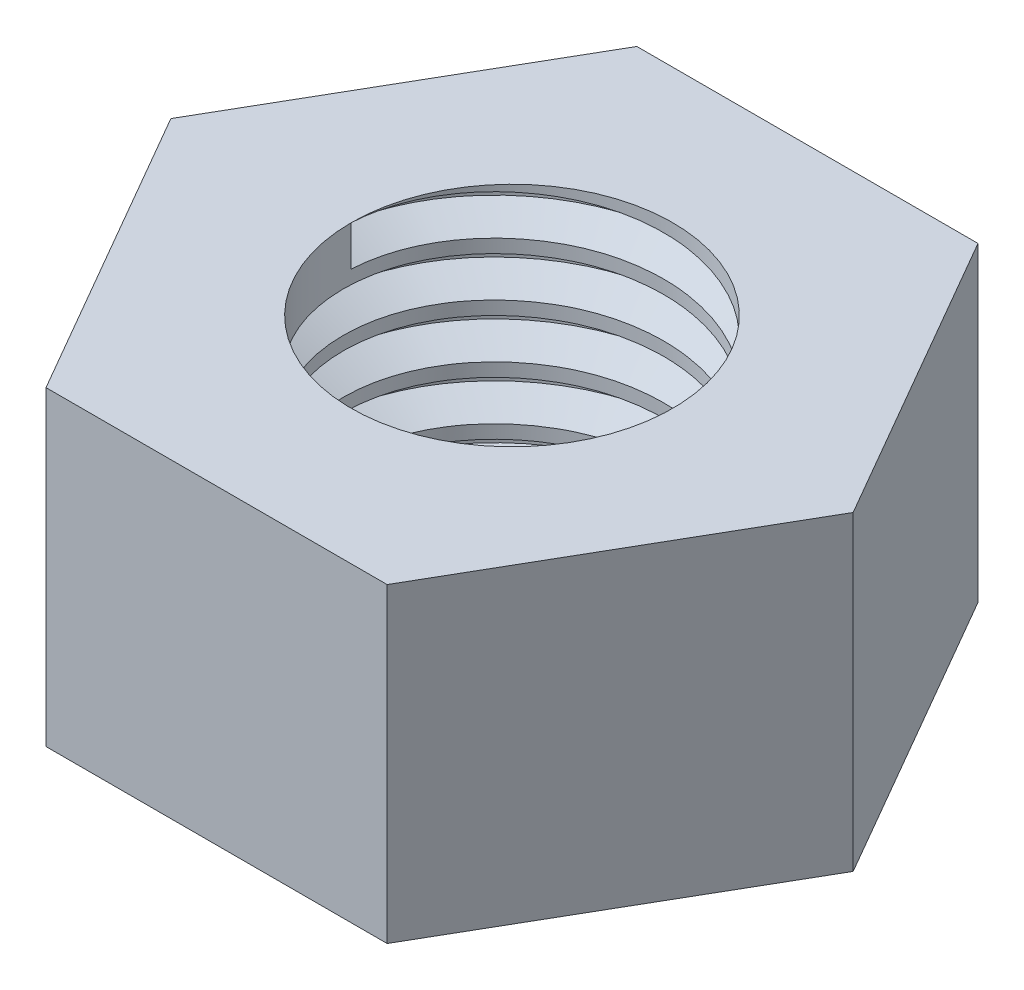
ISO-10303-21;
HEADER;
FILE_DESCRIPTION(('STEP AP214'),'2;1');
FILE_NAME('part.step','',(''),(''),'','','');
FILE_SCHEMA(('AUTOMOTIVE_DESIGN { 1 0 10303 214 1 1 1 1 }'));
ENDSEC;
DATA;
#1=APPLICATION_CONTEXT('core data for automotive mechanical design processes');
#2=APPLICATION_PROTOCOL_DEFINITION('international standard','automotive_design',2000,#1);
#3=PRODUCT_CONTEXT('',#1,'mechanical');
#4=PRODUCT('Part','Part','',(#3));
#5=PRODUCT_RELATED_PRODUCT_CATEGORY('part','',(#4));
#6=PRODUCT_DEFINITION_FORMATION('','',#4);
#7=PRODUCT_DEFINITION_CONTEXT('part definition',#1,'design');
#8=PRODUCT_DEFINITION('design','',#6,#7);
#9=PRODUCT_DEFINITION_SHAPE('','',#8);
#10=(LENGTH_UNIT() NAMED_UNIT(*) SI_UNIT(.MILLI.,.METRE.));
#11=(NAMED_UNIT(*) PLANE_ANGLE_UNIT() SI_UNIT($,.RADIAN.));
#12=(NAMED_UNIT(*) SI_UNIT($,.STERADIAN.) SOLID_ANGLE_UNIT());
#13=UNCERTAINTY_MEASURE_WITH_UNIT(LENGTH_MEASURE(1.E-05),#10,'distance_accuracy_value','');
#14=(GEOMETRIC_REPRESENTATION_CONTEXT(3) GLOBAL_UNCERTAINTY_ASSIGNED_CONTEXT((#13)) GLOBAL_UNIT_ASSIGNED_CONTEXT((#10,
#11,#12)) REPRESENTATION_CONTEXT('',''));
#15=CARTESIAN_POINT('',(0.,0.,0.));
#16=DIRECTION('',(0.,0.,1.));
#17=DIRECTION('',(1.,0.,0.));
#18=AXIS2_PLACEMENT_3D('',#15,#16,#17);
#19=CARTESIAN_POINT('',(0.,0.,0.));
#20=DIRECTION('',(0.,1.,0.));
#21=DIRECTION('',(0.,0.,1.));
#22=AXIS2_PLACEMENT_3D('',#19,#20,#21);
#23=PLANE('',#22);
#24=DIRECTION('',(-0.5,0.,-0.866025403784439));
#25=VECTOR('',#24,1.);
#26=CARTESIAN_POINT('',(3.18223921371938,0.,0.));
#27=LINE('',#26,#25);
#28=CARTESIAN_POINT('',(3.18223921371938,0.,0.));
#29=VERTEX_POINT('',#28);
#30=CARTESIAN_POINT('',(1.59111960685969,0.,-2.7559));
#31=VERTEX_POINT('',#30);
#32=EDGE_CURVE('E149',#29,#31,#27,.T.);
#33=ORIENTED_EDGE('',*,*,#32,.F.);
#34=DIRECTION('',(0.5,0.,-0.866025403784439));
#35=VECTOR('',#34,1.);
#36=CARTESIAN_POINT('',(1.59111960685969,0.,2.7559));
#37=LINE('',#36,#35);
#38=CARTESIAN_POINT('',(1.59111960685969,0.,2.7559));
#39=VERTEX_POINT('',#38);
#40=EDGE_CURVE('E102',#39,#29,#37,.T.);
#41=ORIENTED_EDGE('',*,*,#40,.F.);
#42=DIRECTION('',(1.,0.,0.));
#43=VECTOR('',#42,1.);
#44=CARTESIAN_POINT('',(-1.59111960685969,0.,2.7559));
#45=LINE('',#44,#43);
#46=CARTESIAN_POINT('',(-1.59111960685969,0.,2.7559));
#47=VERTEX_POINT('',#46);
#48=EDGE_CURVE('E158',#47,#39,#45,.T.);
#49=ORIENTED_EDGE('',*,*,#48,.F.);
#50=DIRECTION('',(0.5,0.,0.866025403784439));
#51=VECTOR('',#50,1.);
#52=CARTESIAN_POINT('',(-3.18223921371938,0.,0.));
#53=LINE('',#52,#51);
#54=CARTESIAN_POINT('',(-3.18223921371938,0.,0.));
#55=VERTEX_POINT('',#54);
#56=EDGE_CURVE('E137',#55,#47,#53,.T.);
#57=ORIENTED_EDGE('',*,*,#56,.F.);
#58=DIRECTION('',(-0.5,0.,0.866025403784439));
#59=VECTOR('',#58,1.);
#60=CARTESIAN_POINT('',(-1.59111960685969,0.,-2.7559));
#61=LINE('',#60,#59);
#62=CARTESIAN_POINT('',(-1.59111960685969,0.,-2.7559));
#63=VERTEX_POINT('',#62);
#64=EDGE_CURVE('E155',#63,#55,#61,.T.);
#65=ORIENTED_EDGE('',*,*,#64,.F.);
#66=DIRECTION('',(-1.,0.,0.));
#67=VECTOR('',#66,1.);
#68=CARTESIAN_POINT('',(1.59111960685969,0.,-2.7559));
#69=LINE('',#68,#67);
#70=EDGE_CURVE('E152',#31,#63,#69,.T.);
#71=ORIENTED_EDGE('',*,*,#70,.F.);
#72=EDGE_LOOP('',(#33,#41,#49,#57,#65,#71));
#73=FACE_BOUND('',#72,.T.);
#74=CARTESIAN_POINT('',(1.76429484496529,-1.59626084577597E-12,-0.14968199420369));
#75=CARTESIAN_POINT('',(1.76455304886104,-5.73356310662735E-13,-0.125155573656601));
#76=CARTESIAN_POINT('',(1.76433432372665,-1.5365775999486E-13,-0.100623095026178));
#77=CARTESIAN_POINT('',(1.76291055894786,1.53677753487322E-13,-0.05158380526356));
#78=CARTESIAN_POINT('',(1.76170539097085,0.,-0.0270769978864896));
#79=CARTESIAN_POINT('',(1.75827602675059,0.,0.0218692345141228));
#80=CARTESIAN_POINT('',(1.75605172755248,0.,0.0463086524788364));
#81=CARTESIAN_POINT('',(1.75052691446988,0.,0.095062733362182));
#82=CARTESIAN_POINT('',(1.74722644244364,0.,0.119377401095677));
#83=CARTESIAN_POINT('',(1.73574252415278,0.,0.192051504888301));
#84=CARTESIAN_POINT('',(1.72597438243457,0.,0.240172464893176));
#85=CARTESIAN_POINT('',(1.70228536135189,0.,0.335355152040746));
#86=CARTESIAN_POINT('',(1.68836478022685,0.,0.382416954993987));
#87=CARTESIAN_POINT('',(1.64044979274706,0.,0.521662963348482));
#88=CARTESIAN_POINT('',(1.60031539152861,0.,0.611824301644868));
#89=CARTESIAN_POINT('',(1.50499566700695,0.,0.783659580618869));
#90=CARTESIAN_POINT('',(1.44981858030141,0.,0.865338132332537));
#91=CARTESIAN_POINT('',(1.32832649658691,0.,1.01503297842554));
#92=CARTESIAN_POINT('',(1.26250034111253,0.,1.08344355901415));
#93=CARTESIAN_POINT('',(1.15591665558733,0.,1.17700662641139));
#94=CARTESIAN_POINT('',(1.11905226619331,0.,1.2067034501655));
#95=CARTESIAN_POINT('',(1.04293976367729,0.,1.26290107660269));
#96=CARTESIAN_POINT('',(1.00369127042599,0.,1.28940136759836));
#97=CARTESIAN_POINT('',(0.923013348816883,0.,1.33904871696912));
#98=CARTESIAN_POINT('',(0.881579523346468,0.,1.36218863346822));
#99=CARTESIAN_POINT('',(0.818094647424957,0.,1.39422535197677));
#100=CARTESIAN_POINT('',(0.796710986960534,0.,1.40445860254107));
#101=CARTESIAN_POINT('',(0.753491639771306,0.,1.42392370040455));
#102=CARTESIAN_POINT('',(0.731655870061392,0.,1.43315536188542));
#103=CARTESIAN_POINT('',(0.621616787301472,0.,1.476701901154));
#104=CARTESIAN_POINT('',(0.53024121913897,0.,1.5034588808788));
#105=CARTESIAN_POINT('',(0.349717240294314,0.,1.53864993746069));
#106=CARTESIAN_POINT('',(0.260753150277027,0.,1.54806773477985));
#107=CARTESIAN_POINT('',(0.0824732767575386,0.,1.55136175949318));
#108=CARTESIAN_POINT('',(-0.00684253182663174,0.,1.54523685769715));
#109=CARTESIAN_POINT('',(-0.155890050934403,0.,1.52187819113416));
#110=CARTESIAN_POINT('',(-0.216279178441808,0.,1.50863621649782));
#111=CARTESIAN_POINT('',(-0.334913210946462,0.,1.47503953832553));
#112=CARTESIAN_POINT('',(-0.3931622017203,0.,1.45469925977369));
#113=CARTESIAN_POINT('',(-0.45,0.,1.43090880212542));
#114=B_SPLINE_CURVE_WITH_KNOTS('',3,(#74,#75,#76,#77,#78,#79,#80,#81,#82,#83,#84,#85,#86,#87,
#88,#89,#90,#91,#92,#93,#94,#95,#96,#97,#98,#99,#100,#101,#102,#103,#104,#105,#106,#107,#108,
#109,#110,#111,#112,#113),.UNSPECIFIED.,.F.,.F.,(4,2,2,2,2,2,2,2,2,2,2,2,2,2,2,2,2,2,2,4),(0.,
0.0735800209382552,0.147169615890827,0.220766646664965,0.294360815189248,0.441454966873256,
0.588538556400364,0.882955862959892,1.17721228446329,1.46055799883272,1.60243329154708,
1.74433126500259,1.88652653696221,1.95762210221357,2.0287308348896,2.31251306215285,
2.57963049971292,2.84676734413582,3.03181946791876,3.2164977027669),.UNSPECIFIED.);
#115=CARTESIAN_POINT('',(1.76429484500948,-2.54657694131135E-11,-0.14968199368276));
#116=VERTEX_POINT('',#115);
#117=CARTESIAN_POINT('',(-0.449999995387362,2.56257627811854E-10,1.43090880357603));
#118=VERTEX_POINT('',#117);
#119=EDGE_CURVE('E179',#116,#118,#114,.T.);
#120=ORIENTED_EDGE('',*,*,#119,.F.);
#121=CARTESIAN_POINT('',(1.16244242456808,0.,-1.33561544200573));
#122=CARTESIAN_POINT('',(1.19389189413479,0.,-1.30825388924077));
#123=CARTESIAN_POINT('',(1.22437978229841,0.,-1.27976094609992));
#124=CARTESIAN_POINT('',(1.31341526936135,0.,-1.1904527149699));
#125=CARTESIAN_POINT('',(1.36875808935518,0.,-1.12639293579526));
#126=CARTESIAN_POINT('',(1.46980100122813,0.,-0.990951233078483));
#127=CARTESIAN_POINT('',(1.51548678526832,0.,-0.919558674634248));
#128=CARTESIAN_POINT('',(1.59619650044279,0.,-0.771000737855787));
#129=CARTESIAN_POINT('',(1.63122221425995,0.,-0.69383632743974));
#130=CARTESIAN_POINT('',(1.68987013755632,0.,-0.535354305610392));
#131=CARTESIAN_POINT('',(1.71350524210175,0.,-0.454041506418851));
#132=CARTESIAN_POINT('',(1.73907323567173,0.,-0.334919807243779));
#133=CARTESIAN_POINT('',(1.74576428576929,0.,-0.298077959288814));
#134=CARTESIAN_POINT('',(1.75679277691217,0.,-0.224088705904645));
#135=CARTESIAN_POINT('',(1.76113302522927,0.,-0.186941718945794));
#136=CARTESIAN_POINT('',(1.76429484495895,0.,-0.149681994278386));
#137=B_SPLINE_CURVE_WITH_KNOTS('',3,(#121,#122,#123,#124,#125,#126,#127,#128,#129,#130,#131,
#132,#133,#134,#135,#136),.UNSPECIFIED.,.F.,.F.,(4,2,2,2,2,2,2,4),(0.,0.125078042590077,
0.378123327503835,0.631540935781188,0.884916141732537,1.13800382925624,1.25027499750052,
1.36241179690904),.UNSPECIFIED.);
#138=CARTESIAN_POINT('',(1.16244242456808,0.,-1.33561544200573));
#139=VERTEX_POINT('',#138);
#140=EDGE_CURVE('E12',#139,#116,#137,.T.);
#141=ORIENTED_EDGE('',*,*,#140,.F.);
#142=CARTESIAN_POINT('',(-1.42279219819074,0.,-0.475039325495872));
#143=CARTESIAN_POINT('',(-1.41310059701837,0.,-0.516759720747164));
#144=CARTESIAN_POINT('',(-1.4016527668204,0.,-0.558050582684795));
#145=CARTESIAN_POINT('',(-1.37532139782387,0.,-0.639519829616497));
#146=CARTESIAN_POINT('',(-1.36043800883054,0.,-0.679698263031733));
#147=CARTESIAN_POINT('',(-1.3108125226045,0.,-0.798036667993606));
#148=CARTESIAN_POINT('',(-1.27105680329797,0.,-0.874163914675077));
#149=CARTESIAN_POINT('',(-1.17933926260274,0.,-1.01868240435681));
#150=CARTESIAN_POINT('',(-1.1273674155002,0.,-1.08706722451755));
#151=CARTESIAN_POINT('',(-1.01265650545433,0.,-1.21417183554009));
#152=CARTESIAN_POINT('',(-0.949922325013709,0.,-1.27289598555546));
#153=CARTESIAN_POINT('',(-0.866053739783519,0.,-1.33914492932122));
#154=CARTESIAN_POINT('',(-0.84900382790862,0.,-1.35203947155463));
#155=CARTESIAN_POINT('',(-0.814373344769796,0.,-1.37709385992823));
#156=CARTESIAN_POINT('',(-0.796792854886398,0.,-1.38925381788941));
#157=CARTESIAN_POINT('',(-0.743366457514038,0.,-1.42471220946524));
#158=CARTESIAN_POINT('',(-0.706836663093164,0.,-1.44698834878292));
#159=CARTESIAN_POINT('',(-0.632139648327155,0.,-1.4886877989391));
#160=CARTESIAN_POINT('',(-0.593970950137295,0.,-1.50810846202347));
#161=CARTESIAN_POINT('',(-0.516267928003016,0.,-1.54395564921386));
#162=CARTESIAN_POINT('',(-0.476733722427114,0.,-1.56038243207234));
#163=CARTESIAN_POINT('',(-0.35032117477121,0.,-1.60727339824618));
#164=CARTESIAN_POINT('',(-0.261287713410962,0.,-1.63215254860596));
#165=CARTESIAN_POINT('',(-0.0804598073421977,0.,-1.66685893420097));
#166=CARTESIAN_POINT('',(0.0113328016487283,0.,-1.67669596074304));
#167=CARTESIAN_POINT('',(0.197021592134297,0.,-1.68113448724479));
#168=CARTESIAN_POINT('',(0.290925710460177,0.,-1.67545616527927));
#169=CARTESIAN_POINT('',(0.430011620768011,0.,-1.65521790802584));
#170=CARTESIAN_POINT('',(0.476119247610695,0.,-1.64650522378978));
#171=CARTESIAN_POINT('',(0.567442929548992,0.,-1.62522896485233));
#172=CARTESIAN_POINT('',(0.612659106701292,0.,-1.61266592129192));
#173=CARTESIAN_POINT('',(0.702617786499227,0.,-1.58355310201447));
#174=CARTESIAN_POINT('',(0.74734002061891,0.,-1.5669407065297));
#175=CARTESIAN_POINT('',(0.835189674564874,0.,-1.52990920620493));
#176=CARTESIAN_POINT('',(0.87831662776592,0.,-1.50948899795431));
#177=CARTESIAN_POINT('',(0.962786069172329,0.,-1.46533673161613));
#178=CARTESIAN_POINT('',(1.00413005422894,0.,-1.44160752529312));
#179=CARTESIAN_POINT('',(1.08483793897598,0.,-1.39096330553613));
#180=CARTESIAN_POINT('',(1.12420116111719,0.,-1.3640472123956));
#181=CARTESIAN_POINT('',(1.16244242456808,0.,-1.33561544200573));
#182=B_SPLINE_CURVE_WITH_KNOTS('',3,(#142,#143,#144,#145,#146,#147,#148,#149,#150,#151,#152,
#153,#154,#155,#156,#157,#158,#159,#160,#161,#162,#163,#164,#165,#166,#167,#168,#169,#170,#171,
#172,#173,#174,#175,#176,#177,#178,#179,#180,#181),.UNSPECIFIED.,.F.,.F.,(4,2,2,2,2,2,2,2,2,2,2,
2,2,2,2,2,2,2,2,4),(0.,0.128413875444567,0.256822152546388,0.51313938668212,0.769667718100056,
1.02607997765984,1.09020087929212,1.15431199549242,1.2825381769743,1.41088251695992,
1.53921575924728,1.81515181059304,2.09090817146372,2.37167051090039,2.51230507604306,
2.65292024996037,2.79586577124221,2.93885277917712,3.08171731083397,3.2246303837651),.UNSPECIFIED.);
#183=CARTESIAN_POINT('',(-1.42279219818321,-1.29292704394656E-12,-0.475039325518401));
#184=VERTEX_POINT('',#183);
#185=EDGE_CURVE('E317',#184,#139,#182,.T.);
#186=ORIENTED_EDGE('',*,*,#185,.F.);
#187=CARTESIAN_POINT('',(0.,0.,0.));
#188=DIRECTION('',(0.,1.,0.));
#189=DIRECTION('',(0.,0.,1.));
#190=AXIS2_PLACEMENT_3D('',#187,#188,#189);
#191=CIRCLE('',#190,1.5);
#192=EDGE_CURVE('E173',#184,#118,#191,.T.);
#193=ORIENTED_EDGE('',*,*,#192,.T.);
#194=EDGE_LOOP('',(#120,#141,#186,#193));
#195=FACE_BOUND('',#194,.T.);
#196=ADVANCED_FACE('F43',(#73,#195),#23,.F.);
#197=CARTESIAN_POINT('',(0.,2.9,0.));
#198=DIRECTION('',(0.,-1.,0.));
#199=DIRECTION('',(0.,0.,-1.));
#200=AXIS2_PLACEMENT_3D('',#197,#198,#199);
#201=CYLINDRICAL_SURFACE('',#200,1.5);
#202=CARTESIAN_POINT('',(-0.982501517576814,-0.0295834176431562,1.25797438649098));
#203=CARTESIAN_POINT('',(-0.722994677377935,-0.0151663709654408,1.34228569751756));
#204=CARTESIAN_POINT('',(-0.463487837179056,-0.000749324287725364,1.42659700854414));
#205=CARTESIAN_POINT('',(0.171651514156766,0.0345361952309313,1.63294775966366));
#206=CARTESIAN_POINT('',(0.750000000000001,0.0666666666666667,1.29903810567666));
#207=CARTESIAN_POINT('',(1.5,0.108333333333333,0.866025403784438));
#208=CARTESIAN_POINT('',(1.5,0.15,0.));
#209=CARTESIAN_POINT('',(1.5,0.191666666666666,-0.866025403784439));
#210=CARTESIAN_POINT('',(0.75,0.233333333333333,-1.29903810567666));
#211=CARTESIAN_POINT('',(0.,0.275,-1.73205080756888));
#212=CARTESIAN_POINT('',(-0.75,0.316666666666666,-1.29903810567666));
#213=CARTESIAN_POINT('',(-1.5,0.358333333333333,-0.866025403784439));
#214=CARTESIAN_POINT('',(-1.5,0.4,0.));
#215=CARTESIAN_POINT('',(-1.5,0.441666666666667,0.86602540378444));
#216=CARTESIAN_POINT('',(-0.749999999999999,0.483333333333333,1.29903810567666));
#217=CARTESIAN_POINT('',(0.,0.525,1.73205080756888));
#218=CARTESIAN_POINT('',(0.750000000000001,0.566666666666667,1.29903810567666));
#219=CARTESIAN_POINT('',(1.5,0.608333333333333,0.866025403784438));
#220=CARTESIAN_POINT('',(1.5,0.65,0.));
#221=CARTESIAN_POINT('',(1.5,0.691666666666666,-0.866025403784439));
#222=CARTESIAN_POINT('',(0.75,0.733333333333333,-1.29903810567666));
#223=CARTESIAN_POINT('',(0.,0.775,-1.73205080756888));
#224=CARTESIAN_POINT('',(-0.75,0.816666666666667,-1.29903810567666));
#225=CARTESIAN_POINT('',(-1.5,0.858333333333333,-0.866025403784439));
#226=CARTESIAN_POINT('',(-1.5,0.9,0.));
#227=CARTESIAN_POINT('',(-1.5,0.941666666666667,0.86602540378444));
#228=CARTESIAN_POINT('',(-0.749999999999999,0.983333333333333,1.29903810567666));
#229=CARTESIAN_POINT('',(0.,1.025,1.73205080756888));
#230=CARTESIAN_POINT('',(0.750000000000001,1.06666666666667,1.29903810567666));
#231=CARTESIAN_POINT('',(1.5,1.10833333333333,0.866025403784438));
#232=CARTESIAN_POINT('',(1.5,1.15,0.));
#233=CARTESIAN_POINT('',(1.5,1.19166666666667,-0.866025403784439));
#234=CARTESIAN_POINT('',(0.75,1.23333333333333,-1.29903810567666));
#235=CARTESIAN_POINT('',(0.,1.275,-1.73205080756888));
#236=CARTESIAN_POINT('',(-0.75,1.31666666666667,-1.29903810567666));
#237=CARTESIAN_POINT('',(-1.5,1.35833333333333,-0.866025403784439));
#238=CARTESIAN_POINT('',(-1.5,1.4,0.));
#239=CARTESIAN_POINT('',(-1.5,1.44166666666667,0.86602540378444));
#240=CARTESIAN_POINT('',(-0.749999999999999,1.48333333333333,1.29903810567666));
#241=CARTESIAN_POINT('',(0.,1.525,1.73205080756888));
#242=CARTESIAN_POINT('',(0.750000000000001,1.56666666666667,1.29903810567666));
#243=CARTESIAN_POINT('',(1.5,1.60833333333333,0.866025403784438));
#244=CARTESIAN_POINT('',(1.5,1.65,0.));
#245=CARTESIAN_POINT('',(1.5,1.69166666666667,-0.866025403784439));
#246=CARTESIAN_POINT('',(0.75,1.73333333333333,-1.29903810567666));
#247=CARTESIAN_POINT('',(0.,1.775,-1.73205080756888));
#248=CARTESIAN_POINT('',(-0.75,1.81666666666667,-1.29903810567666));
#249=CARTESIAN_POINT('',(-1.5,1.85833333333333,-0.866025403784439));
#250=CARTESIAN_POINT('',(-1.5,1.9,0.));
#251=CARTESIAN_POINT('',(-1.5,1.94166666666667,0.86602540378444));
#252=CARTESIAN_POINT('',(-0.749999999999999,1.98333333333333,1.29903810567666));
#253=CARTESIAN_POINT('',(0.,2.025,1.73205080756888));
#254=CARTESIAN_POINT('',(0.750000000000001,2.06666666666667,1.29903810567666));
#255=CARTESIAN_POINT('',(1.5,2.10833333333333,0.866025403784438));
#256=CARTESIAN_POINT('',(1.5,2.15,0.));
#257=CARTESIAN_POINT('',(1.5,2.19166666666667,-0.866025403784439));
#258=CARTESIAN_POINT('',(0.75,2.23333333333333,-1.29903810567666));
#259=CARTESIAN_POINT('',(0.,2.275,-1.73205080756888));
#260=CARTESIAN_POINT('',(-0.75,2.31666666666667,-1.29903810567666));
#261=CARTESIAN_POINT('',(-1.5,2.35833333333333,-0.866025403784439));
#262=CARTESIAN_POINT('',(-1.5,2.4,0.));
#263=CARTESIAN_POINT('',(-1.5,2.44166666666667,0.86602540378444));
#264=CARTESIAN_POINT('',(-0.749999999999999,2.48333333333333,1.29903810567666));
#265=CARTESIAN_POINT('',(0.,2.525,1.73205080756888));
#266=CARTESIAN_POINT('',(0.750000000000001,2.56666666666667,1.29903810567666));
#267=CARTESIAN_POINT('',(1.5,2.60833333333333,0.866025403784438));
#268=CARTESIAN_POINT('',(1.5,2.65,0.));
#269=CARTESIAN_POINT('',(1.5,2.69166666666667,-0.866025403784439));
#270=CARTESIAN_POINT('',(0.75,2.73333333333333,-1.29903810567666));
#271=CARTESIAN_POINT('',(0.,2.775,-1.73205080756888));
#272=CARTESIAN_POINT('',(-0.75,2.81666666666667,-1.29903810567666));
#273=CARTESIAN_POINT('',(-1.5,2.85833333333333,-0.866025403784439));
#274=CARTESIAN_POINT('',(-1.5,2.9,0.));
#275=(BOUNDED_CURVE() B_SPLINE_CURVE(2,(#202,#203,#204,#205,#206,#207,#208,#209,#210,#211,#212,
#213,#214,#215,#216,#217,#218,#219,#220,#221,#222,#223,#224,#225,#226,#227,#228,#229,#230,#231,
#232,#233,#234,#235,#236,#237,#238,#239,#240,#241,#242,#243,#244,#245,#246,#247,#248,#249,#250,
#251,#252,#253,#254,#255,#256,#257,#258,#259,#260,#261,#262,#263,#264,#265,#266,#267,#268,#269,
#270,#271,#272,#273,#274),.UNSPECIFIED.,.F.,.F.) B_SPLINE_CURVE_WITH_KNOTS((3,2,2,2,2,2,2,2,2,2,
2,2,2,2,2,2,2,2,2,2,2,2,2,2,2,2,2,2,2,2,2,2,2,2,2,2,3),(0.,0.00966542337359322,
0.0317633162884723,0.0595410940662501,0.0873188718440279,0.115096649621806,0.142874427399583,
0.170652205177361,0.198429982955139,0.226207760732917,0.253985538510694,0.281763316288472,
0.30954109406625,0.337318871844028,0.365096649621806,0.392874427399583,0.420652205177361,
0.448429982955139,0.476207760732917,0.503985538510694,0.531763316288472,0.55954109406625,
0.587318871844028,0.615096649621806,0.642874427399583,0.670652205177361,0.698429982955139,
0.726207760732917,0.753985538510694,0.781763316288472,0.80954109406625,0.837318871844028,
0.865096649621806,0.892874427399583,0.920652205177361,0.948429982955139,0.976207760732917),
.UNSPECIFIED.) CURVE() GEOMETRIC_REPRESENTATION_ITEM() RATIONAL_B_SPLINE_CURVE((0.956413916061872,
0.956413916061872,0.956413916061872,0.893419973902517,1.,0.866025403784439,1.,0.866025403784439,
1.,0.866025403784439,1.,0.866025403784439,1.,0.866025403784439,1.,0.866025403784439,1.,
0.866025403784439,1.,0.866025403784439,1.,0.866025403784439,1.,0.866025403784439,1.,
0.866025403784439,1.,0.866025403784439,1.,0.866025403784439,1.,0.866025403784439,1.,
0.866025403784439,1.,0.866025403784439,1.,0.866025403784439,1.,0.866025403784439,1.,
0.866025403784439,1.,0.866025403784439,1.,0.866025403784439,1.,0.866025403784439,1.,
0.866025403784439,1.,0.866025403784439,1.,0.866025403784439,1.,0.866025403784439,1.,
0.866025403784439,1.,0.866025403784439,1.,0.866025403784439,1.,0.866025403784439,1.,
0.866025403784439,1.,0.866025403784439,1.,0.866025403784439,1.,0.866025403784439,1.)) REPRESENTATION_ITEM(''));
#276=CARTESIAN_POINT('',(0.,0.775,-1.5));
#277=VERTEX_POINT('',#276);
#278=CARTESIAN_POINT('',(0.,0.275000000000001,-1.5));
#279=VERTEX_POINT('',#278);
#280=EDGE_CURVE('E416',#277,#279,#275,.F.);
#281=ORIENTED_EDGE('',*,*,#280,.T.);
#282=CARTESIAN_POINT('',(-0.982501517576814,-0.0295834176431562,1.25797438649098));
#283=CARTESIAN_POINT('',(-0.722994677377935,-0.0151663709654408,1.34228569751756));
#284=CARTESIAN_POINT('',(-0.463487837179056,-0.000749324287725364,1.42659700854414));
#285=CARTESIAN_POINT('',(0.171651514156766,0.0345361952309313,1.63294775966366));
#286=CARTESIAN_POINT('',(0.750000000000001,0.0666666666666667,1.29903810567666));
#287=CARTESIAN_POINT('',(1.5,0.108333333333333,0.866025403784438));
#288=CARTESIAN_POINT('',(1.5,0.15,0.));
#289=CARTESIAN_POINT('',(1.5,0.191666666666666,-0.866025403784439));
#290=CARTESIAN_POINT('',(0.75,0.233333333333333,-1.29903810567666));
#291=CARTESIAN_POINT('',(0.,0.275,-1.73205080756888));
#292=CARTESIAN_POINT('',(-0.75,0.316666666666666,-1.29903810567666));
#293=CARTESIAN_POINT('',(-1.5,0.358333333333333,-0.866025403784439));
#294=CARTESIAN_POINT('',(-1.5,0.4,0.));
#295=CARTESIAN_POINT('',(-1.5,0.441666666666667,0.86602540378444));
#296=CARTESIAN_POINT('',(-0.749999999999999,0.483333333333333,1.29903810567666));
#297=CARTESIAN_POINT('',(0.,0.525,1.73205080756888));
#298=CARTESIAN_POINT('',(0.750000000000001,0.566666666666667,1.29903810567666));
#299=CARTESIAN_POINT('',(1.5,0.608333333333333,0.866025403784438));
#300=CARTESIAN_POINT('',(1.5,0.65,0.));
#301=CARTESIAN_POINT('',(1.5,0.691666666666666,-0.866025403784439));
#302=CARTESIAN_POINT('',(0.75,0.733333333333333,-1.29903810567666));
#303=CARTESIAN_POINT('',(0.,0.775,-1.73205080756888));
#304=CARTESIAN_POINT('',(-0.75,0.816666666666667,-1.29903810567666));
#305=CARTESIAN_POINT('',(-1.5,0.858333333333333,-0.866025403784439));
#306=CARTESIAN_POINT('',(-1.5,0.9,0.));
#307=CARTESIAN_POINT('',(-1.5,0.941666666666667,0.86602540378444));
#308=CARTESIAN_POINT('',(-0.749999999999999,0.983333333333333,1.29903810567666));
#309=CARTESIAN_POINT('',(0.,1.025,1.73205080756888));
#310=CARTESIAN_POINT('',(0.750000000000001,1.06666666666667,1.29903810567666));
#311=CARTESIAN_POINT('',(1.5,1.10833333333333,0.866025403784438));
#312=CARTESIAN_POINT('',(1.5,1.15,0.));
#313=CARTESIAN_POINT('',(1.5,1.19166666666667,-0.866025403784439));
#314=CARTESIAN_POINT('',(0.75,1.23333333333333,-1.29903810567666));
#315=CARTESIAN_POINT('',(0.,1.275,-1.73205080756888));
#316=CARTESIAN_POINT('',(-0.75,1.31666666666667,-1.29903810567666));
#317=CARTESIAN_POINT('',(-1.5,1.35833333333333,-0.866025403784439));
#318=CARTESIAN_POINT('',(-1.5,1.4,0.));
#319=CARTESIAN_POINT('',(-1.5,1.44166666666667,0.86602540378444));
#320=CARTESIAN_POINT('',(-0.749999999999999,1.48333333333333,1.29903810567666));
#321=CARTESIAN_POINT('',(0.,1.525,1.73205080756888));
#322=CARTESIAN_POINT('',(0.750000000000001,1.56666666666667,1.29903810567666));
#323=CARTESIAN_POINT('',(1.5,1.60833333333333,0.866025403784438));
#324=CARTESIAN_POINT('',(1.5,1.65,0.));
#325=CARTESIAN_POINT('',(1.5,1.69166666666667,-0.866025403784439));
#326=CARTESIAN_POINT('',(0.75,1.73333333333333,-1.29903810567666));
#327=CARTESIAN_POINT('',(0.,1.775,-1.73205080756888));
#328=CARTESIAN_POINT('',(-0.75,1.81666666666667,-1.29903810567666));
#329=CARTESIAN_POINT('',(-1.5,1.85833333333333,-0.866025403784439));
#330=CARTESIAN_POINT('',(-1.5,1.9,0.));
#331=CARTESIAN_POINT('',(-1.5,1.94166666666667,0.86602540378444));
#332=CARTESIAN_POINT('',(-0.749999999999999,1.98333333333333,1.29903810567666));
#333=CARTESIAN_POINT('',(0.,2.025,1.73205080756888));
#334=CARTESIAN_POINT('',(0.750000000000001,2.06666666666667,1.29903810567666));
#335=CARTESIAN_POINT('',(1.5,2.10833333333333,0.866025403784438));
#336=CARTESIAN_POINT('',(1.5,2.15,0.));
#337=CARTESIAN_POINT('',(1.5,2.19166666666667,-0.866025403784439));
#338=CARTESIAN_POINT('',(0.75,2.23333333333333,-1.29903810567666));
#339=CARTESIAN_POINT('',(0.,2.275,-1.73205080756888));
#340=CARTESIAN_POINT('',(-0.75,2.31666666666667,-1.29903810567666));
#341=CARTESIAN_POINT('',(-1.5,2.35833333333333,-0.866025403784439));
#342=CARTESIAN_POINT('',(-1.5,2.4,0.));
#343=CARTESIAN_POINT('',(-1.5,2.44166666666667,0.86602540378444));
#344=CARTESIAN_POINT('',(-0.749999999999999,2.48333333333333,1.29903810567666));
#345=CARTESIAN_POINT('',(0.,2.525,1.73205080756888));
#346=CARTESIAN_POINT('',(0.750000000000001,2.56666666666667,1.29903810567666));
#347=CARTESIAN_POINT('',(1.5,2.60833333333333,0.866025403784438));
#348=CARTESIAN_POINT('',(1.5,2.65,0.));
#349=CARTESIAN_POINT('',(1.5,2.69166666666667,-0.866025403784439));
#350=CARTESIAN_POINT('',(0.75,2.73333333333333,-1.29903810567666));
#351=CARTESIAN_POINT('',(0.,2.775,-1.73205080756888));
#352=CARTESIAN_POINT('',(-0.75,2.81666666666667,-1.29903810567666));
#353=CARTESIAN_POINT('',(-1.5,2.85833333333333,-0.866025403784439));
#354=CARTESIAN_POINT('',(-1.5,2.9,0.));
#355=(BOUNDED_CURVE() B_SPLINE_CURVE(2,(#282,#283,#284,#285,#286,#287,#288,#289,#290,#291,#292,
#293,#294,#295,#296,#297,#298,#299,#300,#301,#302,#303,#304,#305,#306,#307,#308,#309,#310,#311,
#312,#313,#314,#315,#316,#317,#318,#319,#320,#321,#322,#323,#324,#325,#326,#327,#328,#329,#330,
#331,#332,#333,#334,#335,#336,#337,#338,#339,#340,#341,#342,#343,#344,#345,#346,#347,#348,#349,
#350,#351,#352,#353,#354),.UNSPECIFIED.,.F.,.F.) B_SPLINE_CURVE_WITH_KNOTS((3,2,2,2,2,2,2,2,2,2,
2,2,2,2,2,2,2,2,2,2,2,2,2,2,2,2,2,2,2,2,2,2,2,2,2,2,3),(0.,0.00966542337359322,
0.0317633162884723,0.0595410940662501,0.0873188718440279,0.115096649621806,0.142874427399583,
0.170652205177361,0.198429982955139,0.226207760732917,0.253985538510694,0.281763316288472,
0.30954109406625,0.337318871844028,0.365096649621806,0.392874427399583,0.420652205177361,
0.448429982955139,0.476207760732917,0.503985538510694,0.531763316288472,0.55954109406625,
0.587318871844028,0.615096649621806,0.642874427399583,0.670652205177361,0.698429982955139,
0.726207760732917,0.753985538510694,0.781763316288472,0.80954109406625,0.837318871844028,
0.865096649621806,0.892874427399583,0.920652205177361,0.948429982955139,0.976207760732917),
.UNSPECIFIED.) CURVE() GEOMETRIC_REPRESENTATION_ITEM() RATIONAL_B_SPLINE_CURVE((0.956413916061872,
0.956413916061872,0.956413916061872,0.893419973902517,1.,0.866025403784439,1.,0.866025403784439,
1.,0.866025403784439,1.,0.866025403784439,1.,0.866025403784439,1.,0.866025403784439,1.,
0.866025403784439,1.,0.866025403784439,1.,0.866025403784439,1.,0.866025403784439,1.,
0.866025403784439,1.,0.866025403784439,1.,0.866025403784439,1.,0.866025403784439,1.,
0.866025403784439,1.,0.866025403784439,1.,0.866025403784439,1.,0.866025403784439,1.,
0.866025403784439,1.,0.866025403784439,1.,0.866025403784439,1.,0.866025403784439,1.,
0.866025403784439,1.,0.866025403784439,1.,0.866025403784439,1.,0.866025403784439,1.,
0.866025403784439,1.,0.866025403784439,1.,0.866025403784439,1.,0.866025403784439,1.,
0.866025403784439,1.,0.866025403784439,1.,0.866025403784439,1.,0.866025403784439,1.)) REPRESENTATION_ITEM(''));
#356=EDGE_CURVE('E58',#279,#118,#355,.F.);
#357=ORIENTED_EDGE('',*,*,#356,.T.);
#358=ORIENTED_EDGE('',*,*,#192,.F.);
#359=CARTESIAN_POINT('',(-1.5,2.52500000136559,0.));
#360=CARTESIAN_POINT('',(-1.5,2.48333333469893,-0.866025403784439));
#361=CARTESIAN_POINT('',(-0.75,2.44166666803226,-1.29903810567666));
#362=CARTESIAN_POINT('',(0.,2.40000000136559,-1.73205080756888));
#363=CARTESIAN_POINT('',(0.75,2.35833333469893,-1.29903810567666));
#364=CARTESIAN_POINT('',(1.5,2.31666666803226,-0.866025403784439));
#365=CARTESIAN_POINT('',(1.5,2.27500000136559,0.));
#366=CARTESIAN_POINT('',(1.5,2.23333333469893,0.866025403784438));
#367=CARTESIAN_POINT('',(0.750000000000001,2.19166666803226,1.29903810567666));
#368=CARTESIAN_POINT('',(0.,2.15000000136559,1.73205080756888));
#369=CARTESIAN_POINT('',(-0.749999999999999,2.10833333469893,1.29903810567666));
#370=CARTESIAN_POINT('',(-1.5,2.06666666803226,0.86602540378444));
#371=CARTESIAN_POINT('',(-1.5,2.02500000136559,0.));
#372=CARTESIAN_POINT('',(-1.5,1.98333333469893,-0.866025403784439));
#373=CARTESIAN_POINT('',(-0.75,1.94166666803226,-1.29903810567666));
#374=CARTESIAN_POINT('',(0.,1.90000000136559,-1.73205080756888));
#375=CARTESIAN_POINT('',(0.75,1.85833333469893,-1.29903810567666));
#376=CARTESIAN_POINT('',(1.5,1.81666666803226,-0.866025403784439));
#377=CARTESIAN_POINT('',(1.5,1.77500000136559,0.));
#378=CARTESIAN_POINT('',(1.5,1.73333333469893,0.866025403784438));
#379=CARTESIAN_POINT('',(0.750000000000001,1.69166666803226,1.29903810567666));
#380=CARTESIAN_POINT('',(0.,1.65000000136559,1.73205080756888));
#381=CARTESIAN_POINT('',(-0.749999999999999,1.60833333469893,1.29903810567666));
#382=CARTESIAN_POINT('',(-1.5,1.56666666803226,0.86602540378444));
#383=CARTESIAN_POINT('',(-1.5,1.52500000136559,0.));
#384=CARTESIAN_POINT('',(-1.5,1.48333333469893,-0.866025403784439));
#385=CARTESIAN_POINT('',(-0.75,1.44166666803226,-1.29903810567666));
#386=CARTESIAN_POINT('',(0.,1.40000000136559,-1.73205080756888));
#387=CARTESIAN_POINT('',(0.75,1.35833333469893,-1.29903810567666));
#388=CARTESIAN_POINT('',(1.5,1.31666666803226,-0.866025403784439));
#389=CARTESIAN_POINT('',(1.5,1.27500000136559,0.));
#390=CARTESIAN_POINT('',(1.5,1.23333333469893,0.866025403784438));
#391=CARTESIAN_POINT('',(0.750000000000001,1.19166666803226,1.29903810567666));
#392=CARTESIAN_POINT('',(0.,1.15000000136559,1.73205080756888));
#393=CARTESIAN_POINT('',(-0.749999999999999,1.10833333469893,1.29903810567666));
#394=CARTESIAN_POINT('',(-1.5,1.06666666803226,0.86602540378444));
#395=CARTESIAN_POINT('',(-1.5,1.02500000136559,0.));
#396=CARTESIAN_POINT('',(-1.5,0.983333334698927,-0.866025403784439));
#397=CARTESIAN_POINT('',(-0.75,0.94166666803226,-1.29903810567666));
#398=CARTESIAN_POINT('',(0.,0.900000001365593,-1.73205080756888));
#399=CARTESIAN_POINT('',(0.75,0.858333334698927,-1.29903810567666));
#400=CARTESIAN_POINT('',(1.5,0.81666666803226,-0.866025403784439));
#401=CARTESIAN_POINT('',(1.5,0.775000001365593,0.));
#402=CARTESIAN_POINT('',(1.5,0.733333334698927,0.866025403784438));
#403=CARTESIAN_POINT('',(0.750000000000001,0.69166666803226,1.29903810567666));
#404=CARTESIAN_POINT('',(0.,0.650000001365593,1.73205080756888));
#405=CARTESIAN_POINT('',(-0.749999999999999,0.608333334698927,1.29903810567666));
#406=CARTESIAN_POINT('',(-1.5,0.56666666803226,0.86602540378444));
#407=CARTESIAN_POINT('',(-1.5,0.525000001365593,0.));
#408=CARTESIAN_POINT('',(-1.5,0.483333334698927,-0.866025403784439));
#409=CARTESIAN_POINT('',(-0.75,0.44166666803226,-1.29903810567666));
#410=CARTESIAN_POINT('',(0.,0.400000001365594,-1.73205080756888));
#411=CARTESIAN_POINT('',(0.75,0.358333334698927,-1.29903810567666));
#412=CARTESIAN_POINT('',(1.5,0.31666666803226,-0.866025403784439));
#413=CARTESIAN_POINT('',(1.5,0.275000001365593,0.));
#414=CARTESIAN_POINT('',(1.5,0.233333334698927,0.866025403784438));
#415=CARTESIAN_POINT('',(0.750000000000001,0.19166666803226,1.29903810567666));
#416=CARTESIAN_POINT('',(0.,0.150000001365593,1.73205080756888));
#417=CARTESIAN_POINT('',(-0.749999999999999,0.108333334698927,1.29903810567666));
#418=CARTESIAN_POINT('',(-1.5,0.0666666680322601,0.86602540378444));
#419=CARTESIAN_POINT('',(-1.5,0.0250000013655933,0.));
#420=CARTESIAN_POINT('',(-1.5,-0.0166666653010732,-0.866025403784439));
#421=CARTESIAN_POINT('',(-0.75,-0.05833333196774,-1.29903810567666));
#422=CARTESIAN_POINT('',(0.,-0.0999999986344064,-1.73205080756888));
#423=CARTESIAN_POINT('',(0.75,-0.141666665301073,-1.29903810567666));
#424=CARTESIAN_POINT('',(1.5,-0.18333333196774,-0.866025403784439));
#425=CARTESIAN_POINT('',(1.5,-0.224999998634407,0.));
#426=CARTESIAN_POINT('',(1.5,-0.266666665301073,0.866025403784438));
#427=CARTESIAN_POINT('',(0.750000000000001,-0.30833333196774,1.29903810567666));
#428=CARTESIAN_POINT('',(0.171645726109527,-0.340464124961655,1.63295110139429));
#429=CARTESIAN_POINT('',(-0.463498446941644,-0.375749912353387,1.42659356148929));
#430=(BOUNDED_CURVE() B_SPLINE_CURVE(2,(#359,#360,#361,#362,#363,#364,#365,#366,#367,#368,#369,
#370,#371,#372,#373,#374,#375,#376,#377,#378,#379,#380,#381,#382,#383,#384,#385,#386,#387,#388,
#389,#390,#391,#392,#393,#394,#395,#396,#397,#398,#399,#400,#401,#402,#403,#404,#405,#406,#407,
#408,#409,#410,#411,#412,#413,#414,#415,#416,#417,#418,#419,#420,#421,#422,#423,#424,#425,#426,
#427,#428,#429),.UNSPECIFIED.,.F.,.F.) B_SPLINE_CURVE_WITH_KNOTS((3,2,2,2,2,2,2,2,2,2,2,2,2,2,2,
2,2,2,2,2,2,2,2,2,2,2,2,2,2,2,2,2,2,2,2,3),(0.,0.0277777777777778,0.0555555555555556,
0.0833333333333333,0.111111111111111,0.138888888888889,0.166666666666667,0.194444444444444,
0.222222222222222,0.25,0.277777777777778,0.305555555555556,0.333333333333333,0.361111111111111,
0.388888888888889,0.416666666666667,0.444444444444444,0.472222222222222,0.5,0.527777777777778,
0.555555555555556,0.583333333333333,0.611111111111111,0.638888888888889,0.666666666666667,
0.694444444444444,0.722222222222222,0.75,0.777777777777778,0.805555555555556,0.833333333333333,
0.861111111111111,0.888888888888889,0.916666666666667,0.944444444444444,0.966542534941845),
.UNSPECIFIED.) CURVE() GEOMETRIC_REPRESENTATION_ITEM() RATIONAL_B_SPLINE_CURVE((1.,
0.866025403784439,1.,0.866025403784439,1.,0.866025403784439,1.,0.866025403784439,1.,
0.866025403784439,1.,0.866025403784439,1.,0.866025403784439,1.,0.866025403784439,1.,
0.866025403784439,1.,0.866025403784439,1.,0.866025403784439,1.,0.866025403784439,1.,
0.866025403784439,1.,0.866025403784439,1.,0.866025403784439,1.,0.866025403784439,1.,
0.866025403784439,1.,0.866025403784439,1.,0.866025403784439,1.,0.866025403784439,1.,
0.866025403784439,1.,0.866025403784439,1.,0.866025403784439,1.,0.866025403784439,1.,
0.866025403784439,1.,0.866025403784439,1.,0.866025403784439,1.,0.866025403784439,1.,
0.866025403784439,1.,0.866025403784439,1.,0.866025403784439,1.,0.866025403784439,1.,
0.866025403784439,1.,0.866025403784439,1.,0.893419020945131,0.956415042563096)) REPRESENTATION_ITEM(''));
#431=CARTESIAN_POINT('',(0.,0.400000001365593,-1.5));
#432=VERTEX_POINT('',#431);
#433=EDGE_CURVE('E170',#184,#432,#430,.F.);
#434=ORIENTED_EDGE('',*,*,#433,.T.);
#435=CARTESIAN_POINT('',(-1.5,2.52500000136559,0.));
#436=CARTESIAN_POINT('',(-1.5,2.48333333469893,-0.866025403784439));
#437=CARTESIAN_POINT('',(-0.75,2.44166666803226,-1.29903810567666));
#438=CARTESIAN_POINT('',(0.,2.40000000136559,-1.73205080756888));
#439=CARTESIAN_POINT('',(0.75,2.35833333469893,-1.29903810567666));
#440=CARTESIAN_POINT('',(1.5,2.31666666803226,-0.866025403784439));
#441=CARTESIAN_POINT('',(1.5,2.27500000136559,0.));
#442=CARTESIAN_POINT('',(1.5,2.23333333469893,0.866025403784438));
#443=CARTESIAN_POINT('',(0.750000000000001,2.19166666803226,1.29903810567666));
#444=CARTESIAN_POINT('',(0.,2.15000000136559,1.73205080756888));
#445=CARTESIAN_POINT('',(-0.749999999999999,2.10833333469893,1.29903810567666));
#446=CARTESIAN_POINT('',(-1.5,2.06666666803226,0.86602540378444));
#447=CARTESIAN_POINT('',(-1.5,2.02500000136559,0.));
#448=CARTESIAN_POINT('',(-1.5,1.98333333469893,-0.866025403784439));
#449=CARTESIAN_POINT('',(-0.75,1.94166666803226,-1.29903810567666));
#450=CARTESIAN_POINT('',(0.,1.90000000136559,-1.73205080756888));
#451=CARTESIAN_POINT('',(0.75,1.85833333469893,-1.29903810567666));
#452=CARTESIAN_POINT('',(1.5,1.81666666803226,-0.866025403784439));
#453=CARTESIAN_POINT('',(1.5,1.77500000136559,0.));
#454=CARTESIAN_POINT('',(1.5,1.73333333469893,0.866025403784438));
#455=CARTESIAN_POINT('',(0.750000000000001,1.69166666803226,1.29903810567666));
#456=CARTESIAN_POINT('',(0.,1.65000000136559,1.73205080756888));
#457=CARTESIAN_POINT('',(-0.749999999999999,1.60833333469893,1.29903810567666));
#458=CARTESIAN_POINT('',(-1.5,1.56666666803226,0.86602540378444));
#459=CARTESIAN_POINT('',(-1.5,1.52500000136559,0.));
#460=CARTESIAN_POINT('',(-1.5,1.48333333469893,-0.866025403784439));
#461=CARTESIAN_POINT('',(-0.75,1.44166666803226,-1.29903810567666));
#462=CARTESIAN_POINT('',(0.,1.40000000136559,-1.73205080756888));
#463=CARTESIAN_POINT('',(0.75,1.35833333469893,-1.29903810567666));
#464=CARTESIAN_POINT('',(1.5,1.31666666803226,-0.866025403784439));
#465=CARTESIAN_POINT('',(1.5,1.27500000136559,0.));
#466=CARTESIAN_POINT('',(1.5,1.23333333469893,0.866025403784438));
#467=CARTESIAN_POINT('',(0.750000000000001,1.19166666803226,1.29903810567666));
#468=CARTESIAN_POINT('',(0.,1.15000000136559,1.73205080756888));
#469=CARTESIAN_POINT('',(-0.749999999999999,1.10833333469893,1.29903810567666));
#470=CARTESIAN_POINT('',(-1.5,1.06666666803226,0.86602540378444));
#471=CARTESIAN_POINT('',(-1.5,1.02500000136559,0.));
#472=CARTESIAN_POINT('',(-1.5,0.983333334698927,-0.866025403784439));
#473=CARTESIAN_POINT('',(-0.75,0.94166666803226,-1.29903810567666));
#474=CARTESIAN_POINT('',(0.,0.900000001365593,-1.73205080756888));
#475=CARTESIAN_POINT('',(0.75,0.858333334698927,-1.29903810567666));
#476=CARTESIAN_POINT('',(1.5,0.81666666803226,-0.866025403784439));
#477=CARTESIAN_POINT('',(1.5,0.775000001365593,0.));
#478=CARTESIAN_POINT('',(1.5,0.733333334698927,0.866025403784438));
#479=CARTESIAN_POINT('',(0.750000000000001,0.69166666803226,1.29903810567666));
#480=CARTESIAN_POINT('',(0.,0.650000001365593,1.73205080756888));
#481=CARTESIAN_POINT('',(-0.749999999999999,0.608333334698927,1.29903810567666));
#482=CARTESIAN_POINT('',(-1.5,0.56666666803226,0.86602540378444));
#483=CARTESIAN_POINT('',(-1.5,0.525000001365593,0.));
#484=CARTESIAN_POINT('',(-1.5,0.483333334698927,-0.866025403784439));
#485=CARTESIAN_POINT('',(-0.75,0.44166666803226,-1.29903810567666));
#486=CARTESIAN_POINT('',(0.,0.400000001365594,-1.73205080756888));
#487=CARTESIAN_POINT('',(0.75,0.358333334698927,-1.29903810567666));
#488=CARTESIAN_POINT('',(1.5,0.31666666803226,-0.866025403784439));
#489=CARTESIAN_POINT('',(1.5,0.275000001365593,0.));
#490=CARTESIAN_POINT('',(1.5,0.233333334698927,0.866025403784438));
#491=CARTESIAN_POINT('',(0.750000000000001,0.19166666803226,1.29903810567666));
#492=CARTESIAN_POINT('',(0.,0.150000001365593,1.73205080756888));
#493=CARTESIAN_POINT('',(-0.749999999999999,0.108333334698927,1.29903810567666));
#494=CARTESIAN_POINT('',(-1.5,0.0666666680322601,0.86602540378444));
#495=CARTESIAN_POINT('',(-1.5,0.0250000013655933,0.));
#496=CARTESIAN_POINT('',(-1.5,-0.0166666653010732,-0.866025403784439));
#497=CARTESIAN_POINT('',(-0.75,-0.05833333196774,-1.29903810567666));
#498=CARTESIAN_POINT('',(0.,-0.0999999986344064,-1.73205080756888));
#499=CARTESIAN_POINT('',(0.75,-0.141666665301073,-1.29903810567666));
#500=CARTESIAN_POINT('',(1.5,-0.18333333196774,-0.866025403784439));
#501=CARTESIAN_POINT('',(1.5,-0.224999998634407,0.));
#502=CARTESIAN_POINT('',(1.5,-0.266666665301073,0.866025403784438));
#503=CARTESIAN_POINT('',(0.750000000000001,-0.30833333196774,1.29903810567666));
#504=CARTESIAN_POINT('',(0.171645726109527,-0.340464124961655,1.63295110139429));
#505=CARTESIAN_POINT('',(-0.463498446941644,-0.375749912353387,1.42659356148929));
#506=(BOUNDED_CURVE() B_SPLINE_CURVE(2,(#435,#436,#437,#438,#439,#440,#441,#442,#443,#444,#445,
#446,#447,#448,#449,#450,#451,#452,#453,#454,#455,#456,#457,#458,#459,#460,#461,#462,#463,#464,
#465,#466,#467,#468,#469,#470,#471,#472,#473,#474,#475,#476,#477,#478,#479,#480,#481,#482,#483,
#484,#485,#486,#487,#488,#489,#490,#491,#492,#493,#494,#495,#496,#497,#498,#499,#500,#501,#502,
#503,#504,#505),.UNSPECIFIED.,.F.,.F.) B_SPLINE_CURVE_WITH_KNOTS((3,2,2,2,2,2,2,2,2,2,2,2,2,2,2,
2,2,2,2,2,2,2,2,2,2,2,2,2,2,2,2,2,2,2,2,3),(0.,0.0277777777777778,0.0555555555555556,
0.0833333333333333,0.111111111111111,0.138888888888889,0.166666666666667,0.194444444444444,
0.222222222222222,0.25,0.277777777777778,0.305555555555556,0.333333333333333,0.361111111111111,
0.388888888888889,0.416666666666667,0.444444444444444,0.472222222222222,0.5,0.527777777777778,
0.555555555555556,0.583333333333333,0.611111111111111,0.638888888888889,0.666666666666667,
0.694444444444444,0.722222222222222,0.75,0.777777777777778,0.805555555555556,0.833333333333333,
0.861111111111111,0.888888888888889,0.916666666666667,0.944444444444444,0.966542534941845),
.UNSPECIFIED.) CURVE() GEOMETRIC_REPRESENTATION_ITEM() RATIONAL_B_SPLINE_CURVE((1.,
0.866025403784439,1.,0.866025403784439,1.,0.866025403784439,1.,0.866025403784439,1.,
0.866025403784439,1.,0.866025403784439,1.,0.866025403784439,1.,0.866025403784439,1.,
0.866025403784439,1.,0.866025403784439,1.,0.866025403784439,1.,0.866025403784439,1.,
0.866025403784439,1.,0.866025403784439,1.,0.866025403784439,1.,0.866025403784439,1.,
0.866025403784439,1.,0.866025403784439,1.,0.866025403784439,1.,0.866025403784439,1.,
0.866025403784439,1.,0.866025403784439,1.,0.866025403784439,1.,0.866025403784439,1.,
0.866025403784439,1.,0.866025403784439,1.,0.866025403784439,1.,0.866025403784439,1.,
0.866025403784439,1.,0.866025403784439,1.,0.866025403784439,1.,0.866025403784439,1.,
0.866025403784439,1.,0.866025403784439,1.,0.893419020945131,0.956415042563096)) REPRESENTATION_ITEM(''));
#507=CARTESIAN_POINT('',(0.,0.900000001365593,-1.5));
#508=VERTEX_POINT('',#507);
#509=EDGE_CURVE('E66',#432,#508,#506,.F.);
#510=ORIENTED_EDGE('',*,*,#509,.T.);
#511=CARTESIAN_POINT('',(-1.5,2.52500000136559,0.));
#512=CARTESIAN_POINT('',(-1.5,2.48333333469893,-0.866025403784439));
#513=CARTESIAN_POINT('',(-0.75,2.44166666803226,-1.29903810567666));
#514=CARTESIAN_POINT('',(0.,2.40000000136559,-1.73205080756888));
#515=CARTESIAN_POINT('',(0.75,2.35833333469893,-1.29903810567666));
#516=CARTESIAN_POINT('',(1.5,2.31666666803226,-0.866025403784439));
#517=CARTESIAN_POINT('',(1.5,2.27500000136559,0.));
#518=CARTESIAN_POINT('',(1.5,2.23333333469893,0.866025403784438));
#519=CARTESIAN_POINT('',(0.750000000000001,2.19166666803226,1.29903810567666));
#520=CARTESIAN_POINT('',(0.,2.15000000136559,1.73205080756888));
#521=CARTESIAN_POINT('',(-0.749999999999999,2.10833333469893,1.29903810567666));
#522=CARTESIAN_POINT('',(-1.5,2.06666666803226,0.86602540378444));
#523=CARTESIAN_POINT('',(-1.5,2.02500000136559,0.));
#524=CARTESIAN_POINT('',(-1.5,1.98333333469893,-0.866025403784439));
#525=CARTESIAN_POINT('',(-0.75,1.94166666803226,-1.29903810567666));
#526=CARTESIAN_POINT('',(0.,1.90000000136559,-1.73205080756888));
#527=CARTESIAN_POINT('',(0.75,1.85833333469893,-1.29903810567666));
#528=CARTESIAN_POINT('',(1.5,1.81666666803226,-0.866025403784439));
#529=CARTESIAN_POINT('',(1.5,1.77500000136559,0.));
#530=CARTESIAN_POINT('',(1.5,1.73333333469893,0.866025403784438));
#531=CARTESIAN_POINT('',(0.750000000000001,1.69166666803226,1.29903810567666));
#532=CARTESIAN_POINT('',(0.,1.65000000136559,1.73205080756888));
#533=CARTESIAN_POINT('',(-0.749999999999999,1.60833333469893,1.29903810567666));
#534=CARTESIAN_POINT('',(-1.5,1.56666666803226,0.86602540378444));
#535=CARTESIAN_POINT('',(-1.5,1.52500000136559,0.));
#536=CARTESIAN_POINT('',(-1.5,1.48333333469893,-0.866025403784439));
#537=CARTESIAN_POINT('',(-0.75,1.44166666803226,-1.29903810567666));
#538=CARTESIAN_POINT('',(0.,1.40000000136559,-1.73205080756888));
#539=CARTESIAN_POINT('',(0.75,1.35833333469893,-1.29903810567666));
#540=CARTESIAN_POINT('',(1.5,1.31666666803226,-0.866025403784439));
#541=CARTESIAN_POINT('',(1.5,1.27500000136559,0.));
#542=CARTESIAN_POINT('',(1.5,1.23333333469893,0.866025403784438));
#543=CARTESIAN_POINT('',(0.750000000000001,1.19166666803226,1.29903810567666));
#544=CARTESIAN_POINT('',(0.,1.15000000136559,1.73205080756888));
#545=CARTESIAN_POINT('',(-0.749999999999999,1.10833333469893,1.29903810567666));
#546=CARTESIAN_POINT('',(-1.5,1.06666666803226,0.86602540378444));
#547=CARTESIAN_POINT('',(-1.5,1.02500000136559,0.));
#548=CARTESIAN_POINT('',(-1.5,0.983333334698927,-0.866025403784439));
#549=CARTESIAN_POINT('',(-0.75,0.94166666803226,-1.29903810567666));
#550=CARTESIAN_POINT('',(0.,0.900000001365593,-1.73205080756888));
#551=CARTESIAN_POINT('',(0.75,0.858333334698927,-1.29903810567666));
#552=CARTESIAN_POINT('',(1.5,0.81666666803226,-0.866025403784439));
#553=CARTESIAN_POINT('',(1.5,0.775000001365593,0.));
#554=CARTESIAN_POINT('',(1.5,0.733333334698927,0.866025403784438));
#555=CARTESIAN_POINT('',(0.750000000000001,0.69166666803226,1.29903810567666));
#556=CARTESIAN_POINT('',(0.,0.650000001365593,1.73205080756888));
#557=CARTESIAN_POINT('',(-0.749999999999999,0.608333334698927,1.29903810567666));
#558=CARTESIAN_POINT('',(-1.5,0.56666666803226,0.86602540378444));
#559=CARTESIAN_POINT('',(-1.5,0.525000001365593,0.));
#560=CARTESIAN_POINT('',(-1.5,0.483333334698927,-0.866025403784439));
#561=CARTESIAN_POINT('',(-0.75,0.44166666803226,-1.29903810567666));
#562=CARTESIAN_POINT('',(0.,0.400000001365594,-1.73205080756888));
#563=CARTESIAN_POINT('',(0.75,0.358333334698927,-1.29903810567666));
#564=CARTESIAN_POINT('',(1.5,0.31666666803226,-0.866025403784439));
#565=CARTESIAN_POINT('',(1.5,0.275000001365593,0.));
#566=CARTESIAN_POINT('',(1.5,0.233333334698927,0.866025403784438));
#567=CARTESIAN_POINT('',(0.750000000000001,0.19166666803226,1.29903810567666));
#568=CARTESIAN_POINT('',(0.,0.150000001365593,1.73205080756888));
#569=CARTESIAN_POINT('',(-0.749999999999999,0.108333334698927,1.29903810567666));
#570=CARTESIAN_POINT('',(-1.5,0.0666666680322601,0.86602540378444));
#571=CARTESIAN_POINT('',(-1.5,0.0250000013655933,0.));
#572=CARTESIAN_POINT('',(-1.5,-0.0166666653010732,-0.866025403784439));
#573=CARTESIAN_POINT('',(-0.75,-0.05833333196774,-1.29903810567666));
#574=CARTESIAN_POINT('',(0.,-0.0999999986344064,-1.73205080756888));
#575=CARTESIAN_POINT('',(0.75,-0.141666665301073,-1.29903810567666));
#576=CARTESIAN_POINT('',(1.5,-0.18333333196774,-0.866025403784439));
#577=CARTESIAN_POINT('',(1.5,-0.224999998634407,0.));
#578=CARTESIAN_POINT('',(1.5,-0.266666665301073,0.866025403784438));
#579=CARTESIAN_POINT('',(0.750000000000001,-0.30833333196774,1.29903810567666));
#580=CARTESIAN_POINT('',(0.171645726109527,-0.340464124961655,1.63295110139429));
#581=CARTESIAN_POINT('',(-0.463498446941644,-0.375749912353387,1.42659356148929));
#582=(BOUNDED_CURVE() B_SPLINE_CURVE(2,(#511,#512,#513,#514,#515,#516,#517,#518,#519,#520,#521,
#522,#523,#524,#525,#526,#527,#528,#529,#530,#531,#532,#533,#534,#535,#536,#537,#538,#539,#540,
#541,#542,#543,#544,#545,#546,#547,#548,#549,#550,#551,#552,#553,#554,#555,#556,#557,#558,#559,
#560,#561,#562,#563,#564,#565,#566,#567,#568,#569,#570,#571,#572,#573,#574,#575,#576,#577,#578,
#579,#580,#581),.UNSPECIFIED.,.F.,.F.) B_SPLINE_CURVE_WITH_KNOTS((3,2,2,2,2,2,2,2,2,2,2,2,2,2,2,
2,2,2,2,2,2,2,2,2,2,2,2,2,2,2,2,2,2,2,2,3),(0.,0.0277777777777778,0.0555555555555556,
0.0833333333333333,0.111111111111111,0.138888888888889,0.166666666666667,0.194444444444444,
0.222222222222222,0.25,0.277777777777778,0.305555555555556,0.333333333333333,0.361111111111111,
0.388888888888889,0.416666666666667,0.444444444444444,0.472222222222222,0.5,0.527777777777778,
0.555555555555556,0.583333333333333,0.611111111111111,0.638888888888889,0.666666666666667,
0.694444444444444,0.722222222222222,0.75,0.777777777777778,0.805555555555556,0.833333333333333,
0.861111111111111,0.888888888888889,0.916666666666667,0.944444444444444,0.966542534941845),
.UNSPECIFIED.) CURVE() GEOMETRIC_REPRESENTATION_ITEM() RATIONAL_B_SPLINE_CURVE((1.,
0.866025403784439,1.,0.866025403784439,1.,0.866025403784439,1.,0.866025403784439,1.,
0.866025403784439,1.,0.866025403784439,1.,0.866025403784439,1.,0.866025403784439,1.,
0.866025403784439,1.,0.866025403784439,1.,0.866025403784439,1.,0.866025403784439,1.,
0.866025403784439,1.,0.866025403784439,1.,0.866025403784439,1.,0.866025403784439,1.,
0.866025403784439,1.,0.866025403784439,1.,0.866025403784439,1.,0.866025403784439,1.,
0.866025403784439,1.,0.866025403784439,1.,0.866025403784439,1.,0.866025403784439,1.,
0.866025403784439,1.,0.866025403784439,1.,0.866025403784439,1.,0.866025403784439,1.,
0.866025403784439,1.,0.866025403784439,1.,0.866025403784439,1.,0.866025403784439,1.,
0.866025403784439,1.,0.866025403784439,1.,0.893419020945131,0.956415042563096)) REPRESENTATION_ITEM(''));
#583=CARTESIAN_POINT('',(0.,1.40000000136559,-1.5));
#584=VERTEX_POINT('',#583);
#585=EDGE_CURVE('E511',#508,#584,#582,.F.);
#586=ORIENTED_EDGE('',*,*,#585,.T.);
#587=CARTESIAN_POINT('',(-1.5,2.52500000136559,0.));
#588=CARTESIAN_POINT('',(-1.5,2.48333333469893,-0.866025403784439));
#589=CARTESIAN_POINT('',(-0.75,2.44166666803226,-1.29903810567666));
#590=CARTESIAN_POINT('',(0.,2.40000000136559,-1.73205080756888));
#591=CARTESIAN_POINT('',(0.75,2.35833333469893,-1.29903810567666));
#592=CARTESIAN_POINT('',(1.5,2.31666666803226,-0.866025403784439));
#593=CARTESIAN_POINT('',(1.5,2.27500000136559,0.));
#594=CARTESIAN_POINT('',(1.5,2.23333333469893,0.866025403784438));
#595=CARTESIAN_POINT('',(0.750000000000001,2.19166666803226,1.29903810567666));
#596=CARTESIAN_POINT('',(0.,2.15000000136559,1.73205080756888));
#597=CARTESIAN_POINT('',(-0.749999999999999,2.10833333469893,1.29903810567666));
#598=CARTESIAN_POINT('',(-1.5,2.06666666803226,0.86602540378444));
#599=CARTESIAN_POINT('',(-1.5,2.02500000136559,0.));
#600=CARTESIAN_POINT('',(-1.5,1.98333333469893,-0.866025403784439));
#601=CARTESIAN_POINT('',(-0.75,1.94166666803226,-1.29903810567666));
#602=CARTESIAN_POINT('',(0.,1.90000000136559,-1.73205080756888));
#603=CARTESIAN_POINT('',(0.75,1.85833333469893,-1.29903810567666));
#604=CARTESIAN_POINT('',(1.5,1.81666666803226,-0.866025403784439));
#605=CARTESIAN_POINT('',(1.5,1.77500000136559,0.));
#606=CARTESIAN_POINT('',(1.5,1.73333333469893,0.866025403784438));
#607=CARTESIAN_POINT('',(0.750000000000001,1.69166666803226,1.29903810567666));
#608=CARTESIAN_POINT('',(0.,1.65000000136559,1.73205080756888));
#609=CARTESIAN_POINT('',(-0.749999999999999,1.60833333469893,1.29903810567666));
#610=CARTESIAN_POINT('',(-1.5,1.56666666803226,0.86602540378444));
#611=CARTESIAN_POINT('',(-1.5,1.52500000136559,0.));
#612=CARTESIAN_POINT('',(-1.5,1.48333333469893,-0.866025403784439));
#613=CARTESIAN_POINT('',(-0.75,1.44166666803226,-1.29903810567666));
#614=CARTESIAN_POINT('',(0.,1.40000000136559,-1.73205080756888));
#615=CARTESIAN_POINT('',(0.75,1.35833333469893,-1.29903810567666));
#616=CARTESIAN_POINT('',(1.5,1.31666666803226,-0.866025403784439));
#617=CARTESIAN_POINT('',(1.5,1.27500000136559,0.));
#618=CARTESIAN_POINT('',(1.5,1.23333333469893,0.866025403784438));
#619=CARTESIAN_POINT('',(0.750000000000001,1.19166666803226,1.29903810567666));
#620=CARTESIAN_POINT('',(0.,1.15000000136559,1.73205080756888));
#621=CARTESIAN_POINT('',(-0.749999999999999,1.10833333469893,1.29903810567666));
#622=CARTESIAN_POINT('',(-1.5,1.06666666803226,0.86602540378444));
#623=CARTESIAN_POINT('',(-1.5,1.02500000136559,0.));
#624=CARTESIAN_POINT('',(-1.5,0.983333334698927,-0.866025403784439));
#625=CARTESIAN_POINT('',(-0.75,0.94166666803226,-1.29903810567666));
#626=CARTESIAN_POINT('',(0.,0.900000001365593,-1.73205080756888));
#627=CARTESIAN_POINT('',(0.75,0.858333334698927,-1.29903810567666));
#628=CARTESIAN_POINT('',(1.5,0.81666666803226,-0.866025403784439));
#629=CARTESIAN_POINT('',(1.5,0.775000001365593,0.));
#630=CARTESIAN_POINT('',(1.5,0.733333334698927,0.866025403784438));
#631=CARTESIAN_POINT('',(0.750000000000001,0.69166666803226,1.29903810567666));
#632=CARTESIAN_POINT('',(0.,0.650000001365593,1.73205080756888));
#633=CARTESIAN_POINT('',(-0.749999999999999,0.608333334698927,1.29903810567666));
#634=CARTESIAN_POINT('',(-1.5,0.56666666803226,0.86602540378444));
#635=CARTESIAN_POINT('',(-1.5,0.525000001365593,0.));
#636=CARTESIAN_POINT('',(-1.5,0.483333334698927,-0.866025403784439));
#637=CARTESIAN_POINT('',(-0.75,0.44166666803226,-1.29903810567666));
#638=CARTESIAN_POINT('',(0.,0.400000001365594,-1.73205080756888));
#639=CARTESIAN_POINT('',(0.75,0.358333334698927,-1.29903810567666));
#640=CARTESIAN_POINT('',(1.5,0.31666666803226,-0.866025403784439));
#641=CARTESIAN_POINT('',(1.5,0.275000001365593,0.));
#642=CARTESIAN_POINT('',(1.5,0.233333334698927,0.866025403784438));
#643=CARTESIAN_POINT('',(0.750000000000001,0.19166666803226,1.29903810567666));
#644=CARTESIAN_POINT('',(0.,0.150000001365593,1.73205080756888));
#645=CARTESIAN_POINT('',(-0.749999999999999,0.108333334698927,1.29903810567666));
#646=CARTESIAN_POINT('',(-1.5,0.0666666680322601,0.86602540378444));
#647=CARTESIAN_POINT('',(-1.5,0.0250000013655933,0.));
#648=CARTESIAN_POINT('',(-1.5,-0.0166666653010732,-0.866025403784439));
#649=CARTESIAN_POINT('',(-0.75,-0.05833333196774,-1.29903810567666));
#650=CARTESIAN_POINT('',(0.,-0.0999999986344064,-1.73205080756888));
#651=CARTESIAN_POINT('',(0.75,-0.141666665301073,-1.29903810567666));
#652=CARTESIAN_POINT('',(1.5,-0.18333333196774,-0.866025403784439));
#653=CARTESIAN_POINT('',(1.5,-0.224999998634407,0.));
#654=CARTESIAN_POINT('',(1.5,-0.266666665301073,0.866025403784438));
#655=CARTESIAN_POINT('',(0.750000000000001,-0.30833333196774,1.29903810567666));
#656=CARTESIAN_POINT('',(0.171645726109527,-0.340464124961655,1.63295110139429));
#657=CARTESIAN_POINT('',(-0.463498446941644,-0.375749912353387,1.42659356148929));
#658=(BOUNDED_CURVE() B_SPLINE_CURVE(2,(#587,#588,#589,#590,#591,#592,#593,#594,#595,#596,#597,
#598,#599,#600,#601,#602,#603,#604,#605,#606,#607,#608,#609,#610,#611,#612,#613,#614,#615,#616,
#617,#618,#619,#620,#621,#622,#623,#624,#625,#626,#627,#628,#629,#630,#631,#632,#633,#634,#635,
#636,#637,#638,#639,#640,#641,#642,#643,#644,#645,#646,#647,#648,#649,#650,#651,#652,#653,#654,
#655,#656,#657),.UNSPECIFIED.,.F.,.F.) B_SPLINE_CURVE_WITH_KNOTS((3,2,2,2,2,2,2,2,2,2,2,2,2,2,2,
2,2,2,2,2,2,2,2,2,2,2,2,2,2,2,2,2,2,2,2,3),(0.,0.0277777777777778,0.0555555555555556,
0.0833333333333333,0.111111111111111,0.138888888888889,0.166666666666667,0.194444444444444,
0.222222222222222,0.25,0.277777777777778,0.305555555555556,0.333333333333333,0.361111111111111,
0.388888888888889,0.416666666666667,0.444444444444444,0.472222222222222,0.5,0.527777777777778,
0.555555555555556,0.583333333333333,0.611111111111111,0.638888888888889,0.666666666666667,
0.694444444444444,0.722222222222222,0.75,0.777777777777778,0.805555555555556,0.833333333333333,
0.861111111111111,0.888888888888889,0.916666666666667,0.944444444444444,0.966542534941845),
.UNSPECIFIED.) CURVE() GEOMETRIC_REPRESENTATION_ITEM() RATIONAL_B_SPLINE_CURVE((1.,
0.866025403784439,1.,0.866025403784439,1.,0.866025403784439,1.,0.866025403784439,1.,
0.866025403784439,1.,0.866025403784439,1.,0.866025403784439,1.,0.866025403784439,1.,
0.866025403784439,1.,0.866025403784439,1.,0.866025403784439,1.,0.866025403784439,1.,
0.866025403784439,1.,0.866025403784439,1.,0.866025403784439,1.,0.866025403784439,1.,
0.866025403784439,1.,0.866025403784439,1.,0.866025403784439,1.,0.866025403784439,1.,
0.866025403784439,1.,0.866025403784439,1.,0.866025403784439,1.,0.866025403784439,1.,
0.866025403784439,1.,0.866025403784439,1.,0.866025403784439,1.,0.866025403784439,1.,
0.866025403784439,1.,0.866025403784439,1.,0.866025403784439,1.,0.866025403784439,1.,
0.866025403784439,1.,0.866025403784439,1.,0.893419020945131,0.956415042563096)) REPRESENTATION_ITEM(''));
#659=CARTESIAN_POINT('',(0.,1.90000000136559,-1.5));
#660=VERTEX_POINT('',#659);
#661=EDGE_CURVE('E509',#584,#660,#658,.F.);
#662=ORIENTED_EDGE('',*,*,#661,.T.);
#663=CARTESIAN_POINT('',(-1.5,2.52500000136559,0.));
#664=CARTESIAN_POINT('',(-1.5,2.48333333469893,-0.866025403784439));
#665=CARTESIAN_POINT('',(-0.75,2.44166666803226,-1.29903810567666));
#666=CARTESIAN_POINT('',(0.,2.40000000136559,-1.73205080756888));
#667=CARTESIAN_POINT('',(0.75,2.35833333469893,-1.29903810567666));
#668=CARTESIAN_POINT('',(1.5,2.31666666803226,-0.866025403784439));
#669=CARTESIAN_POINT('',(1.5,2.27500000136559,0.));
#670=CARTESIAN_POINT('',(1.5,2.23333333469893,0.866025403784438));
#671=CARTESIAN_POINT('',(0.750000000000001,2.19166666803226,1.29903810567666));
#672=CARTESIAN_POINT('',(0.,2.15000000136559,1.73205080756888));
#673=CARTESIAN_POINT('',(-0.749999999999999,2.10833333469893,1.29903810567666));
#674=CARTESIAN_POINT('',(-1.5,2.06666666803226,0.86602540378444));
#675=CARTESIAN_POINT('',(-1.5,2.02500000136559,0.));
#676=CARTESIAN_POINT('',(-1.5,1.98333333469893,-0.866025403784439));
#677=CARTESIAN_POINT('',(-0.75,1.94166666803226,-1.29903810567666));
#678=CARTESIAN_POINT('',(0.,1.90000000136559,-1.73205080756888));
#679=CARTESIAN_POINT('',(0.75,1.85833333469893,-1.29903810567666));
#680=CARTESIAN_POINT('',(1.5,1.81666666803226,-0.866025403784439));
#681=CARTESIAN_POINT('',(1.5,1.77500000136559,0.));
#682=CARTESIAN_POINT('',(1.5,1.73333333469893,0.866025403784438));
#683=CARTESIAN_POINT('',(0.750000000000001,1.69166666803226,1.29903810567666));
#684=CARTESIAN_POINT('',(0.,1.65000000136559,1.73205080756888));
#685=CARTESIAN_POINT('',(-0.749999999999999,1.60833333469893,1.29903810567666));
#686=CARTESIAN_POINT('',(-1.5,1.56666666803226,0.86602540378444));
#687=CARTESIAN_POINT('',(-1.5,1.52500000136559,0.));
#688=CARTESIAN_POINT('',(-1.5,1.48333333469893,-0.866025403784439));
#689=CARTESIAN_POINT('',(-0.75,1.44166666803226,-1.29903810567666));
#690=CARTESIAN_POINT('',(0.,1.40000000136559,-1.73205080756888));
#691=CARTESIAN_POINT('',(0.75,1.35833333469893,-1.29903810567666));
#692=CARTESIAN_POINT('',(1.5,1.31666666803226,-0.866025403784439));
#693=CARTESIAN_POINT('',(1.5,1.27500000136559,0.));
#694=CARTESIAN_POINT('',(1.5,1.23333333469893,0.866025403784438));
#695=CARTESIAN_POINT('',(0.750000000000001,1.19166666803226,1.29903810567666));
#696=CARTESIAN_POINT('',(0.,1.15000000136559,1.73205080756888));
#697=CARTESIAN_POINT('',(-0.749999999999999,1.10833333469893,1.29903810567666));
#698=CARTESIAN_POINT('',(-1.5,1.06666666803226,0.86602540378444));
#699=CARTESIAN_POINT('',(-1.5,1.02500000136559,0.));
#700=CARTESIAN_POINT('',(-1.5,0.983333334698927,-0.866025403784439));
#701=CARTESIAN_POINT('',(-0.75,0.94166666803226,-1.29903810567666));
#702=CARTESIAN_POINT('',(0.,0.900000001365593,-1.73205080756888));
#703=CARTESIAN_POINT('',(0.75,0.858333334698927,-1.29903810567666));
#704=CARTESIAN_POINT('',(1.5,0.81666666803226,-0.866025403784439));
#705=CARTESIAN_POINT('',(1.5,0.775000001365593,0.));
#706=CARTESIAN_POINT('',(1.5,0.733333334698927,0.866025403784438));
#707=CARTESIAN_POINT('',(0.750000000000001,0.69166666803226,1.29903810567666));
#708=CARTESIAN_POINT('',(0.,0.650000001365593,1.73205080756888));
#709=CARTESIAN_POINT('',(-0.749999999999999,0.608333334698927,1.29903810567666));
#710=CARTESIAN_POINT('',(-1.5,0.56666666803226,0.86602540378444));
#711=CARTESIAN_POINT('',(-1.5,0.525000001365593,0.));
#712=CARTESIAN_POINT('',(-1.5,0.483333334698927,-0.866025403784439));
#713=CARTESIAN_POINT('',(-0.75,0.44166666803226,-1.29903810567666));
#714=CARTESIAN_POINT('',(0.,0.400000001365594,-1.73205080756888));
#715=CARTESIAN_POINT('',(0.75,0.358333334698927,-1.29903810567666));
#716=CARTESIAN_POINT('',(1.5,0.31666666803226,-0.866025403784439));
#717=CARTESIAN_POINT('',(1.5,0.275000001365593,0.));
#718=CARTESIAN_POINT('',(1.5,0.233333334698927,0.866025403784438));
#719=CARTESIAN_POINT('',(0.750000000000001,0.19166666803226,1.29903810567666));
#720=CARTESIAN_POINT('',(0.,0.150000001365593,1.73205080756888));
#721=CARTESIAN_POINT('',(-0.749999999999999,0.108333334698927,1.29903810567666));
#722=CARTESIAN_POINT('',(-1.5,0.0666666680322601,0.86602540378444));
#723=CARTESIAN_POINT('',(-1.5,0.0250000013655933,0.));
#724=CARTESIAN_POINT('',(-1.5,-0.0166666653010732,-0.866025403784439));
#725=CARTESIAN_POINT('',(-0.75,-0.05833333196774,-1.29903810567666));
#726=CARTESIAN_POINT('',(0.,-0.0999999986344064,-1.73205080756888));
#727=CARTESIAN_POINT('',(0.75,-0.141666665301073,-1.29903810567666));
#728=CARTESIAN_POINT('',(1.5,-0.18333333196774,-0.866025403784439));
#729=CARTESIAN_POINT('',(1.5,-0.224999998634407,0.));
#730=CARTESIAN_POINT('',(1.5,-0.266666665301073,0.866025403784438));
#731=CARTESIAN_POINT('',(0.750000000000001,-0.30833333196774,1.29903810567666));
#732=CARTESIAN_POINT('',(0.171645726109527,-0.340464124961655,1.63295110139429));
#733=CARTESIAN_POINT('',(-0.463498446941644,-0.375749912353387,1.42659356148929));
#734=(BOUNDED_CURVE() B_SPLINE_CURVE(2,(#663,#664,#665,#666,#667,#668,#669,#670,#671,#672,#673,
#674,#675,#676,#677,#678,#679,#680,#681,#682,#683,#684,#685,#686,#687,#688,#689,#690,#691,#692,
#693,#694,#695,#696,#697,#698,#699,#700,#701,#702,#703,#704,#705,#706,#707,#708,#709,#710,#711,
#712,#713,#714,#715,#716,#717,#718,#719,#720,#721,#722,#723,#724,#725,#726,#727,#728,#729,#730,
#731,#732,#733),.UNSPECIFIED.,.F.,.F.) B_SPLINE_CURVE_WITH_KNOTS((3,2,2,2,2,2,2,2,2,2,2,2,2,2,2,
2,2,2,2,2,2,2,2,2,2,2,2,2,2,2,2,2,2,2,2,3),(0.,0.0277777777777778,0.0555555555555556,
0.0833333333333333,0.111111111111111,0.138888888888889,0.166666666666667,0.194444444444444,
0.222222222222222,0.25,0.277777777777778,0.305555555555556,0.333333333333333,0.361111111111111,
0.388888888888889,0.416666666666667,0.444444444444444,0.472222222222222,0.5,0.527777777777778,
0.555555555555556,0.583333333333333,0.611111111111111,0.638888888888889,0.666666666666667,
0.694444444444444,0.722222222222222,0.75,0.777777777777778,0.805555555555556,0.833333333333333,
0.861111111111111,0.888888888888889,0.916666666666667,0.944444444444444,0.966542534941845),
.UNSPECIFIED.) CURVE() GEOMETRIC_REPRESENTATION_ITEM() RATIONAL_B_SPLINE_CURVE((1.,
0.866025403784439,1.,0.866025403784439,1.,0.866025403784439,1.,0.866025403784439,1.,
0.866025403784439,1.,0.866025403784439,1.,0.866025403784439,1.,0.866025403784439,1.,
0.866025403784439,1.,0.866025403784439,1.,0.866025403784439,1.,0.866025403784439,1.,
0.866025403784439,1.,0.866025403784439,1.,0.866025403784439,1.,0.866025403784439,1.,
0.866025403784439,1.,0.866025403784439,1.,0.866025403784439,1.,0.866025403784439,1.,
0.866025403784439,1.,0.866025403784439,1.,0.866025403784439,1.,0.866025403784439,1.,
0.866025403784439,1.,0.866025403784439,1.,0.866025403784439,1.,0.866025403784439,1.,
0.866025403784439,1.,0.866025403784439,1.,0.866025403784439,1.,0.866025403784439,1.,
0.866025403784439,1.,0.866025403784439,1.,0.893419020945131,0.956415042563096)) REPRESENTATION_ITEM(''));
#735=CARTESIAN_POINT('',(0.,2.40000000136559,-1.5));
#736=VERTEX_POINT('',#735);
#737=EDGE_CURVE('E332',#660,#736,#734,.F.);
#738=ORIENTED_EDGE('',*,*,#737,.T.);
#739=CARTESIAN_POINT('',(-1.5,2.52500000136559,0.));
#740=CARTESIAN_POINT('',(-1.5,2.48333333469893,-0.866025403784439));
#741=CARTESIAN_POINT('',(-0.75,2.44166666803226,-1.29903810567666));
#742=CARTESIAN_POINT('',(0.,2.40000000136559,-1.73205080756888));
#743=CARTESIAN_POINT('',(0.75,2.35833333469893,-1.29903810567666));
#744=CARTESIAN_POINT('',(1.5,2.31666666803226,-0.866025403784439));
#745=CARTESIAN_POINT('',(1.5,2.27500000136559,0.));
#746=CARTESIAN_POINT('',(1.5,2.23333333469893,0.866025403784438));
#747=CARTESIAN_POINT('',(0.750000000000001,2.19166666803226,1.29903810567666));
#748=CARTESIAN_POINT('',(0.,2.15000000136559,1.73205080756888));
#749=CARTESIAN_POINT('',(-0.749999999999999,2.10833333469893,1.29903810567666));
#750=CARTESIAN_POINT('',(-1.5,2.06666666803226,0.86602540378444));
#751=CARTESIAN_POINT('',(-1.5,2.02500000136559,0.));
#752=CARTESIAN_POINT('',(-1.5,1.98333333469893,-0.866025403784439));
#753=CARTESIAN_POINT('',(-0.75,1.94166666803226,-1.29903810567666));
#754=CARTESIAN_POINT('',(0.,1.90000000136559,-1.73205080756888));
#755=CARTESIAN_POINT('',(0.75,1.85833333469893,-1.29903810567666));
#756=CARTESIAN_POINT('',(1.5,1.81666666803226,-0.866025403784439));
#757=CARTESIAN_POINT('',(1.5,1.77500000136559,0.));
#758=CARTESIAN_POINT('',(1.5,1.73333333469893,0.866025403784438));
#759=CARTESIAN_POINT('',(0.750000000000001,1.69166666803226,1.29903810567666));
#760=CARTESIAN_POINT('',(0.,1.65000000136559,1.73205080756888));
#761=CARTESIAN_POINT('',(-0.749999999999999,1.60833333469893,1.29903810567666));
#762=CARTESIAN_POINT('',(-1.5,1.56666666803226,0.86602540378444));
#763=CARTESIAN_POINT('',(-1.5,1.52500000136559,0.));
#764=CARTESIAN_POINT('',(-1.5,1.48333333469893,-0.866025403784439));
#765=CARTESIAN_POINT('',(-0.75,1.44166666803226,-1.29903810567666));
#766=CARTESIAN_POINT('',(0.,1.40000000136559,-1.73205080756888));
#767=CARTESIAN_POINT('',(0.75,1.35833333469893,-1.29903810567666));
#768=CARTESIAN_POINT('',(1.5,1.31666666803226,-0.866025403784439));
#769=CARTESIAN_POINT('',(1.5,1.27500000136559,0.));
#770=CARTESIAN_POINT('',(1.5,1.23333333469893,0.866025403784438));
#771=CARTESIAN_POINT('',(0.750000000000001,1.19166666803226,1.29903810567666));
#772=CARTESIAN_POINT('',(0.,1.15000000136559,1.73205080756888));
#773=CARTESIAN_POINT('',(-0.749999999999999,1.10833333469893,1.29903810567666));
#774=CARTESIAN_POINT('',(-1.5,1.06666666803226,0.86602540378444));
#775=CARTESIAN_POINT('',(-1.5,1.02500000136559,0.));
#776=CARTESIAN_POINT('',(-1.5,0.983333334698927,-0.866025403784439));
#777=CARTESIAN_POINT('',(-0.75,0.94166666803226,-1.29903810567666));
#778=CARTESIAN_POINT('',(0.,0.900000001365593,-1.73205080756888));
#779=CARTESIAN_POINT('',(0.75,0.858333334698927,-1.29903810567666));
#780=CARTESIAN_POINT('',(1.5,0.81666666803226,-0.866025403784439));
#781=CARTESIAN_POINT('',(1.5,0.775000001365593,0.));
#782=CARTESIAN_POINT('',(1.5,0.733333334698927,0.866025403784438));
#783=CARTESIAN_POINT('',(0.750000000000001,0.69166666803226,1.29903810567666));
#784=CARTESIAN_POINT('',(0.,0.650000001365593,1.73205080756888));
#785=CARTESIAN_POINT('',(-0.749999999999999,0.608333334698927,1.29903810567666));
#786=CARTESIAN_POINT('',(-1.5,0.56666666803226,0.86602540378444));
#787=CARTESIAN_POINT('',(-1.5,0.525000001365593,0.));
#788=CARTESIAN_POINT('',(-1.5,0.483333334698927,-0.866025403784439));
#789=CARTESIAN_POINT('',(-0.75,0.44166666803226,-1.29903810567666));
#790=CARTESIAN_POINT('',(0.,0.400000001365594,-1.73205080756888));
#791=CARTESIAN_POINT('',(0.75,0.358333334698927,-1.29903810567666));
#792=CARTESIAN_POINT('',(1.5,0.31666666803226,-0.866025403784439));
#793=CARTESIAN_POINT('',(1.5,0.275000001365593,0.));
#794=CARTESIAN_POINT('',(1.5,0.233333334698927,0.866025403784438));
#795=CARTESIAN_POINT('',(0.750000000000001,0.19166666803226,1.29903810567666));
#796=CARTESIAN_POINT('',(0.,0.150000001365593,1.73205080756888));
#797=CARTESIAN_POINT('',(-0.749999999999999,0.108333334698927,1.29903810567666));
#798=CARTESIAN_POINT('',(-1.5,0.0666666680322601,0.86602540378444));
#799=CARTESIAN_POINT('',(-1.5,0.0250000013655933,0.));
#800=CARTESIAN_POINT('',(-1.5,-0.0166666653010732,-0.866025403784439));
#801=CARTESIAN_POINT('',(-0.75,-0.05833333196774,-1.29903810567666));
#802=CARTESIAN_POINT('',(0.,-0.0999999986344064,-1.73205080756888));
#803=CARTESIAN_POINT('',(0.75,-0.141666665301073,-1.29903810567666));
#804=CARTESIAN_POINT('',(1.5,-0.18333333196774,-0.866025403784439));
#805=CARTESIAN_POINT('',(1.5,-0.224999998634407,0.));
#806=CARTESIAN_POINT('',(1.5,-0.266666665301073,0.866025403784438));
#807=CARTESIAN_POINT('',(0.750000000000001,-0.30833333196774,1.29903810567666));
#808=CARTESIAN_POINT('',(0.171645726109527,-0.340464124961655,1.63295110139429));
#809=CARTESIAN_POINT('',(-0.463498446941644,-0.375749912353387,1.42659356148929));
#810=(BOUNDED_CURVE() B_SPLINE_CURVE(2,(#739,#740,#741,#742,#743,#744,#745,#746,#747,#748,#749,
#750,#751,#752,#753,#754,#755,#756,#757,#758,#759,#760,#761,#762,#763,#764,#765,#766,#767,#768,
#769,#770,#771,#772,#773,#774,#775,#776,#777,#778,#779,#780,#781,#782,#783,#784,#785,#786,#787,
#788,#789,#790,#791,#792,#793,#794,#795,#796,#797,#798,#799,#800,#801,#802,#803,#804,#805,#806,
#807,#808,#809),.UNSPECIFIED.,.F.,.F.) B_SPLINE_CURVE_WITH_KNOTS((3,2,2,2,2,2,2,2,2,2,2,2,2,2,2,
2,2,2,2,2,2,2,2,2,2,2,2,2,2,2,2,2,2,2,2,3),(0.,0.0277777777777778,0.0555555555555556,
0.0833333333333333,0.111111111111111,0.138888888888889,0.166666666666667,0.194444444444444,
0.222222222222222,0.25,0.277777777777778,0.305555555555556,0.333333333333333,0.361111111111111,
0.388888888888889,0.416666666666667,0.444444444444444,0.472222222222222,0.5,0.527777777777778,
0.555555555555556,0.583333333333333,0.611111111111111,0.638888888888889,0.666666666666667,
0.694444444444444,0.722222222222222,0.75,0.777777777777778,0.805555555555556,0.833333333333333,
0.861111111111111,0.888888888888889,0.916666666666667,0.944444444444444,0.966542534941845),
.UNSPECIFIED.) CURVE() GEOMETRIC_REPRESENTATION_ITEM() RATIONAL_B_SPLINE_CURVE((1.,
0.866025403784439,1.,0.866025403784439,1.,0.866025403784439,1.,0.866025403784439,1.,
0.866025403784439,1.,0.866025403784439,1.,0.866025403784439,1.,0.866025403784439,1.,
0.866025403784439,1.,0.866025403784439,1.,0.866025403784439,1.,0.866025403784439,1.,
0.866025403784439,1.,0.866025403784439,1.,0.866025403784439,1.,0.866025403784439,1.,
0.866025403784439,1.,0.866025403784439,1.,0.866025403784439,1.,0.866025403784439,1.,
0.866025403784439,1.,0.866025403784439,1.,0.866025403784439,1.,0.866025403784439,1.,
0.866025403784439,1.,0.866025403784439,1.,0.866025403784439,1.,0.866025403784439,1.,
0.866025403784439,1.,0.866025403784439,1.,0.866025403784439,1.,0.866025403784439,1.,
0.866025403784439,1.,0.866025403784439,1.,0.893419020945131,0.956415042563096)) REPRESENTATION_ITEM(''));
#811=CARTESIAN_POINT('',(-1.5,2.52500000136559,0.));
#812=VERTEX_POINT('',#811);
#813=EDGE_CURVE('E273',#812,#736,#810,.T.);
#814=ORIENTED_EDGE('',*,*,#813,.F.);
#815=CARTESIAN_POINT('',(-1.5,2.52500000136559,0.));
#816=CARTESIAN_POINT('',(-1.5,2.9,0.));
#817=(BOUNDED_CURVE() B_SPLINE_CURVE(1,(#815,#816),.UNSPECIFIED.,.F.,
.F.) B_SPLINE_CURVE_WITH_KNOTS((2,2),(0.,1.),
.UNSPECIFIED.) CURVE() GEOMETRIC_REPRESENTATION_ITEM() RATIONAL_B_SPLINE_CURVE((1.,1.)) REPRESENTATION_ITEM(''));
#818=CARTESIAN_POINT('',(-1.5,2.9,0.));
#819=VERTEX_POINT('',#818);
#820=EDGE_CURVE('E284',#812,#819,#817,.T.);
#821=ORIENTED_EDGE('',*,*,#820,.T.);
#822=CARTESIAN_POINT('',(0.,2.9,0.));
#823=DIRECTION('',(0.,1.,0.));
#824=DIRECTION('',(0.,0.,1.));
#825=AXIS2_PLACEMENT_3D('',#822,#823,#824);
#826=CIRCLE('',#825,1.5);
#827=EDGE_CURVE('E153',#819,#819,#826,.T.);
#828=ORIENTED_EDGE('',*,*,#827,.T.);
#829=CARTESIAN_POINT('',(-0.982501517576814,-0.0295834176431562,1.25797438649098));
#830=CARTESIAN_POINT('',(-0.722994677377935,-0.0151663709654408,1.34228569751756));
#831=CARTESIAN_POINT('',(-0.463487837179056,-0.000749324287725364,1.42659700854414));
#832=CARTESIAN_POINT('',(0.171651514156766,0.0345361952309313,1.63294775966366));
#833=CARTESIAN_POINT('',(0.750000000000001,0.0666666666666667,1.29903810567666));
#834=CARTESIAN_POINT('',(1.5,0.108333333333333,0.866025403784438));
#835=CARTESIAN_POINT('',(1.5,0.15,0.));
#836=CARTESIAN_POINT('',(1.5,0.191666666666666,-0.866025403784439));
#837=CARTESIAN_POINT('',(0.75,0.233333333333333,-1.29903810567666));
#838=CARTESIAN_POINT('',(0.,0.275,-1.73205080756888));
#839=CARTESIAN_POINT('',(-0.75,0.316666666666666,-1.29903810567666));
#840=CARTESIAN_POINT('',(-1.5,0.358333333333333,-0.866025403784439));
#841=CARTESIAN_POINT('',(-1.5,0.4,0.));
#842=CARTESIAN_POINT('',(-1.5,0.441666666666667,0.86602540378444));
#843=CARTESIAN_POINT('',(-0.749999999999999,0.483333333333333,1.29903810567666));
#844=CARTESIAN_POINT('',(0.,0.525,1.73205080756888));
#845=CARTESIAN_POINT('',(0.750000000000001,0.566666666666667,1.29903810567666));
#846=CARTESIAN_POINT('',(1.5,0.608333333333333,0.866025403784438));
#847=CARTESIAN_POINT('',(1.5,0.65,0.));
#848=CARTESIAN_POINT('',(1.5,0.691666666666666,-0.866025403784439));
#849=CARTESIAN_POINT('',(0.75,0.733333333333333,-1.29903810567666));
#850=CARTESIAN_POINT('',(0.,0.775,-1.73205080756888));
#851=CARTESIAN_POINT('',(-0.75,0.816666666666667,-1.29903810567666));
#852=CARTESIAN_POINT('',(-1.5,0.858333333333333,-0.866025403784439));
#853=CARTESIAN_POINT('',(-1.5,0.9,0.));
#854=CARTESIAN_POINT('',(-1.5,0.941666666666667,0.86602540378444));
#855=CARTESIAN_POINT('',(-0.749999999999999,0.983333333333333,1.29903810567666));
#856=CARTESIAN_POINT('',(0.,1.025,1.73205080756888));
#857=CARTESIAN_POINT('',(0.750000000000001,1.06666666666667,1.29903810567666));
#858=CARTESIAN_POINT('',(1.5,1.10833333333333,0.866025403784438));
#859=CARTESIAN_POINT('',(1.5,1.15,0.));
#860=CARTESIAN_POINT('',(1.5,1.19166666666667,-0.866025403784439));
#861=CARTESIAN_POINT('',(0.75,1.23333333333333,-1.29903810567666));
#862=CARTESIAN_POINT('',(0.,1.275,-1.73205080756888));
#863=CARTESIAN_POINT('',(-0.75,1.31666666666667,-1.29903810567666));
#864=CARTESIAN_POINT('',(-1.5,1.35833333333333,-0.866025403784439));
#865=CARTESIAN_POINT('',(-1.5,1.4,0.));
#866=CARTESIAN_POINT('',(-1.5,1.44166666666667,0.86602540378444));
#867=CARTESIAN_POINT('',(-0.749999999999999,1.48333333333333,1.29903810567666));
#868=CARTESIAN_POINT('',(0.,1.525,1.73205080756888));
#869=CARTESIAN_POINT('',(0.750000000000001,1.56666666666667,1.29903810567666));
#870=CARTESIAN_POINT('',(1.5,1.60833333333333,0.866025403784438));
#871=CARTESIAN_POINT('',(1.5,1.65,0.));
#872=CARTESIAN_POINT('',(1.5,1.69166666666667,-0.866025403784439));
#873=CARTESIAN_POINT('',(0.75,1.73333333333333,-1.29903810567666));
#874=CARTESIAN_POINT('',(0.,1.775,-1.73205080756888));
#875=CARTESIAN_POINT('',(-0.75,1.81666666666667,-1.29903810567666));
#876=CARTESIAN_POINT('',(-1.5,1.85833333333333,-0.866025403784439));
#877=CARTESIAN_POINT('',(-1.5,1.9,0.));
#878=CARTESIAN_POINT('',(-1.5,1.94166666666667,0.86602540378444));
#879=CARTESIAN_POINT('',(-0.749999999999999,1.98333333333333,1.29903810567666));
#880=CARTESIAN_POINT('',(0.,2.025,1.73205080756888));
#881=CARTESIAN_POINT('',(0.750000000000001,2.06666666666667,1.29903810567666));
#882=CARTESIAN_POINT('',(1.5,2.10833333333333,0.866025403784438));
#883=CARTESIAN_POINT('',(1.5,2.15,0.));
#884=CARTESIAN_POINT('',(1.5,2.19166666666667,-0.866025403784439));
#885=CARTESIAN_POINT('',(0.75,2.23333333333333,-1.29903810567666));
#886=CARTESIAN_POINT('',(0.,2.275,-1.73205080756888));
#887=CARTESIAN_POINT('',(-0.75,2.31666666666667,-1.29903810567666));
#888=CARTESIAN_POINT('',(-1.5,2.35833333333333,-0.866025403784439));
#889=CARTESIAN_POINT('',(-1.5,2.4,0.));
#890=CARTESIAN_POINT('',(-1.5,2.44166666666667,0.86602540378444));
#891=CARTESIAN_POINT('',(-0.749999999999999,2.48333333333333,1.29903810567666));
#892=CARTESIAN_POINT('',(0.,2.525,1.73205080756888));
#893=CARTESIAN_POINT('',(0.750000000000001,2.56666666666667,1.29903810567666));
#894=CARTESIAN_POINT('',(1.5,2.60833333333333,0.866025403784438));
#895=CARTESIAN_POINT('',(1.5,2.65,0.));
#896=CARTESIAN_POINT('',(1.5,2.69166666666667,-0.866025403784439));
#897=CARTESIAN_POINT('',(0.75,2.73333333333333,-1.29903810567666));
#898=CARTESIAN_POINT('',(0.,2.775,-1.73205080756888));
#899=CARTESIAN_POINT('',(-0.75,2.81666666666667,-1.29903810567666));
#900=CARTESIAN_POINT('',(-1.5,2.85833333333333,-0.866025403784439));
#901=CARTESIAN_POINT('',(-1.5,2.9,0.));
#902=(BOUNDED_CURVE() B_SPLINE_CURVE(2,(#829,#830,#831,#832,#833,#834,#835,#836,#837,#838,#839,
#840,#841,#842,#843,#844,#845,#846,#847,#848,#849,#850,#851,#852,#853,#854,#855,#856,#857,#858,
#859,#860,#861,#862,#863,#864,#865,#866,#867,#868,#869,#870,#871,#872,#873,#874,#875,#876,#877,
#878,#879,#880,#881,#882,#883,#884,#885,#886,#887,#888,#889,#890,#891,#892,#893,#894,#895,#896,
#897,#898,#899,#900,#901),.UNSPECIFIED.,.F.,.F.) B_SPLINE_CURVE_WITH_KNOTS((3,2,2,2,2,2,2,2,2,2,
2,2,2,2,2,2,2,2,2,2,2,2,2,2,2,2,2,2,2,2,2,2,2,2,2,2,3),(0.,0.00966542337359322,
0.0317633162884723,0.0595410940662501,0.0873188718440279,0.115096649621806,0.142874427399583,
0.170652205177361,0.198429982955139,0.226207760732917,0.253985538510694,0.281763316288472,
0.30954109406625,0.337318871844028,0.365096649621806,0.392874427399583,0.420652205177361,
0.448429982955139,0.476207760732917,0.503985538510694,0.531763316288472,0.55954109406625,
0.587318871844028,0.615096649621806,0.642874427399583,0.670652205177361,0.698429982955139,
0.726207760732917,0.753985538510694,0.781763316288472,0.80954109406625,0.837318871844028,
0.865096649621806,0.892874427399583,0.920652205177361,0.948429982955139,0.976207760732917),
.UNSPECIFIED.) CURVE() GEOMETRIC_REPRESENTATION_ITEM() RATIONAL_B_SPLINE_CURVE((0.956413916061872,
0.956413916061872,0.956413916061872,0.893419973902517,1.,0.866025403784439,1.,0.866025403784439,
1.,0.866025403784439,1.,0.866025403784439,1.,0.866025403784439,1.,0.866025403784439,1.,
0.866025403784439,1.,0.866025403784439,1.,0.866025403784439,1.,0.866025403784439,1.,
0.866025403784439,1.,0.866025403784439,1.,0.866025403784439,1.,0.866025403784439,1.,
0.866025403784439,1.,0.866025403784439,1.,0.866025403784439,1.,0.866025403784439,1.,
0.866025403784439,1.,0.866025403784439,1.,0.866025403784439,1.,0.866025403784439,1.,
0.866025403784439,1.,0.866025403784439,1.,0.866025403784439,1.,0.866025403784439,1.,
0.866025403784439,1.,0.866025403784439,1.,0.866025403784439,1.,0.866025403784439,1.,
0.866025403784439,1.,0.866025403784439,1.,0.866025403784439,1.,0.866025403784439,1.)) REPRESENTATION_ITEM(''));
#903=CARTESIAN_POINT('',(0.,2.775,-1.5));
#904=VERTEX_POINT('',#903);
#905=EDGE_CURVE('E295',#819,#904,#902,.F.);
#906=ORIENTED_EDGE('',*,*,#905,.T.);
#907=CARTESIAN_POINT('',(0.,2.775,-1.5));
#908=CARTESIAN_POINT('',(0.0422677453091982,2.77265201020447,-1.49999756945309));
#909=CARTESIAN_POINT('',(0.0845078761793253,2.77030522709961,-1.49821167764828));
#910=CARTESIAN_POINT('',(0.168686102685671,2.76562844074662,-1.49108469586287));
#911=CARTESIAN_POINT('',(0.210624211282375,2.76329843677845,-1.4857437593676));
#912=CARTESIAN_POINT('',(0.335486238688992,2.75636231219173,-1.46442870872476));
#913=CARTESIAN_POINT('',(0.417595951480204,2.7518024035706,-1.4431622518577));
#914=CARTESIAN_POINT('',(0.537102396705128,2.74515988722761,-1.40118420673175));
#915=CARTESIAN_POINT('',(0.576352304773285,2.74297726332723,-1.3854984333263));
#916=CARTESIAN_POINT('',(0.653408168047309,2.73870271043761,-1.35086579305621));
#917=CARTESIAN_POINT('',(0.691214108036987,2.73661078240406,-1.33191889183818));
#918=CARTESIAN_POINT('',(0.765084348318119,2.73248375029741,-1.29090302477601));
#919=CARTESIAN_POINT('',(0.801149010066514,2.73044863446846,-1.26883471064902));
#920=CARTESIAN_POINT('',(0.87127618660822,2.72625657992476,-1.22174633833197));
#921=CARTESIAN_POINT('',(0.905338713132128,2.72409964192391,-1.1967262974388));
#922=CARTESIAN_POINT('',(1.00413137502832,2.71753281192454,-1.1175090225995));
#923=CARTESIAN_POINT('',(1.06556182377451,2.7130216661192,-1.05910163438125));
#924=CARTESIAN_POINT('',(1.17770335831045,2.70383523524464,-0.932822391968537));
#925=CARTESIAN_POINT('',(1.22841265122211,2.69915992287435,-0.864948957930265));
#926=CARTESIAN_POINT('',(1.31772436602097,2.68978099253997,-0.721615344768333));
#927=CARTESIAN_POINT('',(1.35632340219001,2.68507736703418,-0.646153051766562));
#928=CARTESIAN_POINT('',(1.42028392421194,2.67578287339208,-0.489827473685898));
#929=CARTESIAN_POINT('',(1.44564639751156,2.67119199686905,-0.408964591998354));
#930=CARTESIAN_POINT('',(1.48241842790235,2.66222468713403,-0.244056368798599));
#931=CARTESIAN_POINT('',(1.49382580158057,2.65784828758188,-0.160010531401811));
#932=CARTESIAN_POINT('',(1.50022382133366,2.65161496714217,-0.0334696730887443));
#933=CARTESIAN_POINT('',(1.50056870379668,2.64959156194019,0.00880863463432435));
#934=CARTESIAN_POINT('',(1.49769516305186,2.64545042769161,0.0932393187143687));
#935=CARTESIAN_POINT('',(1.49447674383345,2.6433326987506,0.135391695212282));
#936=CARTESIAN_POINT('',(1.47949597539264,2.63686525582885,0.261155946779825));
#937=CARTESIAN_POINT('',(1.46241382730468,2.63239589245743,0.344190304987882));
#938=CARTESIAN_POINT('',(1.41454872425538,2.62327416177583,0.506154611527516));
#939=CARTESIAN_POINT('',(1.38376568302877,2.61862179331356,0.585084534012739));
#940=CARTESIAN_POINT('',(1.30936372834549,2.60926073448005,0.736677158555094));
#941=CARTESIAN_POINT('',(1.26574158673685,2.60455203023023,0.80933827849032));
#942=CARTESIAN_POINT('',(1.16690213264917,2.59522017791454,0.946293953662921));
#943=CARTESIAN_POINT('',(1.11168491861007,2.5905970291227,1.01058857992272));
#944=CARTESIAN_POINT('',(0.991205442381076,2.58154210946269,1.1290030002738));
#945=CARTESIAN_POINT('',(0.925940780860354,2.57711038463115,1.18312035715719));
#946=CARTESIAN_POINT('',(0.787221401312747,2.5686556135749,1.27961700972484));
#947=CARTESIAN_POINT('',(0.71376669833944,2.56463256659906,1.32199632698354));
#948=CARTESIAN_POINT('',(0.560831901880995,2.5561784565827,1.39377214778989));
#949=CARTESIAN_POINT('',(0.481354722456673,2.55174759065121,1.42317488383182));
#950=CARTESIAN_POINT('',(0.318599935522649,2.54269433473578,1.46820412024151));
#951=CARTESIAN_POINT('',(0.235322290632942,2.5380719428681,1.48383048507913));
#952=CARTESIAN_POINT('',(0.0673134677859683,2.52874115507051,1.50086574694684));
#953=CARTESIAN_POINT('',(-0.0174179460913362,2.52403274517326,1.50227231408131));
#954=CARTESIAN_POINT('',(-0.185903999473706,2.51467159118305,1.49082978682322));
#955=CARTESIAN_POINT('',(-0.269658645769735,2.51001884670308,1.47798079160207));
#956=CARTESIAN_POINT('',(-0.433892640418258,2.50089497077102,1.4383551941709));
#957=CARTESIAN_POINT('',(-0.514370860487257,2.49642390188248,1.41157383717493));
#958=CARTESIAN_POINT('',(-0.63078891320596,2.48995614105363,1.3615789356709));
#959=CARTESIAN_POINT('',(-0.668894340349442,2.48783914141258,1.34326651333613));
#960=CARTESIAN_POINT('',(-0.743430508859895,2.48369836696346,1.30349349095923));
#961=CARTESIAN_POINT('',(-0.779861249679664,2.48167459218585,1.28203288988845));
#962=CARTESIAN_POINT('',(-0.886179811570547,2.475441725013,1.2131768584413));
#963=CARTESIAN_POINT('',(-0.95320347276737,2.47106591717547,1.16126004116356));
#964=CARTESIAN_POINT('',(-1.07752846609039,2.46210005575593,1.04693555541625));
#965=CARTESIAN_POINT('',(-1.13482972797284,2.4575100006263,0.984527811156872));
#966=CARTESIAN_POINT('',(-1.23813972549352,2.4482174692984,0.850960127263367));
#967=CARTESIAN_POINT('',(-1.28414760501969,2.44351498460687,0.779799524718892));
#968=CARTESIAN_POINT('',(-1.36354742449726,2.43413740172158,0.630771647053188));
#969=CARTESIAN_POINT('',(-1.3969394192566,2.42946230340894,0.552904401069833));
#970=CARTESIAN_POINT('',(-1.45017666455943,2.42027383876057,0.392574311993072));
#971=CARTESIAN_POINT('',(-1.47001596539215,2.41576054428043,0.310109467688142));
#972=CARTESIAN_POINT('',(-1.48916585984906,2.40919188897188,0.184872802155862));
#973=CARTESIAN_POINT('',(-1.4937806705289,2.40703496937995,0.142851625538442));
#974=CARTESIAN_POINT('',(-1.49945105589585,2.40284312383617,0.0585530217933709));
#975=CARTESIAN_POINT('',(-1.50050662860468,2.40080819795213,0.0162755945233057));
#976=CARTESIAN_POINT('',(-1.49904411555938,2.39668148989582,-0.0681921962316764));
#977=CARTESIAN_POINT('',(-1.49652791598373,2.39458973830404,-0.110382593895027));
#978=CARTESIAN_POINT('',(-1.4879512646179,2.39031593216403,-0.194386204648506));
#979=CARTESIAN_POINT('',(-1.48189081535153,2.38813387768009,-0.236199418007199));
#980=CARTESIAN_POINT('',(-1.45844212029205,2.38149267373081,-0.360630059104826));
#981=CARTESIAN_POINT('',(-1.43578512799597,2.37693475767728,-0.442314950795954));
#982=CARTESIAN_POINT('',(-1.37707684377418,2.36768655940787,-0.600665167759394));
#983=CARTESIAN_POINT('',(-1.34102560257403,2.36299627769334,-0.677330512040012));
#984=CARTESIAN_POINT('',(-1.25656009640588,2.353615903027,-0.823518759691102));
#985=CARTESIAN_POINT('',(-1.20814573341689,2.34892581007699,-0.89304160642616));
#986=CARTESIAN_POINT('',(-1.10025216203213,2.33967637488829,-1.02302184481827));
#987=CARTESIAN_POINT('',(-1.04076752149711,2.33511709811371,-1.08347475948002));
#988=CARTESIAN_POINT('',(-0.944620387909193,2.32847392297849,-1.16596952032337));
#989=CARTESIAN_POINT('',(-0.911400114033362,2.32629113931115,-1.19211440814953));
#990=CARTESIAN_POINT('',(-0.84286144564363,2.32201682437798,-1.24151793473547));
#991=CARTESIAN_POINT('',(-0.807543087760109,2.31992529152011,-1.2647766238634));
#992=CARTESIAN_POINT('',(-0.735073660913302,2.31579828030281,-1.30822426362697));
#993=CARTESIAN_POINT('',(-0.697923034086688,2.31376278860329,-1.32841395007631));
#994=CARTESIAN_POINT('',(-0.622067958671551,2.30957004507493,-1.36558378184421));
#995=CARTESIAN_POINT('',(-0.583363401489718,2.30741278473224,-1.38256370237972));
#996=CARTESIAN_POINT('',(-0.465353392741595,2.30084556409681,-1.42847657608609));
#997=CARTESIAN_POINT('',(-0.384035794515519,2.29633367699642,-1.45245194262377));
#998=CARTESIAN_POINT('',(-0.251772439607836,2.28898834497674,-1.47959009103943));
#999=CARTESIAN_POINT('',(-0.201683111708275,2.28620511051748,-1.48724158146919));
#1000=CARTESIAN_POINT('',(-0.101072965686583,2.28061467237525,-1.49744245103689));
#1001=CARTESIAN_POINT('',(-0.0505530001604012,2.27780751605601,-1.50000026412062));
#1002=CARTESIAN_POINT('',(0.,2.275,-1.5));
#1003=B_SPLINE_CURVE_WITH_KNOTS('',3,(#907,#908,#909,#910,#911,#912,#913,#914,#915,#916,#917,
#918,#919,#920,#921,#922,#923,#924,#925,#926,#927,#928,#929,#930,#931,#932,#933,#934,#935,#936,
#937,#938,#939,#940,#941,#942,#943,#944,#945,#946,#947,#948,#949,#950,#951,#952,#953,#954,#955,
#956,#957,#958,#959,#960,#961,#962,#963,#964,#965,#966,#967,#968,#969,#970,#971,#972,#973,#974,
#975,#976,#977,#978,#979,#980,#981,#982,#983,#984,#985,#986,#987,#988,#989,#990,#991,#992,#993,
#994,#995,#996,#997,#998,#999,#1000,#1001,#1002),.UNSPECIFIED.,.F.,.F.,(4,2,2,2,2,2,2,2,2,2,2,2,
2,2,2,2,2,2,2,2,2,2,2,2,2,2,2,2,2,2,2,2,2,2,2,2,2,2,2,2,2,2,2,2,2,2,2,4),(0.,0.126906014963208,
0.253806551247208,0.507197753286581,0.634056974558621,0.760917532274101,0.8877516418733,
1.01458500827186,1.26792853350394,1.5213143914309,1.77477102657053,2.02820875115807,
2.28168612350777,2.40854026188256,2.53539425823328,2.78875978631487,3.0421269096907,
3.29555779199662,3.54898652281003,3.80247586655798,4.05596474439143,4.30933174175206,
4.56270123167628,4.81611223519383,5.06952147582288,5.32301725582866,5.44987779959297,
5.57673838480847,5.83010611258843,6.08347567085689,6.33686443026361,6.59025208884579,
6.84375091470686,6.97061335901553,7.09747587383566,7.22427142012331,7.35106687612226,
7.60443098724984,7.85779413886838,8.11115929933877,8.36464911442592,8.49151765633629,
8.61838398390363,8.74521984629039,8.87206458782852,9.12535365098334,9.27736836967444,
9.42913117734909),.UNSPECIFIED.);
#1004=CARTESIAN_POINT('',(0.,2.275,-1.5));
#1005=VERTEX_POINT('',#1004);
#1006=EDGE_CURVE('E510',#904,#1005,#1003,.T.);
#1007=ORIENTED_EDGE('',*,*,#1006,.T.);
#1008=CARTESIAN_POINT('',(-0.982501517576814,-0.0295834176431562,1.25797438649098));
#1009=CARTESIAN_POINT('',(-0.722994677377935,-0.0151663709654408,1.34228569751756));
#1010=CARTESIAN_POINT('',(-0.463487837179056,-0.000749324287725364,1.42659700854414));
#1011=CARTESIAN_POINT('',(0.171651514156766,0.0345361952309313,1.63294775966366));
#1012=CARTESIAN_POINT('',(0.750000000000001,0.0666666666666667,1.29903810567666));
#1013=CARTESIAN_POINT('',(1.5,0.108333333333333,0.866025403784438));
#1014=CARTESIAN_POINT('',(1.5,0.15,0.));
#1015=CARTESIAN_POINT('',(1.5,0.191666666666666,-0.866025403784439));
#1016=CARTESIAN_POINT('',(0.75,0.233333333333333,-1.29903810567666));
#1017=CARTESIAN_POINT('',(0.,0.275,-1.73205080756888));
#1018=CARTESIAN_POINT('',(-0.75,0.316666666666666,-1.29903810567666));
#1019=CARTESIAN_POINT('',(-1.5,0.358333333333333,-0.866025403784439));
#1020=CARTESIAN_POINT('',(-1.5,0.4,0.));
#1021=CARTESIAN_POINT('',(-1.5,0.441666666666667,0.86602540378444));
#1022=CARTESIAN_POINT('',(-0.749999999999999,0.483333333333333,1.29903810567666));
#1023=CARTESIAN_POINT('',(0.,0.525,1.73205080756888));
#1024=CARTESIAN_POINT('',(0.750000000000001,0.566666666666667,1.29903810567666));
#1025=CARTESIAN_POINT('',(1.5,0.608333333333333,0.866025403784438));
#1026=CARTESIAN_POINT('',(1.5,0.65,0.));
#1027=CARTESIAN_POINT('',(1.5,0.691666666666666,-0.866025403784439));
#1028=CARTESIAN_POINT('',(0.75,0.733333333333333,-1.29903810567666));
#1029=CARTESIAN_POINT('',(0.,0.775,-1.73205080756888));
#1030=CARTESIAN_POINT('',(-0.75,0.816666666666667,-1.29903810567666));
#1031=CARTESIAN_POINT('',(-1.5,0.858333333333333,-0.866025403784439));
#1032=CARTESIAN_POINT('',(-1.5,0.9,0.));
#1033=CARTESIAN_POINT('',(-1.5,0.941666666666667,0.86602540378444));
#1034=CARTESIAN_POINT('',(-0.749999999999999,0.983333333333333,1.29903810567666));
#1035=CARTESIAN_POINT('',(0.,1.025,1.73205080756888));
#1036=CARTESIAN_POINT('',(0.750000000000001,1.06666666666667,1.29903810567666));
#1037=CARTESIAN_POINT('',(1.5,1.10833333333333,0.866025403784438));
#1038=CARTESIAN_POINT('',(1.5,1.15,0.));
#1039=CARTESIAN_POINT('',(1.5,1.19166666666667,-0.866025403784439));
#1040=CARTESIAN_POINT('',(0.75,1.23333333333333,-1.29903810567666));
#1041=CARTESIAN_POINT('',(0.,1.275,-1.73205080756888));
#1042=CARTESIAN_POINT('',(-0.75,1.31666666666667,-1.29903810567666));
#1043=CARTESIAN_POINT('',(-1.5,1.35833333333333,-0.866025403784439));
#1044=CARTESIAN_POINT('',(-1.5,1.4,0.));
#1045=CARTESIAN_POINT('',(-1.5,1.44166666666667,0.86602540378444));
#1046=CARTESIAN_POINT('',(-0.749999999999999,1.48333333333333,1.29903810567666));
#1047=CARTESIAN_POINT('',(0.,1.525,1.73205080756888));
#1048=CARTESIAN_POINT('',(0.750000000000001,1.56666666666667,1.29903810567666));
#1049=CARTESIAN_POINT('',(1.5,1.60833333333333,0.866025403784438));
#1050=CARTESIAN_POINT('',(1.5,1.65,0.));
#1051=CARTESIAN_POINT('',(1.5,1.69166666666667,-0.866025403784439));
#1052=CARTESIAN_POINT('',(0.75,1.73333333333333,-1.29903810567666));
#1053=CARTESIAN_POINT('',(0.,1.775,-1.73205080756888));
#1054=CARTESIAN_POINT('',(-0.75,1.81666666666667,-1.29903810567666));
#1055=CARTESIAN_POINT('',(-1.5,1.85833333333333,-0.866025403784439));
#1056=CARTESIAN_POINT('',(-1.5,1.9,0.));
#1057=CARTESIAN_POINT('',(-1.5,1.94166666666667,0.86602540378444));
#1058=CARTESIAN_POINT('',(-0.749999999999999,1.98333333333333,1.29903810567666));
#1059=CARTESIAN_POINT('',(0.,2.025,1.73205080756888));
#1060=CARTESIAN_POINT('',(0.750000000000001,2.06666666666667,1.29903810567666));
#1061=CARTESIAN_POINT('',(1.5,2.10833333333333,0.866025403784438));
#1062=CARTESIAN_POINT('',(1.5,2.15,0.));
#1063=CARTESIAN_POINT('',(1.5,2.19166666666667,-0.866025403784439));
#1064=CARTESIAN_POINT('',(0.75,2.23333333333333,-1.29903810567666));
#1065=CARTESIAN_POINT('',(0.,2.275,-1.73205080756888));
#1066=CARTESIAN_POINT('',(-0.75,2.31666666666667,-1.29903810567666));
#1067=CARTESIAN_POINT('',(-1.5,2.35833333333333,-0.866025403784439));
#1068=CARTESIAN_POINT('',(-1.5,2.4,0.));
#1069=CARTESIAN_POINT('',(-1.5,2.44166666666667,0.86602540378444));
#1070=CARTESIAN_POINT('',(-0.749999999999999,2.48333333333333,1.29903810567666));
#1071=CARTESIAN_POINT('',(0.,2.525,1.73205080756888));
#1072=CARTESIAN_POINT('',(0.750000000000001,2.56666666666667,1.29903810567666));
#1073=CARTESIAN_POINT('',(1.5,2.60833333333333,0.866025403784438));
#1074=CARTESIAN_POINT('',(1.5,2.65,0.));
#1075=CARTESIAN_POINT('',(1.5,2.69166666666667,-0.866025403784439));
#1076=CARTESIAN_POINT('',(0.75,2.73333333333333,-1.29903810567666));
#1077=CARTESIAN_POINT('',(0.,2.775,-1.73205080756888));
#1078=CARTESIAN_POINT('',(-0.75,2.81666666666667,-1.29903810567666));
#1079=CARTESIAN_POINT('',(-1.5,2.85833333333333,-0.866025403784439));
#1080=CARTESIAN_POINT('',(-1.5,2.9,0.));
#1081=(BOUNDED_CURVE() B_SPLINE_CURVE(2,(#1008,#1009,#1010,#1011,#1012,#1013,#1014,#1015,#1016,
#1017,#1018,#1019,#1020,#1021,#1022,#1023,#1024,#1025,#1026,#1027,#1028,#1029,#1030,#1031,#1032,
#1033,#1034,#1035,#1036,#1037,#1038,#1039,#1040,#1041,#1042,#1043,#1044,#1045,#1046,#1047,#1048,
#1049,#1050,#1051,#1052,#1053,#1054,#1055,#1056,#1057,#1058,#1059,#1060,#1061,#1062,#1063,#1064,
#1065,#1066,#1067,#1068,#1069,#1070,#1071,#1072,#1073,#1074,#1075,#1076,#1077,#1078,#1079,
#1080),.UNSPECIFIED.,.F.,.F.) B_SPLINE_CURVE_WITH_KNOTS((3,2,2,2,2,2,2,2,2,2,2,2,2,2,2,2,2,2,2,
2,2,2,2,2,2,2,2,2,2,2,2,2,2,2,2,2,3),(0.,0.00966542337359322,0.0317633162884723,
0.0595410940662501,0.0873188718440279,0.115096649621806,0.142874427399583,0.170652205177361,
0.198429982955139,0.226207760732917,0.253985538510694,0.281763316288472,0.30954109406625,
0.337318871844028,0.365096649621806,0.392874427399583,0.420652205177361,0.448429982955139,
0.476207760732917,0.503985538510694,0.531763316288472,0.55954109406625,0.587318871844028,
0.615096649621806,0.642874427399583,0.670652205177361,0.698429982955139,0.726207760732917,
0.753985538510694,0.781763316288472,0.80954109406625,0.837318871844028,0.865096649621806,
0.892874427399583,0.920652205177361,0.948429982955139,0.976207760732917),
.UNSPECIFIED.) CURVE() GEOMETRIC_REPRESENTATION_ITEM() RATIONAL_B_SPLINE_CURVE((0.956413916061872,
0.956413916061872,0.956413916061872,0.893419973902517,1.,0.866025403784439,1.,0.866025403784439,
1.,0.866025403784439,1.,0.866025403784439,1.,0.866025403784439,1.,0.866025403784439,1.,
0.866025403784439,1.,0.866025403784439,1.,0.866025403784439,1.,0.866025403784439,1.,
0.866025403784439,1.,0.866025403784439,1.,0.866025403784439,1.,0.866025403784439,1.,
0.866025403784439,1.,0.866025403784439,1.,0.866025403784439,1.,0.866025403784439,1.,
0.866025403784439,1.,0.866025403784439,1.,0.866025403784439,1.,0.866025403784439,1.,
0.866025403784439,1.,0.866025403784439,1.,0.866025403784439,1.,0.866025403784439,1.,
0.866025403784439,1.,0.866025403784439,1.,0.866025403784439,1.,0.866025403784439,1.,
0.866025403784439,1.,0.866025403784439,1.,0.866025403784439,1.,0.866025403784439,1.)) REPRESENTATION_ITEM(''));
#1082=CARTESIAN_POINT('',(0.,1.775,-1.5));
#1083=VERTEX_POINT('',#1082);
#1084=EDGE_CURVE('E421',#1005,#1083,#1081,.F.);
#1085=ORIENTED_EDGE('',*,*,#1084,.T.);
#1086=CARTESIAN_POINT('',(-0.982501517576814,-0.0295834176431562,1.25797438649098));
#1087=CARTESIAN_POINT('',(-0.722994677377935,-0.0151663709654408,1.34228569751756));
#1088=CARTESIAN_POINT('',(-0.463487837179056,-0.000749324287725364,1.42659700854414));
#1089=CARTESIAN_POINT('',(0.171651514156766,0.0345361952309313,1.63294775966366));
#1090=CARTESIAN_POINT('',(0.750000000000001,0.0666666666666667,1.29903810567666));
#1091=CARTESIAN_POINT('',(1.5,0.108333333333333,0.866025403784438));
#1092=CARTESIAN_POINT('',(1.5,0.15,0.));
#1093=CARTESIAN_POINT('',(1.5,0.191666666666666,-0.866025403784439));
#1094=CARTESIAN_POINT('',(0.75,0.233333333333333,-1.29903810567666));
#1095=CARTESIAN_POINT('',(0.,0.275,-1.73205080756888));
#1096=CARTESIAN_POINT('',(-0.75,0.316666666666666,-1.29903810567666));
#1097=CARTESIAN_POINT('',(-1.5,0.358333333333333,-0.866025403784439));
#1098=CARTESIAN_POINT('',(-1.5,0.4,0.));
#1099=CARTESIAN_POINT('',(-1.5,0.441666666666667,0.86602540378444));
#1100=CARTESIAN_POINT('',(-0.749999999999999,0.483333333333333,1.29903810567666));
#1101=CARTESIAN_POINT('',(0.,0.525,1.73205080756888));
#1102=CARTESIAN_POINT('',(0.750000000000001,0.566666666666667,1.29903810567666));
#1103=CARTESIAN_POINT('',(1.5,0.608333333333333,0.866025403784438));
#1104=CARTESIAN_POINT('',(1.5,0.65,0.));
#1105=CARTESIAN_POINT('',(1.5,0.691666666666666,-0.866025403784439));
#1106=CARTESIAN_POINT('',(0.75,0.733333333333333,-1.29903810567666));
#1107=CARTESIAN_POINT('',(0.,0.775,-1.73205080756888));
#1108=CARTESIAN_POINT('',(-0.75,0.816666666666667,-1.29903810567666));
#1109=CARTESIAN_POINT('',(-1.5,0.858333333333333,-0.866025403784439));
#1110=CARTESIAN_POINT('',(-1.5,0.9,0.));
#1111=CARTESIAN_POINT('',(-1.5,0.941666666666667,0.86602540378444));
#1112=CARTESIAN_POINT('',(-0.749999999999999,0.983333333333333,1.29903810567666));
#1113=CARTESIAN_POINT('',(0.,1.025,1.73205080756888));
#1114=CARTESIAN_POINT('',(0.750000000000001,1.06666666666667,1.29903810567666));
#1115=CARTESIAN_POINT('',(1.5,1.10833333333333,0.866025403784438));
#1116=CARTESIAN_POINT('',(1.5,1.15,0.));
#1117=CARTESIAN_POINT('',(1.5,1.19166666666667,-0.866025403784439));
#1118=CARTESIAN_POINT('',(0.75,1.23333333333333,-1.29903810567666));
#1119=CARTESIAN_POINT('',(0.,1.275,-1.73205080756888));
#1120=CARTESIAN_POINT('',(-0.75,1.31666666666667,-1.29903810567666));
#1121=CARTESIAN_POINT('',(-1.5,1.35833333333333,-0.866025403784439));
#1122=CARTESIAN_POINT('',(-1.5,1.4,0.));
#1123=CARTESIAN_POINT('',(-1.5,1.44166666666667,0.86602540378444));
#1124=CARTESIAN_POINT('',(-0.749999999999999,1.48333333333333,1.29903810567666));
#1125=CARTESIAN_POINT('',(0.,1.525,1.73205080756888));
#1126=CARTESIAN_POINT('',(0.750000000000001,1.56666666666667,1.29903810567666));
#1127=CARTESIAN_POINT('',(1.5,1.60833333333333,0.866025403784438));
#1128=CARTESIAN_POINT('',(1.5,1.65,0.));
#1129=CARTESIAN_POINT('',(1.5,1.69166666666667,-0.866025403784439));
#1130=CARTESIAN_POINT('',(0.75,1.73333333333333,-1.29903810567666));
#1131=CARTESIAN_POINT('',(0.,1.775,-1.73205080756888));
#1132=CARTESIAN_POINT('',(-0.75,1.81666666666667,-1.29903810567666));
#1133=CARTESIAN_POINT('',(-1.5,1.85833333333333,-0.866025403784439));
#1134=CARTESIAN_POINT('',(-1.5,1.9,0.));
#1135=CARTESIAN_POINT('',(-1.5,1.94166666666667,0.86602540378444));
#1136=CARTESIAN_POINT('',(-0.749999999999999,1.98333333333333,1.29903810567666));
#1137=CARTESIAN_POINT('',(0.,2.025,1.73205080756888));
#1138=CARTESIAN_POINT('',(0.750000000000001,2.06666666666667,1.29903810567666));
#1139=CARTESIAN_POINT('',(1.5,2.10833333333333,0.866025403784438));
#1140=CARTESIAN_POINT('',(1.5,2.15,0.));
#1141=CARTESIAN_POINT('',(1.5,2.19166666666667,-0.866025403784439));
#1142=CARTESIAN_POINT('',(0.75,2.23333333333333,-1.29903810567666));
#1143=CARTESIAN_POINT('',(0.,2.275,-1.73205080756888));
#1144=CARTESIAN_POINT('',(-0.75,2.31666666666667,-1.29903810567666));
#1145=CARTESIAN_POINT('',(-1.5,2.35833333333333,-0.866025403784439));
#1146=CARTESIAN_POINT('',(-1.5,2.4,0.));
#1147=CARTESIAN_POINT('',(-1.5,2.44166666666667,0.86602540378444));
#1148=CARTESIAN_POINT('',(-0.749999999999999,2.48333333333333,1.29903810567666));
#1149=CARTESIAN_POINT('',(0.,2.525,1.73205080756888));
#1150=CARTESIAN_POINT('',(0.750000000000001,2.56666666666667,1.29903810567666));
#1151=CARTESIAN_POINT('',(1.5,2.60833333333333,0.866025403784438));
#1152=CARTESIAN_POINT('',(1.5,2.65,0.));
#1153=CARTESIAN_POINT('',(1.5,2.69166666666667,-0.866025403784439));
#1154=CARTESIAN_POINT('',(0.75,2.73333333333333,-1.29903810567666));
#1155=CARTESIAN_POINT('',(0.,2.775,-1.73205080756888));
#1156=CARTESIAN_POINT('',(-0.75,2.81666666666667,-1.29903810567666));
#1157=CARTESIAN_POINT('',(-1.5,2.85833333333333,-0.866025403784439));
#1158=CARTESIAN_POINT('',(-1.5,2.9,0.));
#1159=(BOUNDED_CURVE() B_SPLINE_CURVE(2,(#1086,#1087,#1088,#1089,#1090,#1091,#1092,#1093,#1094,
#1095,#1096,#1097,#1098,#1099,#1100,#1101,#1102,#1103,#1104,#1105,#1106,#1107,#1108,#1109,#1110,
#1111,#1112,#1113,#1114,#1115,#1116,#1117,#1118,#1119,#1120,#1121,#1122,#1123,#1124,#1125,#1126,
#1127,#1128,#1129,#1130,#1131,#1132,#1133,#1134,#1135,#1136,#1137,#1138,#1139,#1140,#1141,#1142,
#1143,#1144,#1145,#1146,#1147,#1148,#1149,#1150,#1151,#1152,#1153,#1154,#1155,#1156,#1157,
#1158),.UNSPECIFIED.,.F.,.F.) B_SPLINE_CURVE_WITH_KNOTS((3,2,2,2,2,2,2,2,2,2,2,2,2,2,2,2,2,2,2,
2,2,2,2,2,2,2,2,2,2,2,2,2,2,2,2,2,3),(0.,0.00966542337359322,0.0317633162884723,
0.0595410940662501,0.0873188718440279,0.115096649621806,0.142874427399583,0.170652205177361,
0.198429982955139,0.226207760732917,0.253985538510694,0.281763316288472,0.30954109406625,
0.337318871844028,0.365096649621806,0.392874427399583,0.420652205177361,0.448429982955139,
0.476207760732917,0.503985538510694,0.531763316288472,0.55954109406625,0.587318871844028,
0.615096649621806,0.642874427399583,0.670652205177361,0.698429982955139,0.726207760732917,
0.753985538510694,0.781763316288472,0.80954109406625,0.837318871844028,0.865096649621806,
0.892874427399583,0.920652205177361,0.948429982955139,0.976207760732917),
.UNSPECIFIED.) CURVE() GEOMETRIC_REPRESENTATION_ITEM() RATIONAL_B_SPLINE_CURVE((0.956413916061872,
0.956413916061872,0.956413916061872,0.893419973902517,1.,0.866025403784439,1.,0.866025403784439,
1.,0.866025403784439,1.,0.866025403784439,1.,0.866025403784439,1.,0.866025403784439,1.,
0.866025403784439,1.,0.866025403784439,1.,0.866025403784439,1.,0.866025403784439,1.,
0.866025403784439,1.,0.866025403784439,1.,0.866025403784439,1.,0.866025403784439,1.,
0.866025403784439,1.,0.866025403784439,1.,0.866025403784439,1.,0.866025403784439,1.,
0.866025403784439,1.,0.866025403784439,1.,0.866025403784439,1.,0.866025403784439,1.,
0.866025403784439,1.,0.866025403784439,1.,0.866025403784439,1.,0.866025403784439,1.,
0.866025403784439,1.,0.866025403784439,1.,0.866025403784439,1.,0.866025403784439,1.,
0.866025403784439,1.,0.866025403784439,1.,0.866025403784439,1.,0.866025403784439,1.)) REPRESENTATION_ITEM(''));
#1160=CARTESIAN_POINT('',(0.,1.275,-1.5));
#1161=VERTEX_POINT('',#1160);
#1162=EDGE_CURVE('E413',#1083,#1161,#1159,.F.);
#1163=ORIENTED_EDGE('',*,*,#1162,.T.);
#1164=CARTESIAN_POINT('',(-0.982501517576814,-0.0295834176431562,1.25797438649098));
#1165=CARTESIAN_POINT('',(-0.722994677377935,-0.0151663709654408,1.34228569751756));
#1166=CARTESIAN_POINT('',(-0.463487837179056,-0.000749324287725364,1.42659700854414));
#1167=CARTESIAN_POINT('',(0.171651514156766,0.0345361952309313,1.63294775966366));
#1168=CARTESIAN_POINT('',(0.750000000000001,0.0666666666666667,1.29903810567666));
#1169=CARTESIAN_POINT('',(1.5,0.108333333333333,0.866025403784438));
#1170=CARTESIAN_POINT('',(1.5,0.15,0.));
#1171=CARTESIAN_POINT('',(1.5,0.191666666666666,-0.866025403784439));
#1172=CARTESIAN_POINT('',(0.75,0.233333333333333,-1.29903810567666));
#1173=CARTESIAN_POINT('',(0.,0.275,-1.73205080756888));
#1174=CARTESIAN_POINT('',(-0.75,0.316666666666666,-1.29903810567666));
#1175=CARTESIAN_POINT('',(-1.5,0.358333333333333,-0.866025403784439));
#1176=CARTESIAN_POINT('',(-1.5,0.4,0.));
#1177=CARTESIAN_POINT('',(-1.5,0.441666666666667,0.86602540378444));
#1178=CARTESIAN_POINT('',(-0.749999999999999,0.483333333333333,1.29903810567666));
#1179=CARTESIAN_POINT('',(0.,0.525,1.73205080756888));
#1180=CARTESIAN_POINT('',(0.750000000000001,0.566666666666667,1.29903810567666));
#1181=CARTESIAN_POINT('',(1.5,0.608333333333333,0.866025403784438));
#1182=CARTESIAN_POINT('',(1.5,0.65,0.));
#1183=CARTESIAN_POINT('',(1.5,0.691666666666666,-0.866025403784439));
#1184=CARTESIAN_POINT('',(0.75,0.733333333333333,-1.29903810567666));
#1185=CARTESIAN_POINT('',(0.,0.775,-1.73205080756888));
#1186=CARTESIAN_POINT('',(-0.75,0.816666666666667,-1.29903810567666));
#1187=CARTESIAN_POINT('',(-1.5,0.858333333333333,-0.866025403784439));
#1188=CARTESIAN_POINT('',(-1.5,0.9,0.));
#1189=CARTESIAN_POINT('',(-1.5,0.941666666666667,0.86602540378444));
#1190=CARTESIAN_POINT('',(-0.749999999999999,0.983333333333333,1.29903810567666));
#1191=CARTESIAN_POINT('',(0.,1.025,1.73205080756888));
#1192=CARTESIAN_POINT('',(0.750000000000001,1.06666666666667,1.29903810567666));
#1193=CARTESIAN_POINT('',(1.5,1.10833333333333,0.866025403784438));
#1194=CARTESIAN_POINT('',(1.5,1.15,0.));
#1195=CARTESIAN_POINT('',(1.5,1.19166666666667,-0.866025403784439));
#1196=CARTESIAN_POINT('',(0.75,1.23333333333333,-1.29903810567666));
#1197=CARTESIAN_POINT('',(0.,1.275,-1.73205080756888));
#1198=CARTESIAN_POINT('',(-0.75,1.31666666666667,-1.29903810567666));
#1199=CARTESIAN_POINT('',(-1.5,1.35833333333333,-0.866025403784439));
#1200=CARTESIAN_POINT('',(-1.5,1.4,0.));
#1201=CARTESIAN_POINT('',(-1.5,1.44166666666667,0.86602540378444));
#1202=CARTESIAN_POINT('',(-0.749999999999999,1.48333333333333,1.29903810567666));
#1203=CARTESIAN_POINT('',(0.,1.525,1.73205080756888));
#1204=CARTESIAN_POINT('',(0.750000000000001,1.56666666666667,1.29903810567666));
#1205=CARTESIAN_POINT('',(1.5,1.60833333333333,0.866025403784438));
#1206=CARTESIAN_POINT('',(1.5,1.65,0.));
#1207=CARTESIAN_POINT('',(1.5,1.69166666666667,-0.866025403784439));
#1208=CARTESIAN_POINT('',(0.75,1.73333333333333,-1.29903810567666));
#1209=CARTESIAN_POINT('',(0.,1.775,-1.73205080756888));
#1210=CARTESIAN_POINT('',(-0.75,1.81666666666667,-1.29903810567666));
#1211=CARTESIAN_POINT('',(-1.5,1.85833333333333,-0.866025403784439));
#1212=CARTESIAN_POINT('',(-1.5,1.9,0.));
#1213=CARTESIAN_POINT('',(-1.5,1.94166666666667,0.86602540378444));
#1214=CARTESIAN_POINT('',(-0.749999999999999,1.98333333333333,1.29903810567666));
#1215=CARTESIAN_POINT('',(0.,2.025,1.73205080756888));
#1216=CARTESIAN_POINT('',(0.750000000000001,2.06666666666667,1.29903810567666));
#1217=CARTESIAN_POINT('',(1.5,2.10833333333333,0.866025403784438));
#1218=CARTESIAN_POINT('',(1.5,2.15,0.));
#1219=CARTESIAN_POINT('',(1.5,2.19166666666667,-0.866025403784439));
#1220=CARTESIAN_POINT('',(0.75,2.23333333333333,-1.29903810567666));
#1221=CARTESIAN_POINT('',(0.,2.275,-1.73205080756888));
#1222=CARTESIAN_POINT('',(-0.75,2.31666666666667,-1.29903810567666));
#1223=CARTESIAN_POINT('',(-1.5,2.35833333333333,-0.866025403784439));
#1224=CARTESIAN_POINT('',(-1.5,2.4,0.));
#1225=CARTESIAN_POINT('',(-1.5,2.44166666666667,0.86602540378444));
#1226=CARTESIAN_POINT('',(-0.749999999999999,2.48333333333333,1.29903810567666));
#1227=CARTESIAN_POINT('',(0.,2.525,1.73205080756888));
#1228=CARTESIAN_POINT('',(0.750000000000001,2.56666666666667,1.29903810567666));
#1229=CARTESIAN_POINT('',(1.5,2.60833333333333,0.866025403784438));
#1230=CARTESIAN_POINT('',(1.5,2.65,0.));
#1231=CARTESIAN_POINT('',(1.5,2.69166666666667,-0.866025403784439));
#1232=CARTESIAN_POINT('',(0.75,2.73333333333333,-1.29903810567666));
#1233=CARTESIAN_POINT('',(0.,2.775,-1.73205080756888));
#1234=CARTESIAN_POINT('',(-0.75,2.81666666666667,-1.29903810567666));
#1235=CARTESIAN_POINT('',(-1.5,2.85833333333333,-0.866025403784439));
#1236=CARTESIAN_POINT('',(-1.5,2.9,0.));
#1237=(BOUNDED_CURVE() B_SPLINE_CURVE(2,(#1164,#1165,#1166,#1167,#1168,#1169,#1170,#1171,#1172,
#1173,#1174,#1175,#1176,#1177,#1178,#1179,#1180,#1181,#1182,#1183,#1184,#1185,#1186,#1187,#1188,
#1189,#1190,#1191,#1192,#1193,#1194,#1195,#1196,#1197,#1198,#1199,#1200,#1201,#1202,#1203,#1204,
#1205,#1206,#1207,#1208,#1209,#1210,#1211,#1212,#1213,#1214,#1215,#1216,#1217,#1218,#1219,#1220,
#1221,#1222,#1223,#1224,#1225,#1226,#1227,#1228,#1229,#1230,#1231,#1232,#1233,#1234,#1235,
#1236),.UNSPECIFIED.,.F.,.F.) B_SPLINE_CURVE_WITH_KNOTS((3,2,2,2,2,2,2,2,2,2,2,2,2,2,2,2,2,2,2,
2,2,2,2,2,2,2,2,2,2,2,2,2,2,2,2,2,3),(0.,0.00966542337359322,0.0317633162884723,
0.0595410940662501,0.0873188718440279,0.115096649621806,0.142874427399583,0.170652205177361,
0.198429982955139,0.226207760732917,0.253985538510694,0.281763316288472,0.30954109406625,
0.337318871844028,0.365096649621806,0.392874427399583,0.420652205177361,0.448429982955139,
0.476207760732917,0.503985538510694,0.531763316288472,0.55954109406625,0.587318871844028,
0.615096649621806,0.642874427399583,0.670652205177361,0.698429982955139,0.726207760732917,
0.753985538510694,0.781763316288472,0.80954109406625,0.837318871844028,0.865096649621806,
0.892874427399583,0.920652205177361,0.948429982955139,0.976207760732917),
.UNSPECIFIED.) CURVE() GEOMETRIC_REPRESENTATION_ITEM() RATIONAL_B_SPLINE_CURVE((0.956413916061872,
0.956413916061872,0.956413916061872,0.893419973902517,1.,0.866025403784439,1.,0.866025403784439,
1.,0.866025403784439,1.,0.866025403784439,1.,0.866025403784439,1.,0.866025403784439,1.,
0.866025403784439,1.,0.866025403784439,1.,0.866025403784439,1.,0.866025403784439,1.,
0.866025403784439,1.,0.866025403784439,1.,0.866025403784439,1.,0.866025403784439,1.,
0.866025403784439,1.,0.866025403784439,1.,0.866025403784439,1.,0.866025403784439,1.,
0.866025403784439,1.,0.866025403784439,1.,0.866025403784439,1.,0.866025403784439,1.,
0.866025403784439,1.,0.866025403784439,1.,0.866025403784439,1.,0.866025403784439,1.,
0.866025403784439,1.,0.866025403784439,1.,0.866025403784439,1.,0.866025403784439,1.,
0.866025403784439,1.,0.866025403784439,1.,0.866025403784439,1.,0.866025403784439,1.)) REPRESENTATION_ITEM(''));
#1238=EDGE_CURVE('E410',#1161,#277,#1237,.F.);
#1239=ORIENTED_EDGE('',*,*,#1238,.T.);
#1240=EDGE_LOOP('',(#281,#357,#358,#434,#510,#586,#662,#738,#814,#821,#828,#906,#1007,#1085,
#1163,#1239));
#1241=FACE_BOUND('',#1240,.T.);
#1242=ADVANCED_FACE('F208',(#1241),#201,.F.);
#1243=CARTESIAN_POINT('',(0.,2.9,0.));
#1244=DIRECTION('',(0.,1.,0.));
#1245=DIRECTION('',(0.,0.,1.));
#1246=AXIS2_PLACEMENT_3D('',#1243,#1244,#1245);
#1247=PLANE('',#1246);
#1248=DIRECTION('',(-0.5,0.,-0.866025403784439));
#1249=VECTOR('',#1248,1.);
#1250=CARTESIAN_POINT('',(3.18223921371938,2.9,0.));
#1251=LINE('',#1250,#1249);
#1252=CARTESIAN_POINT('',(3.18223921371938,2.9,0.));
#1253=VERTEX_POINT('',#1252);
#1254=CARTESIAN_POINT('',(1.59111960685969,2.9,-2.7559));
#1255=VERTEX_POINT('',#1254);
#1256=EDGE_CURVE('E161',#1253,#1255,#1251,.T.);
#1257=ORIENTED_EDGE('',*,*,#1256,.T.);
#1258=DIRECTION('',(-1.,0.,0.));
#1259=VECTOR('',#1258,1.);
#1260=CARTESIAN_POINT('',(1.59111960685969,2.9,-2.7559));
#1261=LINE('',#1260,#1259);
#1262=CARTESIAN_POINT('',(-1.59111960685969,2.9,-2.7559));
#1263=VERTEX_POINT('',#1262);
#1264=EDGE_CURVE('E111',#1255,#1263,#1261,.T.);
#1265=ORIENTED_EDGE('',*,*,#1264,.T.);
#1266=DIRECTION('',(-0.5,0.,0.866025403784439));
#1267=VECTOR('',#1266,1.);
#1268=CARTESIAN_POINT('',(-1.59111960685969,2.9,-2.7559));
#1269=LINE('',#1268,#1267);
#1270=CARTESIAN_POINT('',(-3.18223921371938,2.9,0.));
#1271=VERTEX_POINT('',#1270);
#1272=EDGE_CURVE('E128',#1263,#1271,#1269,.T.);
#1273=ORIENTED_EDGE('',*,*,#1272,.T.);
#1274=DIRECTION('',(0.5,0.,0.866025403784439));
#1275=VECTOR('',#1274,1.);
#1276=CARTESIAN_POINT('',(-3.18223921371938,2.9,0.));
#1277=LINE('',#1276,#1275);
#1278=CARTESIAN_POINT('',(-1.59111960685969,2.9,2.7559));
#1279=VERTEX_POINT('',#1278);
#1280=EDGE_CURVE('E120',#1271,#1279,#1277,.T.);
#1281=ORIENTED_EDGE('',*,*,#1280,.T.);
#1282=DIRECTION('',(1.,0.,0.));
#1283=VECTOR('',#1282,1.);
#1284=CARTESIAN_POINT('',(-1.59111960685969,2.9,2.7559));
#1285=LINE('',#1284,#1283);
#1286=CARTESIAN_POINT('',(1.59111960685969,2.9,2.7559));
#1287=VERTEX_POINT('',#1286);
#1288=EDGE_CURVE('E125',#1279,#1287,#1285,.T.);
#1289=ORIENTED_EDGE('',*,*,#1288,.T.);
#1290=DIRECTION('',(0.5,0.,-0.866025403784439));
#1291=VECTOR('',#1290,1.);
#1292=CARTESIAN_POINT('',(1.59111960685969,2.9,2.7559));
#1293=LINE('',#1292,#1291);
#1294=EDGE_CURVE('E75',#1287,#1253,#1293,.T.);
#1295=ORIENTED_EDGE('',*,*,#1294,.T.);
#1296=EDGE_LOOP('',(#1257,#1265,#1273,#1281,#1289,#1295));
#1297=FACE_BOUND('',#1296,.T.);
#1298=ORIENTED_EDGE('',*,*,#827,.F.);
#1299=EDGE_LOOP('',(#1298));
#1300=FACE_BOUND('',#1299,.T.);
#1301=ADVANCED_FACE('F122',(#1297,#1300),#1247,.T.);
#1302=CARTESIAN_POINT('',(3.18223921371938,2.9,0.));
#1303=DIRECTION('',(-0.866025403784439,0.,0.5));
#1304=DIRECTION('',(0.5,0.,0.866025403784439));
#1305=AXIS2_PLACEMENT_3D('',#1302,#1303,#1304);
#1306=PLANE('',#1305);
#1307=ORIENTED_EDGE('',*,*,#32,.T.);
#1308=DIRECTION('',(0.,-1.,0.));
#1309=VECTOR('',#1308,1.);
#1310=CARTESIAN_POINT('',(1.59111960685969,2.9,-2.7559));
#1311=LINE('',#1310,#1309);
#1312=EDGE_CURVE('E168',#1255,#31,#1311,.T.);
#1313=ORIENTED_EDGE('',*,*,#1312,.F.);
#1314=ORIENTED_EDGE('',*,*,#1256,.F.);
#1315=DIRECTION('',(0.,-1.,0.));
#1316=VECTOR('',#1315,1.);
#1317=CARTESIAN_POINT('',(3.18223921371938,2.9,0.));
#1318=LINE('',#1317,#1316);
#1319=EDGE_CURVE('E145',#1253,#29,#1318,.T.);
#1320=ORIENTED_EDGE('',*,*,#1319,.T.);
#1321=EDGE_LOOP('',(#1307,#1313,#1314,#1320));
#1322=FACE_BOUND('',#1321,.T.);
#1323=ADVANCED_FACE('F45',(#1322),#1306,.F.);
#1324=CARTESIAN_POINT('',(1.59111960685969,2.9,-2.7559));
#1325=DIRECTION('',(0.,0.,1.));
#1326=DIRECTION('',(1.,0.,0.));
#1327=AXIS2_PLACEMENT_3D('',#1324,#1325,#1326);
#1328=PLANE('',#1327);
#1329=ORIENTED_EDGE('',*,*,#70,.T.);
#1330=DIRECTION('',(0.,-1.,0.));
#1331=VECTOR('',#1330,1.);
#1332=CARTESIAN_POINT('',(-1.59111960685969,2.9,-2.7559));
#1333=LINE('',#1332,#1331);
#1334=EDGE_CURVE('E165',#1263,#63,#1333,.T.);
#1335=ORIENTED_EDGE('',*,*,#1334,.F.);
#1336=ORIENTED_EDGE('',*,*,#1264,.F.);
#1337=ORIENTED_EDGE('',*,*,#1312,.T.);
#1338=EDGE_LOOP('',(#1329,#1335,#1336,#1337));
#1339=FACE_BOUND('',#1338,.T.);
#1340=ADVANCED_FACE('F194',(#1339),#1328,.F.);
#1341=CARTESIAN_POINT('',(-1.59111960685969,2.9,-2.7559));
#1342=DIRECTION('',(0.866025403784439,0.,0.5));
#1343=DIRECTION('',(0.5,0.,-0.866025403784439));
#1344=AXIS2_PLACEMENT_3D('',#1341,#1342,#1343);
#1345=PLANE('',#1344);
#1346=ORIENTED_EDGE('',*,*,#64,.T.);
#1347=DIRECTION('',(0.,-1.,0.));
#1348=VECTOR('',#1347,1.);
#1349=CARTESIAN_POINT('',(-3.18223921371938,2.9,0.));
#1350=LINE('',#1349,#1348);
#1351=EDGE_CURVE('E140',#1271,#55,#1350,.T.);
#1352=ORIENTED_EDGE('',*,*,#1351,.F.);
#1353=ORIENTED_EDGE('',*,*,#1272,.F.);
#1354=ORIENTED_EDGE('',*,*,#1334,.T.);
#1355=EDGE_LOOP('',(#1346,#1352,#1353,#1354));
#1356=FACE_BOUND('',#1355,.T.);
#1357=ADVANCED_FACE('F197',(#1356),#1345,.F.);
#1358=CARTESIAN_POINT('',(-3.18223921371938,2.9,0.));
#1359=DIRECTION('',(0.866025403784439,0.,-0.5));
#1360=DIRECTION('',(-0.5,0.,-0.866025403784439));
#1361=AXIS2_PLACEMENT_3D('',#1358,#1359,#1360);
#1362=PLANE('',#1361);
#1363=ORIENTED_EDGE('',*,*,#56,.T.);
#1364=DIRECTION('',(0.,-1.,0.));
#1365=VECTOR('',#1364,1.);
#1366=CARTESIAN_POINT('',(-1.59111960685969,2.9,2.7559));
#1367=LINE('',#1366,#1365);
#1368=EDGE_CURVE('E134',#1279,#47,#1367,.T.);
#1369=ORIENTED_EDGE('',*,*,#1368,.F.);
#1370=ORIENTED_EDGE('',*,*,#1280,.F.);
#1371=ORIENTED_EDGE('',*,*,#1351,.T.);
#1372=EDGE_LOOP('',(#1363,#1369,#1370,#1371));
#1373=FACE_BOUND('',#1372,.T.);
#1374=ADVANCED_FACE('F135',(#1373),#1362,.F.);
#1375=CARTESIAN_POINT('',(-1.59111960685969,2.9,2.7559));
#1376=DIRECTION('',(0.,0.,-1.));
#1377=DIRECTION('',(-1.,0.,0.));
#1378=AXIS2_PLACEMENT_3D('',#1375,#1376,#1377);
#1379=PLANE('',#1378);
#1380=ORIENTED_EDGE('',*,*,#48,.T.);
#1381=DIRECTION('',(0.,-1.,0.));
#1382=VECTOR('',#1381,1.);
#1383=CARTESIAN_POINT('',(1.59111960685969,2.9,2.7559));
#1384=LINE('',#1383,#1382);
#1385=EDGE_CURVE('E141',#1287,#39,#1384,.T.);
#1386=ORIENTED_EDGE('',*,*,#1385,.F.);
#1387=ORIENTED_EDGE('',*,*,#1288,.F.);
#1388=ORIENTED_EDGE('',*,*,#1368,.T.);
#1389=EDGE_LOOP('',(#1380,#1386,#1387,#1388));
#1390=FACE_BOUND('',#1389,.T.);
#1391=ADVANCED_FACE('F143',(#1390),#1379,.F.);
#1392=CARTESIAN_POINT('',(1.59111960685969,2.9,2.7559));
#1393=DIRECTION('',(-0.866025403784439,0.,-0.5));
#1394=DIRECTION('',(-0.5,0.,0.866025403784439));
#1395=AXIS2_PLACEMENT_3D('',#1392,#1393,#1394);
#1396=PLANE('',#1395);
#1397=ORIENTED_EDGE('',*,*,#40,.T.);
#1398=ORIENTED_EDGE('',*,*,#1319,.F.);
#1399=ORIENTED_EDGE('',*,*,#1294,.F.);
#1400=ORIENTED_EDGE('',*,*,#1385,.T.);
#1401=EDGE_LOOP('',(#1397,#1398,#1399,#1400));
#1402=FACE_BOUND('',#1401,.T.);
#1403=ADVANCED_FACE('F201',(#1402),#1396,.F.);
#1404=CARTESIAN_POINT('',(-1.7706329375,2.7437500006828,0.));
#1405=CARTESIAN_POINT('',(-1.7706329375,2.70208333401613,-1.02227540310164));
#1406=CARTESIAN_POINT('',(-0.88531646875,2.66041666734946,-1.53341310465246));
#1407=CARTESIAN_POINT('',(0.,2.6187500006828,-2.04455080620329));
#1408=CARTESIAN_POINT('',(0.88531646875,2.57708333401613,-1.53341310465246));
#1409=CARTESIAN_POINT('',(1.7706329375,2.53541666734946,-1.02227540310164));
#1410=CARTESIAN_POINT('',(1.7706329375,2.4937500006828,0.));
#1411=CARTESIAN_POINT('',(1.7706329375,2.45208333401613,1.02227540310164));
#1412=CARTESIAN_POINT('',(0.885316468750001,2.41041666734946,1.53341310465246));
#1413=CARTESIAN_POINT('',(0.,2.3687500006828,2.04455080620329));
#1414=CARTESIAN_POINT('',(-0.885316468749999,2.32708333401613,1.53341310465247));
#1415=CARTESIAN_POINT('',(-1.7706329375,2.28541666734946,1.02227540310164));
#1416=CARTESIAN_POINT('',(-1.7706329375,2.2437500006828,0.));
#1417=CARTESIAN_POINT('',(-1.7706329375,2.20208333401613,-1.02227540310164));
#1418=CARTESIAN_POINT('',(-0.88531646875,2.16041666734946,-1.53341310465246));
#1419=CARTESIAN_POINT('',(0.,2.1187500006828,-2.04455080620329));
#1420=CARTESIAN_POINT('',(0.88531646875,2.07708333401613,-1.53341310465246));
#1421=CARTESIAN_POINT('',(1.7706329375,2.03541666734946,-1.02227540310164));
#1422=CARTESIAN_POINT('',(1.7706329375,1.9937500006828,0.));
#1423=CARTESIAN_POINT('',(1.7706329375,1.95208333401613,1.02227540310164));
#1424=CARTESIAN_POINT('',(0.885316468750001,1.91041666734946,1.53341310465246));
#1425=CARTESIAN_POINT('',(0.,1.8687500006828,2.04455080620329));
#1426=CARTESIAN_POINT('',(-0.885316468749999,1.82708333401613,1.53341310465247));
#1427=CARTESIAN_POINT('',(-1.7706329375,1.78541666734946,1.02227540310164));
#1428=CARTESIAN_POINT('',(-1.7706329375,1.7437500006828,0.));
#1429=CARTESIAN_POINT('',(-1.7706329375,1.70208333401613,-1.02227540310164));
#1430=CARTESIAN_POINT('',(-0.88531646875,1.66041666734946,-1.53341310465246));
#1431=CARTESIAN_POINT('',(0.,1.6187500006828,-2.04455080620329));
#1432=CARTESIAN_POINT('',(0.88531646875,1.57708333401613,-1.53341310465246));
#1433=CARTESIAN_POINT('',(1.7706329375,1.53541666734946,-1.02227540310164));
#1434=CARTESIAN_POINT('',(1.7706329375,1.4937500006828,0.));
#1435=CARTESIAN_POINT('',(1.7706329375,1.45208333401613,1.02227540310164));
#1436=CARTESIAN_POINT('',(0.885316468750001,1.41041666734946,1.53341310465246));
#1437=CARTESIAN_POINT('',(0.,1.3687500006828,2.04455080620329));
#1438=CARTESIAN_POINT('',(-0.885316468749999,1.32708333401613,1.53341310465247));
#1439=CARTESIAN_POINT('',(-1.7706329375,1.28541666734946,1.02227540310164));
#1440=CARTESIAN_POINT('',(-1.7706329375,1.2437500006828,0.));
#1441=CARTESIAN_POINT('',(-1.7706329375,1.20208333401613,-1.02227540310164));
#1442=CARTESIAN_POINT('',(-0.88531646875,1.16041666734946,-1.53341310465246));
#1443=CARTESIAN_POINT('',(0.,1.1187500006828,-2.04455080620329));
#1444=CARTESIAN_POINT('',(0.88531646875,1.07708333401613,-1.53341310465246));
#1445=CARTESIAN_POINT('',(1.7706329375,1.03541666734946,-1.02227540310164));
#1446=CARTESIAN_POINT('',(1.7706329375,0.993750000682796,0.));
#1447=CARTESIAN_POINT('',(1.7706329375,0.95208333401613,1.02227540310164));
#1448=CARTESIAN_POINT('',(0.885316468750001,0.910416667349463,1.53341310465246));
#1449=CARTESIAN_POINT('',(0.,0.868750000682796,2.04455080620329));
#1450=CARTESIAN_POINT('',(-0.885316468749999,0.82708333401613,1.53341310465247));
#1451=CARTESIAN_POINT('',(-1.7706329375,0.785416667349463,1.02227540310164));
#1452=CARTESIAN_POINT('',(-1.7706329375,0.743750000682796,0.));
#1453=CARTESIAN_POINT('',(-1.7706329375,0.70208333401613,-1.02227540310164));
#1454=CARTESIAN_POINT('',(-0.88531646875,0.660416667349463,-1.53341310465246));
#1455=CARTESIAN_POINT('',(0.,0.618750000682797,-2.04455080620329));
#1456=CARTESIAN_POINT('',(0.88531646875,0.57708333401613,-1.53341310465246));
#1457=CARTESIAN_POINT('',(1.7706329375,0.535416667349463,-1.02227540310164));
#1458=CARTESIAN_POINT('',(1.7706329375,0.493750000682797,0.));
#1459=CARTESIAN_POINT('',(1.7706329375,0.45208333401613,1.02227540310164));
#1460=CARTESIAN_POINT('',(0.885316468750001,0.410416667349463,1.53341310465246));
#1461=CARTESIAN_POINT('',(0.,0.368750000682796,2.04455080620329));
#1462=CARTESIAN_POINT('',(-0.885316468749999,0.32708333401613,1.53341310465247));
#1463=CARTESIAN_POINT('',(-1.7706329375,0.285416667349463,1.02227540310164));
#1464=CARTESIAN_POINT('',(-1.7706329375,0.243750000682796,0.));
#1465=CARTESIAN_POINT('',(-1.7706329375,0.20208333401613,-1.02227540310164));
#1466=CARTESIAN_POINT('',(-0.88531646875,0.160416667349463,-1.53341310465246));
#1467=CARTESIAN_POINT('',(0.,0.118750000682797,-2.04455080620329));
#1468=CARTESIAN_POINT('',(0.88531646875,0.0770833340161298,-1.53341310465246));
#1469=CARTESIAN_POINT('',(1.7706329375,0.0354166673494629,-1.02227540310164));
#1470=CARTESIAN_POINT('',(1.7706329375,-0.00624999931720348,0.));
#1471=CARTESIAN_POINT('',(1.7706329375,-0.0479166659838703,1.02227540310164));
#1472=CARTESIAN_POINT('',(0.885316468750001,-0.0895833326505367,1.53341310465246));
#1473=CARTESIAN_POINT('',(0.202614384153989,-0.121714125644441,1.92757133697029));
#1474=CARTESIAN_POINT('',(-0.547123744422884,-0.156999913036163,1.68398236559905));
#1475=CARTESIAN_POINT('',(-1.7706329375,2.6812500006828,0.));
#1476=CARTESIAN_POINT('',(-1.7706329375,2.63958333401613,-1.02227540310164));
#1477=CARTESIAN_POINT('',(-0.88531646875,2.59791666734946,-1.53341310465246));
#1478=CARTESIAN_POINT('',(0.,2.5562500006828,-2.04455080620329));
#1479=CARTESIAN_POINT('',(0.88531646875,2.51458333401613,-1.53341310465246));
#1480=CARTESIAN_POINT('',(1.7706329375,2.47291666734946,-1.02227540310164));
#1481=CARTESIAN_POINT('',(1.7706329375,2.4312500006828,0.));
#1482=CARTESIAN_POINT('',(1.7706329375,2.38958333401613,1.02227540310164));
#1483=CARTESIAN_POINT('',(0.885316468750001,2.34791666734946,1.53341310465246));
#1484=CARTESIAN_POINT('',(0.,2.3062500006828,2.04455080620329));
#1485=CARTESIAN_POINT('',(-0.885316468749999,2.26458333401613,1.53341310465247));
#1486=CARTESIAN_POINT('',(-1.7706329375,2.22291666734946,1.02227540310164));
#1487=CARTESIAN_POINT('',(-1.7706329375,2.1812500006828,0.));
#1488=CARTESIAN_POINT('',(-1.7706329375,2.13958333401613,-1.02227540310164));
#1489=CARTESIAN_POINT('',(-0.88531646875,2.09791666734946,-1.53341310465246));
#1490=CARTESIAN_POINT('',(0.,2.0562500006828,-2.04455080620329));
#1491=CARTESIAN_POINT('',(0.88531646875,2.01458333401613,-1.53341310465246));
#1492=CARTESIAN_POINT('',(1.7706329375,1.97291666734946,-1.02227540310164));
#1493=CARTESIAN_POINT('',(1.7706329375,1.9312500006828,0.));
#1494=CARTESIAN_POINT('',(1.7706329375,1.88958333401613,1.02227540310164));
#1495=CARTESIAN_POINT('',(0.885316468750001,1.84791666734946,1.53341310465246));
#1496=CARTESIAN_POINT('',(0.,1.8062500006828,2.04455080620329));
#1497=CARTESIAN_POINT('',(-0.885316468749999,1.76458333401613,1.53341310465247));
#1498=CARTESIAN_POINT('',(-1.7706329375,1.72291666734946,1.02227540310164));
#1499=CARTESIAN_POINT('',(-1.7706329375,1.6812500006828,0.));
#1500=CARTESIAN_POINT('',(-1.7706329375,1.63958333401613,-1.02227540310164));
#1501=CARTESIAN_POINT('',(-0.88531646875,1.59791666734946,-1.53341310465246));
#1502=CARTESIAN_POINT('',(0.,1.5562500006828,-2.04455080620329));
#1503=CARTESIAN_POINT('',(0.88531646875,1.51458333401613,-1.53341310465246));
#1504=CARTESIAN_POINT('',(1.7706329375,1.47291666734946,-1.02227540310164));
#1505=CARTESIAN_POINT('',(1.7706329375,1.4312500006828,0.));
#1506=CARTESIAN_POINT('',(1.7706329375,1.38958333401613,1.02227540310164));
#1507=CARTESIAN_POINT('',(0.885316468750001,1.34791666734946,1.53341310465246));
#1508=CARTESIAN_POINT('',(0.,1.3062500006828,2.04455080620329));
#1509=CARTESIAN_POINT('',(-0.885316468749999,1.26458333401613,1.53341310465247));
#1510=CARTESIAN_POINT('',(-1.7706329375,1.22291666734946,1.02227540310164));
#1511=CARTESIAN_POINT('',(-1.7706329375,1.1812500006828,0.));
#1512=CARTESIAN_POINT('',(-1.7706329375,1.13958333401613,-1.02227540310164));
#1513=CARTESIAN_POINT('',(-0.88531646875,1.09791666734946,-1.53341310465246));
#1514=CARTESIAN_POINT('',(0.,1.0562500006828,-2.04455080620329));
#1515=CARTESIAN_POINT('',(0.88531646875,1.01458333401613,-1.53341310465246));
#1516=CARTESIAN_POINT('',(1.7706329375,0.972916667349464,-1.02227540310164));
#1517=CARTESIAN_POINT('',(1.7706329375,0.931250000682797,0.));
#1518=CARTESIAN_POINT('',(1.7706329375,0.88958333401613,1.02227540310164));
#1519=CARTESIAN_POINT('',(0.885316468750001,0.847916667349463,1.53341310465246));
#1520=CARTESIAN_POINT('',(0.,0.806250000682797,2.04455080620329));
#1521=CARTESIAN_POINT('',(-0.885316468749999,0.76458333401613,1.53341310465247));
#1522=CARTESIAN_POINT('',(-1.7706329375,0.722916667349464,1.02227540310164));
#1523=CARTESIAN_POINT('',(-1.7706329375,0.681250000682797,0.));
#1524=CARTESIAN_POINT('',(-1.7706329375,0.63958333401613,-1.02227540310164));
#1525=CARTESIAN_POINT('',(-0.88531646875,0.597916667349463,-1.53341310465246));
#1526=CARTESIAN_POINT('',(0.,0.556250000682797,-2.04455080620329));
#1527=CARTESIAN_POINT('',(0.88531646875,0.51458333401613,-1.53341310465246));
#1528=CARTESIAN_POINT('',(1.7706329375,0.472916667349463,-1.02227540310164));
#1529=CARTESIAN_POINT('',(1.7706329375,0.431250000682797,0.));
#1530=CARTESIAN_POINT('',(1.7706329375,0.38958333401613,1.02227540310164));
#1531=CARTESIAN_POINT('',(0.885316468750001,0.347916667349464,1.53341310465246));
#1532=CARTESIAN_POINT('',(0.,0.306250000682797,2.04455080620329));
#1533=CARTESIAN_POINT('',(-0.885316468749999,0.26458333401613,1.53341310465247));
#1534=CARTESIAN_POINT('',(-1.7706329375,0.222916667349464,1.02227540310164));
#1535=CARTESIAN_POINT('',(-1.7706329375,0.181250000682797,0.));
#1536=CARTESIAN_POINT('',(-1.7706329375,0.13958333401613,-1.02227540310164));
#1537=CARTESIAN_POINT('',(-0.88531646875,0.0979166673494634,-1.53341310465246));
#1538=CARTESIAN_POINT('',(0.,0.056250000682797,-2.04455080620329));
#1539=CARTESIAN_POINT('',(0.88531646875,0.0145833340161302,-1.53341310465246));
#1540=CARTESIAN_POINT('',(1.7706329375,-0.0270833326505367,-1.02227540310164));
#1541=CARTESIAN_POINT('',(1.7706329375,-0.0687499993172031,0.));
#1542=CARTESIAN_POINT('',(1.7706329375,-0.11041666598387,1.02227540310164));
#1543=CARTESIAN_POINT('',(0.885316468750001,-0.152083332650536,1.53341310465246));
#1544=CARTESIAN_POINT('',(0.202614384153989,-0.184214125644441,1.92757133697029));
#1545=CARTESIAN_POINT('',(-0.547123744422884,-0.219499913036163,1.68398236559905));
#1546=(BOUNDED_SURFACE() B_SPLINE_SURFACE(1,2,((#1404,#1405,#1406,#1407,#1408,#1409,#1410,#1411,
#1412,#1413,#1414,#1415,#1416,#1417,#1418,#1419,#1420,#1421,#1422,#1423,#1424,#1425,#1426,#1427,
#1428,#1429,#1430,#1431,#1432,#1433,#1434,#1435,#1436,#1437,#1438,#1439,#1440,#1441,#1442,#1443,
#1444,#1445,#1446,#1447,#1448,#1449,#1450,#1451,#1452,#1453,#1454,#1455,#1456,#1457,#1458,#1459,
#1460,#1461,#1462,#1463,#1464,#1465,#1466,#1467,#1468,#1469,#1470,#1471,#1472,#1473,#1474),
(#1475,#1476,#1477,#1478,#1479,#1480,#1481,#1482,#1483,#1484,#1485,#1486,#1487,#1488,#1489,
#1490,#1491,#1492,#1493,#1494,#1495,#1496,#1497,#1498,#1499,#1500,#1501,#1502,#1503,#1504,#1505,
#1506,#1507,#1508,#1509,#1510,#1511,#1512,#1513,#1514,#1515,#1516,#1517,#1518,#1519,#1520,#1521,
#1522,#1523,#1524,#1525,#1526,#1527,#1528,#1529,#1530,#1531,#1532,#1533,#1534,#1535,#1536,#1537,
#1538,#1539,#1540,#1541,#1542,#1543,#1544,#1545)),.UNSPECIFIED.,.F.,.F.,
.F.) B_SPLINE_SURFACE_WITH_KNOTS((2,2),(3,2,2,2,2,2,2,2,2,2,2,2,2,2,2,2,2,2,2,2,2,2,2,2,2,2,2,2,
2,2,2,2,2,2,2,3),(0.,1.),(0.,0.0277777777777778,0.0555555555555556,0.0833333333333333,
0.111111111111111,0.138888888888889,0.166666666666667,0.194444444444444,0.222222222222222,0.25,
0.277777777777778,0.305555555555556,0.333333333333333,0.361111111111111,0.388888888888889,
0.416666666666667,0.444444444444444,0.472222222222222,0.5,0.527777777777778,0.555555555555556,
0.583333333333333,0.611111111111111,0.638888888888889,0.666666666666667,0.694444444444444,
0.722222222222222,0.75,0.777777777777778,0.805555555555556,0.833333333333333,0.861111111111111,
0.888888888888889,0.916666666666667,0.944444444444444,0.966542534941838),
.UNSPECIFIED.) GEOMETRIC_REPRESENTATION_ITEM() RATIONAL_B_SPLINE_SURFACE(((1.,0.866025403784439,
1.,0.866025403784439,1.,0.866025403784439,1.,0.866025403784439,1.,0.866025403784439,1.,
0.866025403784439,1.,0.866025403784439,1.,0.866025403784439,1.,0.866025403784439,1.,
0.866025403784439,1.,0.866025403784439,1.,0.866025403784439,1.,0.866025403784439,1.,
0.866025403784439,1.,0.866025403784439,1.,0.866025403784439,1.,0.866025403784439,1.,
0.866025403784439,1.,0.866025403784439,1.,0.866025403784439,1.,0.866025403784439,1.,
0.866025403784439,1.,0.866025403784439,1.,0.866025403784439,1.,0.866025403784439,1.,
0.866025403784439,1.,0.866025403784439,1.,0.866025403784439,1.,0.866025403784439,1.,
0.866025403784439,1.,0.866025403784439,1.,0.866025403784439,1.,0.866025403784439,1.,
0.866025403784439,1.,0.893419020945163,0.956415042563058),(1.,0.866025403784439,1.,
0.866025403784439,1.,0.866025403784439,1.,0.866025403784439,1.,0.866025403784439,1.,
0.866025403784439,1.,0.866025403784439,1.,0.866025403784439,1.,0.866025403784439,1.,
0.866025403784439,1.,0.866025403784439,1.,0.866025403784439,1.,0.866025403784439,1.,
0.866025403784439,1.,0.866025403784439,1.,0.866025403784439,1.,0.866025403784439,1.,
0.866025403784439,1.,0.866025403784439,1.,0.866025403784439,1.,0.866025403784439,1.,
0.866025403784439,1.,0.866025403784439,1.,0.866025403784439,1.,0.866025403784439,1.,
0.866025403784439,1.,0.866025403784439,1.,0.866025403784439,1.,0.866025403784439,1.,
0.866025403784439,1.,0.866025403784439,1.,0.866025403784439,1.,0.866025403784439,1.,
0.866025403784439,1.,0.893419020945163,0.956415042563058))) REPRESENTATION_ITEM('') SURFACE());
#1547=CARTESIAN_POINT('',(-1.7706329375,2.7437500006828,0.));
#1548=CARTESIAN_POINT('',(-1.7706329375,2.70208333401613,-1.02227540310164));
#1549=CARTESIAN_POINT('',(-0.88531646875,2.66041666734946,-1.53341310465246));
#1550=CARTESIAN_POINT('',(0.,2.6187500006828,-2.04455080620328));
#1551=CARTESIAN_POINT('',(0.885316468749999,2.57708333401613,-1.53341310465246));
#1552=CARTESIAN_POINT('',(1.7706329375,2.53541666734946,-1.02227540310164));
#1553=CARTESIAN_POINT('',(1.7706329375,2.4937500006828,0.));
#1554=CARTESIAN_POINT('',(1.7706329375,2.45208333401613,1.02227540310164));
#1555=CARTESIAN_POINT('',(0.88531646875,2.41041666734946,1.53341310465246));
#1556=CARTESIAN_POINT('',(0.,2.3687500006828,2.04455080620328));
#1557=CARTESIAN_POINT('',(-0.885316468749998,2.32708333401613,1.53341310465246));
#1558=CARTESIAN_POINT('',(-1.7706329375,2.28541666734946,1.02227540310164));
#1559=CARTESIAN_POINT('',(-1.7706329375,2.2437500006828,0.));
#1560=CARTESIAN_POINT('',(-1.7706329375,2.20208333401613,-1.02227540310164));
#1561=CARTESIAN_POINT('',(-0.88531646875,2.16041666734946,-1.53341310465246));
#1562=CARTESIAN_POINT('',(0.,2.1187500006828,-2.04455080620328));
#1563=CARTESIAN_POINT('',(0.885316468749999,2.07708333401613,-1.53341310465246));
#1564=CARTESIAN_POINT('',(1.7706329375,2.03541666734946,-1.02227540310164));
#1565=CARTESIAN_POINT('',(1.7706329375,1.9937500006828,0.));
#1566=CARTESIAN_POINT('',(1.7706329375,1.95208333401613,1.02227540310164));
#1567=CARTESIAN_POINT('',(0.88531646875,1.91041666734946,1.53341310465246));
#1568=CARTESIAN_POINT('',(0.,1.8687500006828,2.04455080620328));
#1569=CARTESIAN_POINT('',(-0.885316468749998,1.82708333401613,1.53341310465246));
#1570=CARTESIAN_POINT('',(-1.7706329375,1.78541666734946,1.02227540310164));
#1571=CARTESIAN_POINT('',(-1.7706329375,1.7437500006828,0.));
#1572=CARTESIAN_POINT('',(-1.7706329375,1.70208333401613,-1.02227540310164));
#1573=CARTESIAN_POINT('',(-0.88531646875,1.66041666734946,-1.53341310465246));
#1574=CARTESIAN_POINT('',(0.,1.6187500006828,-2.04455080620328));
#1575=CARTESIAN_POINT('',(0.885316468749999,1.57708333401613,-1.53341310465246));
#1576=CARTESIAN_POINT('',(1.7706329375,1.53541666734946,-1.02227540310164));
#1577=CARTESIAN_POINT('',(1.7706329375,1.4937500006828,0.));
#1578=CARTESIAN_POINT('',(1.7706329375,1.45208333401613,1.02227540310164));
#1579=CARTESIAN_POINT('',(0.88531646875,1.41041666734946,1.53341310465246));
#1580=CARTESIAN_POINT('',(0.,1.3687500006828,2.04455080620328));
#1581=CARTESIAN_POINT('',(-0.885316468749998,1.32708333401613,1.53341310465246));
#1582=CARTESIAN_POINT('',(-1.7706329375,1.28541666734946,1.02227540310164));
#1583=CARTESIAN_POINT('',(-1.7706329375,1.2437500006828,0.));
#1584=CARTESIAN_POINT('',(-1.7706329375,1.20208333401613,-1.02227540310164));
#1585=CARTESIAN_POINT('',(-0.88531646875,1.16041666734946,-1.53341310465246));
#1586=CARTESIAN_POINT('',(0.,1.1187500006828,-2.04455080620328));
#1587=CARTESIAN_POINT('',(0.885316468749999,1.07708333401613,-1.53341310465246));
#1588=CARTESIAN_POINT('',(1.7706329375,1.03541666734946,-1.02227540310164));
#1589=CARTESIAN_POINT('',(1.7706329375,0.993750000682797,0.));
#1590=CARTESIAN_POINT('',(1.7706329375,0.95208333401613,1.02227540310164));
#1591=CARTESIAN_POINT('',(0.88531646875,0.910416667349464,1.53341310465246));
#1592=CARTESIAN_POINT('',(0.,0.868750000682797,2.04455080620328));
#1593=CARTESIAN_POINT('',(-0.885316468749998,0.827083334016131,1.53341310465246));
#1594=CARTESIAN_POINT('',(-1.7706329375,0.785416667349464,1.02227540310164));
#1595=CARTESIAN_POINT('',(-1.7706329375,0.743750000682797,0.));
#1596=CARTESIAN_POINT('',(-1.7706329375,0.702083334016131,-1.02227540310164));
#1597=CARTESIAN_POINT('',(-0.88531646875,0.660416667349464,-1.53341310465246));
#1598=CARTESIAN_POINT('',(0.,0.618750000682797,-2.04455080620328));
#1599=CARTESIAN_POINT('',(0.885316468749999,0.577083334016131,-1.53341310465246));
#1600=CARTESIAN_POINT('',(1.7706329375,0.535416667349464,-1.02227540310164));
#1601=CARTESIAN_POINT('',(1.7706329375,0.493750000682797,0.));
#1602=CARTESIAN_POINT('',(1.7706329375,0.45208333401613,1.02227540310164));
#1603=CARTESIAN_POINT('',(0.88531646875,0.410416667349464,1.53341310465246));
#1604=CARTESIAN_POINT('',(0.,0.368750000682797,2.04455080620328));
#1605=CARTESIAN_POINT('',(-0.885316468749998,0.32708333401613,1.53341310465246));
#1606=CARTESIAN_POINT('',(-1.7706329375,0.285416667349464,1.02227540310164));
#1607=CARTESIAN_POINT('',(-1.7706329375,0.243750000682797,0.));
#1608=CARTESIAN_POINT('',(-1.7706329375,0.202083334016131,-1.02227540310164));
#1609=CARTESIAN_POINT('',(-0.88531646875,0.160416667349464,-1.53341310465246));
#1610=CARTESIAN_POINT('',(0.,0.118750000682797,-2.04455080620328));
#1611=CARTESIAN_POINT('',(0.885316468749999,0.0770833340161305,-1.53341310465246));
#1612=CARTESIAN_POINT('',(1.7706329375,0.0354166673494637,-1.02227540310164));
#1613=CARTESIAN_POINT('',(1.7706329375,-0.00624999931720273,0.));
#1614=CARTESIAN_POINT('',(1.7706329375,-0.0479166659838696,1.02227540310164));
#1615=CARTESIAN_POINT('',(0.88531646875,-0.089583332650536,1.53341310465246));
#1616=CARTESIAN_POINT('',(0.202621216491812,-0.121713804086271,1.92756739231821));
#1617=CARTESIAN_POINT('',(-0.547111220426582,-0.156999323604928,1.68398643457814));
#1618=CARTESIAN_POINT('',(-0.853438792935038,-0.171416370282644,1.5844635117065));
#1619=CARTESIAN_POINT('',(-1.15976636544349,-0.185833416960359,1.48494058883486));
#1620=(BOUNDED_CURVE() B_SPLINE_CURVE(2,(#1547,#1548,#1549,#1550,#1551,#1552,#1553,#1554,#1555,
#1556,#1557,#1558,#1559,#1560,#1561,#1562,#1563,#1564,#1565,#1566,#1567,#1568,#1569,#1570,#1571,
#1572,#1573,#1574,#1575,#1576,#1577,#1578,#1579,#1580,#1581,#1582,#1583,#1584,#1585,#1586,#1587,
#1588,#1589,#1590,#1591,#1592,#1593,#1594,#1595,#1596,#1597,#1598,#1599,#1600,#1601,#1602,#1603,
#1604,#1605,#1606,#1607,#1608,#1609,#1610,#1611,#1612,#1613,#1614,#1615,#1616,#1617,#1618,
#1619),.UNSPECIFIED.,.F.,.F.) B_SPLINE_CURVE_WITH_KNOTS((3,2,2,2,2,2,2,2,2,2,2,2,2,2,2,2,2,2,2,
2,2,2,2,2,2,2,2,2,2,2,2,2,2,2,2,2,3),(0.,0.0277777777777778,0.0555555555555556,
0.0833333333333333,0.111111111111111,0.138888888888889,0.166666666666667,0.194444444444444,
0.222222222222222,0.25,0.277777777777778,0.305555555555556,0.333333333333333,0.361111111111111,
0.388888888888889,0.416666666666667,0.444444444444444,0.472222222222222,0.5,0.527777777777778,
0.555555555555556,0.583333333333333,0.611111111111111,0.638888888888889,0.666666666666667,
0.694444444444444,0.722222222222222,0.75,0.777777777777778,0.805555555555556,0.833333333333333,
0.861111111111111,0.888888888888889,0.916666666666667,0.944444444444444,0.966542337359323,
0.976207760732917),
.UNSPECIFIED.) CURVE() GEOMETRIC_REPRESENTATION_ITEM() RATIONAL_B_SPLINE_CURVE((1.,
0.866025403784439,1.,0.866025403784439,1.,0.866025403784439,1.,0.866025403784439,1.,
0.866025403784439,1.,0.866025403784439,1.,0.866025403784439,1.,0.866025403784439,1.,
0.866025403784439,1.,0.866025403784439,1.,0.866025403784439,1.,0.866025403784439,1.,
0.866025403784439,1.,0.866025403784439,1.,0.866025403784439,1.,0.866025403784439,1.,
0.866025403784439,1.,0.866025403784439,1.,0.866025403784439,1.,0.866025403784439,1.,
0.866025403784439,1.,0.866025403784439,1.,0.866025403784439,1.,0.866025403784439,1.,
0.866025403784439,1.,0.866025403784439,1.,0.866025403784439,1.,0.866025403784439,1.,
0.866025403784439,1.,0.866025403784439,1.,0.866025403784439,1.,0.866025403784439,1.,
0.866025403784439,1.,0.866025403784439,1.,0.893419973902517,0.956413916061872,0.956413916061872,0.956413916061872)) REPRESENTATION_ITEM(''));
#1621=CARTESIAN_POINT('',(-1.7706329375,2.7437500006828,0.));
#1622=VERTEX_POINT('',#1621);
#1623=EDGE_CURVE('E306',#1622,#116,#1620,.T.);
#1624=CARTESIAN_POINT('',(-1.7706329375,2.7437500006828,0.));
#1625=CARTESIAN_POINT('',(-1.7706329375,2.6812500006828,0.));
#1626=(BOUNDED_CURVE() B_SPLINE_CURVE(1,(#1624,#1625),.UNSPECIFIED.,.F.,
.F.) B_SPLINE_CURVE_WITH_KNOTS((2,2),(0.,1.),
.UNSPECIFIED.) CURVE() GEOMETRIC_REPRESENTATION_ITEM() RATIONAL_B_SPLINE_CURVE((1.,1.)) REPRESENTATION_ITEM(''));
#1627=CARTESIAN_POINT('',(-1.7706329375,2.6812500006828,0.));
#1628=VERTEX_POINT('',#1627);
#1629=EDGE_CURVE('E311',#1622,#1628,#1626,.T.);
#1630=CARTESIAN_POINT('',(-1.7706329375,2.6812500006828,0.));
#1631=CARTESIAN_POINT('',(-1.7706329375,2.63958333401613,-1.02227540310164));
#1632=CARTESIAN_POINT('',(-0.88531646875,2.59791666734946,-1.53341310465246));
#1633=CARTESIAN_POINT('',(0.,2.5562500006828,-2.04455080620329));
#1634=CARTESIAN_POINT('',(0.88531646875,2.51458333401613,-1.53341310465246));
#1635=CARTESIAN_POINT('',(1.7706329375,2.47291666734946,-1.02227540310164));
#1636=CARTESIAN_POINT('',(1.7706329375,2.4312500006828,0.));
#1637=CARTESIAN_POINT('',(1.7706329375,2.38958333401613,1.02227540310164));
#1638=CARTESIAN_POINT('',(0.885316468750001,2.34791666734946,1.53341310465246));
#1639=CARTESIAN_POINT('',(0.,2.3062500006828,2.04455080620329));
#1640=CARTESIAN_POINT('',(-0.885316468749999,2.26458333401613,1.53341310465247));
#1641=CARTESIAN_POINT('',(-1.7706329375,2.22291666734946,1.02227540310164));
#1642=CARTESIAN_POINT('',(-1.7706329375,2.1812500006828,0.));
#1643=CARTESIAN_POINT('',(-1.7706329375,2.13958333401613,-1.02227540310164));
#1644=CARTESIAN_POINT('',(-0.88531646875,2.09791666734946,-1.53341310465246));
#1645=CARTESIAN_POINT('',(0.,2.0562500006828,-2.04455080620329));
#1646=CARTESIAN_POINT('',(0.88531646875,2.01458333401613,-1.53341310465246));
#1647=CARTESIAN_POINT('',(1.7706329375,1.97291666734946,-1.02227540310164));
#1648=CARTESIAN_POINT('',(1.7706329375,1.9312500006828,0.));
#1649=CARTESIAN_POINT('',(1.7706329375,1.88958333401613,1.02227540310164));
#1650=CARTESIAN_POINT('',(0.885316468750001,1.84791666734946,1.53341310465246));
#1651=CARTESIAN_POINT('',(0.,1.8062500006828,2.04455080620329));
#1652=CARTESIAN_POINT('',(-0.885316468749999,1.76458333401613,1.53341310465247));
#1653=CARTESIAN_POINT('',(-1.7706329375,1.72291666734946,1.02227540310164));
#1654=CARTESIAN_POINT('',(-1.7706329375,1.6812500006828,0.));
#1655=CARTESIAN_POINT('',(-1.7706329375,1.63958333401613,-1.02227540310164));
#1656=CARTESIAN_POINT('',(-0.88531646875,1.59791666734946,-1.53341310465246));
#1657=CARTESIAN_POINT('',(0.,1.5562500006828,-2.04455080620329));
#1658=CARTESIAN_POINT('',(0.88531646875,1.51458333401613,-1.53341310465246));
#1659=CARTESIAN_POINT('',(1.7706329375,1.47291666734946,-1.02227540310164));
#1660=CARTESIAN_POINT('',(1.7706329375,1.4312500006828,0.));
#1661=CARTESIAN_POINT('',(1.7706329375,1.38958333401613,1.02227540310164));
#1662=CARTESIAN_POINT('',(0.885316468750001,1.34791666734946,1.53341310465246));
#1663=CARTESIAN_POINT('',(0.,1.3062500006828,2.04455080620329));
#1664=CARTESIAN_POINT('',(-0.885316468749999,1.26458333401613,1.53341310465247));
#1665=CARTESIAN_POINT('',(-1.7706329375,1.22291666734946,1.02227540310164));
#1666=CARTESIAN_POINT('',(-1.7706329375,1.1812500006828,0.));
#1667=CARTESIAN_POINT('',(-1.7706329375,1.13958333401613,-1.02227540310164));
#1668=CARTESIAN_POINT('',(-0.88531646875,1.09791666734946,-1.53341310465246));
#1669=CARTESIAN_POINT('',(0.,1.0562500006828,-2.04455080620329));
#1670=CARTESIAN_POINT('',(0.88531646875,1.01458333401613,-1.53341310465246));
#1671=CARTESIAN_POINT('',(1.7706329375,0.972916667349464,-1.02227540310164));
#1672=CARTESIAN_POINT('',(1.7706329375,0.931250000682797,0.));
#1673=CARTESIAN_POINT('',(1.7706329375,0.88958333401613,1.02227540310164));
#1674=CARTESIAN_POINT('',(0.885316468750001,0.847916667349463,1.53341310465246));
#1675=CARTESIAN_POINT('',(0.,0.806250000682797,2.04455080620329));
#1676=CARTESIAN_POINT('',(-0.885316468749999,0.76458333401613,1.53341310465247));
#1677=CARTESIAN_POINT('',(-1.7706329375,0.722916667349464,1.02227540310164));
#1678=CARTESIAN_POINT('',(-1.7706329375,0.681250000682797,0.));
#1679=CARTESIAN_POINT('',(-1.7706329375,0.63958333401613,-1.02227540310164));
#1680=CARTESIAN_POINT('',(-0.88531646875,0.597916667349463,-1.53341310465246));
#1681=CARTESIAN_POINT('',(0.,0.556250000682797,-2.04455080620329));
#1682=CARTESIAN_POINT('',(0.88531646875,0.51458333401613,-1.53341310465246));
#1683=CARTESIAN_POINT('',(1.7706329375,0.472916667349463,-1.02227540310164));
#1684=CARTESIAN_POINT('',(1.7706329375,0.431250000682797,0.));
#1685=CARTESIAN_POINT('',(1.7706329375,0.38958333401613,1.02227540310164));
#1686=CARTESIAN_POINT('',(0.885316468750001,0.347916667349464,1.53341310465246));
#1687=CARTESIAN_POINT('',(0.,0.306250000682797,2.04455080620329));
#1688=CARTESIAN_POINT('',(-0.885316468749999,0.26458333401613,1.53341310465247));
#1689=CARTESIAN_POINT('',(-1.7706329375,0.222916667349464,1.02227540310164));
#1690=CARTESIAN_POINT('',(-1.7706329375,0.181250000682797,0.));
#1691=CARTESIAN_POINT('',(-1.7706329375,0.13958333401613,-1.02227540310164));
#1692=CARTESIAN_POINT('',(-0.88531646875,0.0979166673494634,-1.53341310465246));
#1693=CARTESIAN_POINT('',(0.,0.056250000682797,-2.04455080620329));
#1694=CARTESIAN_POINT('',(0.88531646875,0.0145833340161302,-1.53341310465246));
#1695=CARTESIAN_POINT('',(1.7706329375,-0.0270833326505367,-1.02227540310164));
#1696=CARTESIAN_POINT('',(1.7706329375,-0.0687499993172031,0.));
#1697=CARTESIAN_POINT('',(1.7706329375,-0.11041666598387,1.02227540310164));
#1698=CARTESIAN_POINT('',(0.885316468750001,-0.152083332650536,1.53341310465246));
#1699=CARTESIAN_POINT('',(0.202614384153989,-0.184214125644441,1.92757133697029));
#1700=CARTESIAN_POINT('',(-0.547123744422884,-0.219499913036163,1.68398236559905));
#1701=(BOUNDED_CURVE() B_SPLINE_CURVE(2,(#1630,#1631,#1632,#1633,#1634,#1635,#1636,#1637,#1638,
#1639,#1640,#1641,#1642,#1643,#1644,#1645,#1646,#1647,#1648,#1649,#1650,#1651,#1652,#1653,#1654,
#1655,#1656,#1657,#1658,#1659,#1660,#1661,#1662,#1663,#1664,#1665,#1666,#1667,#1668,#1669,#1670,
#1671,#1672,#1673,#1674,#1675,#1676,#1677,#1678,#1679,#1680,#1681,#1682,#1683,#1684,#1685,#1686,
#1687,#1688,#1689,#1690,#1691,#1692,#1693,#1694,#1695,#1696,#1697,#1698,#1699,#1700),
.UNSPECIFIED.,.F.,.F.) B_SPLINE_CURVE_WITH_KNOTS((3,2,2,2,2,2,2,2,2,2,2,2,2,2,2,2,2,2,2,2,2,2,2,
2,2,2,2,2,2,2,2,2,2,2,2,3),(0.,0.0277777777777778,0.0555555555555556,0.0833333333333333,
0.111111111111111,0.138888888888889,0.166666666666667,0.194444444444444,0.222222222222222,0.25,
0.277777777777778,0.305555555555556,0.333333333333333,0.361111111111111,0.388888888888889,
0.416666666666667,0.444444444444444,0.472222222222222,0.5,0.527777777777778,0.555555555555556,
0.583333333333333,0.611111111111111,0.638888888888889,0.666666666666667,0.694444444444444,
0.722222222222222,0.75,0.777777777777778,0.805555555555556,0.833333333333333,0.861111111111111,
0.888888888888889,0.916666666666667,0.944444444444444,0.966542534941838),
.UNSPECIFIED.) CURVE() GEOMETRIC_REPRESENTATION_ITEM() RATIONAL_B_SPLINE_CURVE((1.,
0.866025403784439,1.,0.866025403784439,1.,0.866025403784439,1.,0.866025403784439,1.,
0.866025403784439,1.,0.866025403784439,1.,0.866025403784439,1.,0.866025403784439,1.,
0.866025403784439,1.,0.866025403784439,1.,0.866025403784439,1.,0.866025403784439,1.,
0.866025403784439,1.,0.866025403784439,1.,0.866025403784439,1.,0.866025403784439,1.,
0.866025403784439,1.,0.866025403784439,1.,0.866025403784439,1.,0.866025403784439,1.,
0.866025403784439,1.,0.866025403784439,1.,0.866025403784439,1.,0.866025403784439,1.,
0.866025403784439,1.,0.866025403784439,1.,0.866025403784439,1.,0.866025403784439,1.,
0.866025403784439,1.,0.866025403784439,1.,0.866025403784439,1.,0.866025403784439,1.,
0.866025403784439,1.,0.866025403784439,1.,0.893419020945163,0.956415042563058)) REPRESENTATION_ITEM(''));
#1702=EDGE_CURVE('E278',#1628,#139,#1701,.T.);
#1703=ORIENTED_EDGE('',*,*,#140,.T.);
#1704=ORIENTED_EDGE('',*,*,#1623,.F.);
#1705=ORIENTED_EDGE('',*,*,#1629,.T.);
#1706=ORIENTED_EDGE('',*,*,#1702,.T.);
#1707=EDGE_LOOP('',(#1703,#1704,#1705,#1706));
#1708=FACE_BOUND('',#1707,.T.);
#1709=ADVANCED_FACE('F239',(#1708),#1546,.T.);
#1710=CARTESIAN_POINT('',(-1.5,2.9,0.));
#1711=CARTESIAN_POINT('',(-1.5,2.85833333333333,-0.866025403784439));
#1712=CARTESIAN_POINT('',(-0.75,2.81666666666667,-1.29903810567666));
#1713=CARTESIAN_POINT('',(0.,2.775,-1.73205080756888));
#1714=CARTESIAN_POINT('',(0.75,2.73333333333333,-1.29903810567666));
#1715=CARTESIAN_POINT('',(1.5,2.69166666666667,-0.866025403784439));
#1716=CARTESIAN_POINT('',(1.5,2.65,0.));
#1717=CARTESIAN_POINT('',(1.5,2.60833333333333,0.866025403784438));
#1718=CARTESIAN_POINT('',(0.750000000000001,2.56666666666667,1.29903810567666));
#1719=CARTESIAN_POINT('',(0.,2.525,1.73205080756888));
#1720=CARTESIAN_POINT('',(-0.749999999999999,2.48333333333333,1.29903810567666));
#1721=CARTESIAN_POINT('',(-1.5,2.44166666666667,0.86602540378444));
#1722=CARTESIAN_POINT('',(-1.5,2.4,0.));
#1723=CARTESIAN_POINT('',(-1.5,2.35833333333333,-0.866025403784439));
#1724=CARTESIAN_POINT('',(-0.75,2.31666666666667,-1.29903810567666));
#1725=CARTESIAN_POINT('',(0.,2.275,-1.73205080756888));
#1726=CARTESIAN_POINT('',(0.75,2.23333333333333,-1.29903810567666));
#1727=CARTESIAN_POINT('',(1.5,2.19166666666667,-0.866025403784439));
#1728=CARTESIAN_POINT('',(1.5,2.15,0.));
#1729=CARTESIAN_POINT('',(1.5,2.10833333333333,0.866025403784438));
#1730=CARTESIAN_POINT('',(0.750000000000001,2.06666666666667,1.29903810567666));
#1731=CARTESIAN_POINT('',(0.,2.025,1.73205080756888));
#1732=CARTESIAN_POINT('',(-0.749999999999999,1.98333333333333,1.29903810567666));
#1733=CARTESIAN_POINT('',(-1.5,1.94166666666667,0.86602540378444));
#1734=CARTESIAN_POINT('',(-1.5,1.9,0.));
#1735=CARTESIAN_POINT('',(-1.5,1.85833333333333,-0.866025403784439));
#1736=CARTESIAN_POINT('',(-0.75,1.81666666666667,-1.29903810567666));
#1737=CARTESIAN_POINT('',(0.,1.775,-1.73205080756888));
#1738=CARTESIAN_POINT('',(0.75,1.73333333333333,-1.29903810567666));
#1739=CARTESIAN_POINT('',(1.5,1.69166666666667,-0.866025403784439));
#1740=CARTESIAN_POINT('',(1.5,1.65,0.));
#1741=CARTESIAN_POINT('',(1.5,1.60833333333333,0.866025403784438));
#1742=CARTESIAN_POINT('',(0.750000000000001,1.56666666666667,1.29903810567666));
#1743=CARTESIAN_POINT('',(0.,1.525,1.73205080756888));
#1744=CARTESIAN_POINT('',(-0.749999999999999,1.48333333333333,1.29903810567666));
#1745=CARTESIAN_POINT('',(-1.5,1.44166666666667,0.86602540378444));
#1746=CARTESIAN_POINT('',(-1.5,1.4,0.));
#1747=CARTESIAN_POINT('',(-1.5,1.35833333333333,-0.866025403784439));
#1748=CARTESIAN_POINT('',(-0.75,1.31666666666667,-1.29903810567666));
#1749=CARTESIAN_POINT('',(0.,1.275,-1.73205080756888));
#1750=CARTESIAN_POINT('',(0.75,1.23333333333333,-1.29903810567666));
#1751=CARTESIAN_POINT('',(1.5,1.19166666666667,-0.866025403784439));
#1752=CARTESIAN_POINT('',(1.5,1.15,0.));
#1753=CARTESIAN_POINT('',(1.5,1.10833333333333,0.866025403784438));
#1754=CARTESIAN_POINT('',(0.750000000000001,1.06666666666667,1.29903810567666));
#1755=CARTESIAN_POINT('',(0.,1.025,1.73205080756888));
#1756=CARTESIAN_POINT('',(-0.749999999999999,0.983333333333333,1.29903810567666));
#1757=CARTESIAN_POINT('',(-1.5,0.941666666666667,0.86602540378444));
#1758=CARTESIAN_POINT('',(-1.5,0.9,0.));
#1759=CARTESIAN_POINT('',(-1.5,0.858333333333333,-0.866025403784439));
#1760=CARTESIAN_POINT('',(-0.75,0.816666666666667,-1.29903810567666));
#1761=CARTESIAN_POINT('',(0.,0.775,-1.73205080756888));
#1762=CARTESIAN_POINT('',(0.75,0.733333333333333,-1.29903810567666));
#1763=CARTESIAN_POINT('',(1.5,0.691666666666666,-0.866025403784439));
#1764=CARTESIAN_POINT('',(1.5,0.65,0.));
#1765=CARTESIAN_POINT('',(1.5,0.608333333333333,0.866025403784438));
#1766=CARTESIAN_POINT('',(0.750000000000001,0.566666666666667,1.29903810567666));
#1767=CARTESIAN_POINT('',(0.,0.525,1.73205080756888));
#1768=CARTESIAN_POINT('',(-0.749999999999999,0.483333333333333,1.29903810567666));
#1769=CARTESIAN_POINT('',(-1.5,0.441666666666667,0.86602540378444));
#1770=CARTESIAN_POINT('',(-1.5,0.4,0.));
#1771=CARTESIAN_POINT('',(-1.5,0.358333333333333,-0.866025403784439));
#1772=CARTESIAN_POINT('',(-0.75,0.316666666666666,-1.29903810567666));
#1773=CARTESIAN_POINT('',(0.,0.275,-1.73205080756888));
#1774=CARTESIAN_POINT('',(0.75,0.233333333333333,-1.29903810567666));
#1775=CARTESIAN_POINT('',(1.5,0.191666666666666,-0.866025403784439));
#1776=CARTESIAN_POINT('',(1.5,0.15,0.));
#1777=CARTESIAN_POINT('',(1.5,0.108333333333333,0.866025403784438));
#1778=CARTESIAN_POINT('',(0.750000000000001,0.0666666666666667,1.29903810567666));
#1779=CARTESIAN_POINT('',(0.171651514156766,0.0345361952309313,1.63294775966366));
#1780=CARTESIAN_POINT('',(-0.463487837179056,-0.000749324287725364,1.42659700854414));
#1781=CARTESIAN_POINT('',(-0.722994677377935,-0.0151663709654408,1.34228569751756));
#1782=CARTESIAN_POINT('',(-0.982501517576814,-0.0295834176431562,1.25797438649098));
#1783=CARTESIAN_POINT('',(-1.7706329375,2.7437500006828,0.));
#1784=CARTESIAN_POINT('',(-1.7706329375,2.70208333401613,-1.02227540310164));
#1785=CARTESIAN_POINT('',(-0.88531646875,2.66041666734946,-1.53341310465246));
#1786=CARTESIAN_POINT('',(0.,2.6187500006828,-2.04455080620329));
#1787=CARTESIAN_POINT('',(0.88531646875,2.57708333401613,-1.53341310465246));
#1788=CARTESIAN_POINT('',(1.7706329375,2.53541666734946,-1.02227540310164));
#1789=CARTESIAN_POINT('',(1.7706329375,2.4937500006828,0.));
#1790=CARTESIAN_POINT('',(1.7706329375,2.45208333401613,1.02227540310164));
#1791=CARTESIAN_POINT('',(0.885316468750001,2.41041666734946,1.53341310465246));
#1792=CARTESIAN_POINT('',(0.,2.3687500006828,2.04455080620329));
#1793=CARTESIAN_POINT('',(-0.885316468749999,2.32708333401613,1.53341310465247));
#1794=CARTESIAN_POINT('',(-1.7706329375,2.28541666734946,1.02227540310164));
#1795=CARTESIAN_POINT('',(-1.7706329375,2.2437500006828,0.));
#1796=CARTESIAN_POINT('',(-1.7706329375,2.20208333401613,-1.02227540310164));
#1797=CARTESIAN_POINT('',(-0.88531646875,2.16041666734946,-1.53341310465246));
#1798=CARTESIAN_POINT('',(0.,2.1187500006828,-2.04455080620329));
#1799=CARTESIAN_POINT('',(0.88531646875,2.07708333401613,-1.53341310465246));
#1800=CARTESIAN_POINT('',(1.7706329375,2.03541666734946,-1.02227540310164));
#1801=CARTESIAN_POINT('',(1.7706329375,1.9937500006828,0.));
#1802=CARTESIAN_POINT('',(1.7706329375,1.95208333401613,1.02227540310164));
#1803=CARTESIAN_POINT('',(0.885316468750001,1.91041666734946,1.53341310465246));
#1804=CARTESIAN_POINT('',(0.,1.8687500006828,2.04455080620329));
#1805=CARTESIAN_POINT('',(-0.885316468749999,1.82708333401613,1.53341310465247));
#1806=CARTESIAN_POINT('',(-1.7706329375,1.78541666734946,1.02227540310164));
#1807=CARTESIAN_POINT('',(-1.7706329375,1.7437500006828,0.));
#1808=CARTESIAN_POINT('',(-1.7706329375,1.70208333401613,-1.02227540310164));
#1809=CARTESIAN_POINT('',(-0.88531646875,1.66041666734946,-1.53341310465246));
#1810=CARTESIAN_POINT('',(0.,1.6187500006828,-2.04455080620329));
#1811=CARTESIAN_POINT('',(0.88531646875,1.57708333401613,-1.53341310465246));
#1812=CARTESIAN_POINT('',(1.7706329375,1.53541666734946,-1.02227540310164));
#1813=CARTESIAN_POINT('',(1.7706329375,1.4937500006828,0.));
#1814=CARTESIAN_POINT('',(1.7706329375,1.45208333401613,1.02227540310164));
#1815=CARTESIAN_POINT('',(0.885316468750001,1.41041666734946,1.53341310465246));
#1816=CARTESIAN_POINT('',(0.,1.3687500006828,2.04455080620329));
#1817=CARTESIAN_POINT('',(-0.885316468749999,1.32708333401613,1.53341310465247));
#1818=CARTESIAN_POINT('',(-1.7706329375,1.28541666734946,1.02227540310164));
#1819=CARTESIAN_POINT('',(-1.7706329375,1.2437500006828,0.));
#1820=CARTESIAN_POINT('',(-1.7706329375,1.20208333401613,-1.02227540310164));
#1821=CARTESIAN_POINT('',(-0.88531646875,1.16041666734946,-1.53341310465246));
#1822=CARTESIAN_POINT('',(0.,1.1187500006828,-2.04455080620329));
#1823=CARTESIAN_POINT('',(0.88531646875,1.07708333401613,-1.53341310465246));
#1824=CARTESIAN_POINT('',(1.7706329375,1.03541666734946,-1.02227540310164));
#1825=CARTESIAN_POINT('',(1.7706329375,0.993750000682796,0.));
#1826=CARTESIAN_POINT('',(1.7706329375,0.95208333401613,1.02227540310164));
#1827=CARTESIAN_POINT('',(0.885316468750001,0.910416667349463,1.53341310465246));
#1828=CARTESIAN_POINT('',(0.,0.868750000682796,2.04455080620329));
#1829=CARTESIAN_POINT('',(-0.885316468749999,0.82708333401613,1.53341310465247));
#1830=CARTESIAN_POINT('',(-1.7706329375,0.785416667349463,1.02227540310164));
#1831=CARTESIAN_POINT('',(-1.7706329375,0.743750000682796,0.));
#1832=CARTESIAN_POINT('',(-1.7706329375,0.70208333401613,-1.02227540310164));
#1833=CARTESIAN_POINT('',(-0.88531646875,0.660416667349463,-1.53341310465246));
#1834=CARTESIAN_POINT('',(0.,0.618750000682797,-2.04455080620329));
#1835=CARTESIAN_POINT('',(0.88531646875,0.57708333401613,-1.53341310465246));
#1836=CARTESIAN_POINT('',(1.7706329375,0.535416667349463,-1.02227540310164));
#1837=CARTESIAN_POINT('',(1.7706329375,0.493750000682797,0.));
#1838=CARTESIAN_POINT('',(1.7706329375,0.45208333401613,1.02227540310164));
#1839=CARTESIAN_POINT('',(0.885316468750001,0.410416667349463,1.53341310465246));
#1840=CARTESIAN_POINT('',(0.,0.368750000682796,2.04455080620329));
#1841=CARTESIAN_POINT('',(-0.885316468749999,0.32708333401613,1.53341310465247));
#1842=CARTESIAN_POINT('',(-1.7706329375,0.285416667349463,1.02227540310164));
#1843=CARTESIAN_POINT('',(-1.7706329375,0.243750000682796,0.));
#1844=CARTESIAN_POINT('',(-1.7706329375,0.20208333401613,-1.02227540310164));
#1845=CARTESIAN_POINT('',(-0.88531646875,0.160416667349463,-1.53341310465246));
#1846=CARTESIAN_POINT('',(0.,0.118750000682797,-2.04455080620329));
#1847=CARTESIAN_POINT('',(0.88531646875,0.0770833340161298,-1.53341310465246));
#1848=CARTESIAN_POINT('',(1.7706329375,0.0354166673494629,-1.02227540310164));
#1849=CARTESIAN_POINT('',(1.7706329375,-0.00624999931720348,0.));
#1850=CARTESIAN_POINT('',(1.7706329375,-0.0479166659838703,1.02227540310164));
#1851=CARTESIAN_POINT('',(0.885316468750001,-0.0895833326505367,1.53341310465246));
#1852=CARTESIAN_POINT('',(0.202621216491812,-0.121713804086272,1.92756739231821));
#1853=CARTESIAN_POINT('',(-0.547111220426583,-0.156999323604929,1.68398643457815));
#1854=CARTESIAN_POINT('',(-0.853438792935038,-0.171416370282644,1.5844635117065));
#1855=CARTESIAN_POINT('',(-1.15976636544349,-0.18583341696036,1.48494058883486));
#1856=(BOUNDED_SURFACE() B_SPLINE_SURFACE(1,2,((#1710,#1711,#1712,#1713,#1714,#1715,#1716,#1717,
#1718,#1719,#1720,#1721,#1722,#1723,#1724,#1725,#1726,#1727,#1728,#1729,#1730,#1731,#1732,#1733,
#1734,#1735,#1736,#1737,#1738,#1739,#1740,#1741,#1742,#1743,#1744,#1745,#1746,#1747,#1748,#1749,
#1750,#1751,#1752,#1753,#1754,#1755,#1756,#1757,#1758,#1759,#1760,#1761,#1762,#1763,#1764,#1765,
#1766,#1767,#1768,#1769,#1770,#1771,#1772,#1773,#1774,#1775,#1776,#1777,#1778,#1779,#1780,#1781,
#1782),(#1783,#1784,#1785,#1786,#1787,#1788,#1789,#1790,#1791,#1792,#1793,#1794,#1795,#1796,
#1797,#1798,#1799,#1800,#1801,#1802,#1803,#1804,#1805,#1806,#1807,#1808,#1809,#1810,#1811,#1812,
#1813,#1814,#1815,#1816,#1817,#1818,#1819,#1820,#1821,#1822,#1823,#1824,#1825,#1826,#1827,#1828,
#1829,#1830,#1831,#1832,#1833,#1834,#1835,#1836,#1837,#1838,#1839,#1840,#1841,#1842,#1843,#1844,
#1845,#1846,#1847,#1848,#1849,#1850,#1851,#1852,#1853,#1854,#1855)),.UNSPECIFIED.,.F.,.F.,
.F.) B_SPLINE_SURFACE_WITH_KNOTS((2,2),(3,2,2,2,2,2,2,2,2,2,2,2,2,2,2,2,2,2,2,2,2,2,2,2,2,2,2,2,
2,2,2,2,2,2,2,2,3),(0.,1.),(0.,0.0277777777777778,0.0555555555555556,0.0833333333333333,
0.111111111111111,0.138888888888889,0.166666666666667,0.194444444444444,0.222222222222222,0.25,
0.277777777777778,0.305555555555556,0.333333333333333,0.361111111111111,0.388888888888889,
0.416666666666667,0.444444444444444,0.472222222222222,0.5,0.527777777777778,0.555555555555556,
0.583333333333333,0.611111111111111,0.638888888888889,0.666666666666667,0.694444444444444,
0.722222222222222,0.75,0.777777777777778,0.805555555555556,0.833333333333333,0.861111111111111,
0.888888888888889,0.916666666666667,0.944444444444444,0.966542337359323,0.976207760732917),
.UNSPECIFIED.) GEOMETRIC_REPRESENTATION_ITEM() RATIONAL_B_SPLINE_SURFACE(((1.,0.866025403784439,
1.,0.866025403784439,1.,0.866025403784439,1.,0.866025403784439,1.,0.866025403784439,1.,
0.866025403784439,1.,0.866025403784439,1.,0.866025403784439,1.,0.866025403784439,1.,
0.866025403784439,1.,0.866025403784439,1.,0.866025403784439,1.,0.866025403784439,1.,
0.866025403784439,1.,0.866025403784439,1.,0.866025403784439,1.,0.866025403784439,1.,
0.866025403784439,1.,0.866025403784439,1.,0.866025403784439,1.,0.866025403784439,1.,
0.866025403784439,1.,0.866025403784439,1.,0.866025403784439,1.,0.866025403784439,1.,
0.866025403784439,1.,0.866025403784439,1.,0.866025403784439,1.,0.866025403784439,1.,
0.866025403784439,1.,0.866025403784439,1.,0.866025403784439,1.,0.866025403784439,1.,
0.866025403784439,1.,0.893419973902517,0.956413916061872,0.956413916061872,0.956413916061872),
(1.,0.866025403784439,1.,0.866025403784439,1.,0.866025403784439,1.,0.866025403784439,1.,
0.866025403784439,1.,0.866025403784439,1.,0.866025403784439,1.,0.866025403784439,1.,
0.866025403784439,1.,0.866025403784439,1.,0.866025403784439,1.,0.866025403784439,1.,
0.866025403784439,1.,0.866025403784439,1.,0.866025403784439,1.,0.866025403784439,1.,
0.866025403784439,1.,0.866025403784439,1.,0.866025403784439,1.,0.866025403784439,1.,
0.866025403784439,1.,0.866025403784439,1.,0.866025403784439,1.,0.866025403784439,1.,
0.866025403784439,1.,0.866025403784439,1.,0.866025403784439,1.,0.866025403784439,1.,
0.866025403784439,1.,0.866025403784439,1.,0.866025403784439,1.,0.866025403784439,1.,
0.866025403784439,1.,0.866025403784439,1.,0.893419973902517,0.956413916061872,0.956413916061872,0.956413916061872))) REPRESENTATION_ITEM('') SURFACE());
#1857=CARTESIAN_POINT('',(-1.5,2.9,0.));
#1858=CARTESIAN_POINT('',(-1.7706329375,2.7437500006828,0.));
#1859=(BOUNDED_CURVE() B_SPLINE_CURVE(1,(#1857,#1858),.UNSPECIFIED.,.F.,
.F.) B_SPLINE_CURVE_WITH_KNOTS((2,2),(0.,1.),
.UNSPECIFIED.) CURVE() GEOMETRIC_REPRESENTATION_ITEM() RATIONAL_B_SPLINE_CURVE((1.,1.)) REPRESENTATION_ITEM(''));
#1860=EDGE_CURVE('E300',#819,#1622,#1859,.T.);
#1861=ORIENTED_EDGE('',*,*,#119,.T.);
#1862=ORIENTED_EDGE('',*,*,#356,.F.);
#1863=ORIENTED_EDGE('',*,*,#280,.F.);
#1864=ORIENTED_EDGE('',*,*,#1238,.F.);
#1865=ORIENTED_EDGE('',*,*,#1162,.F.);
#1866=ORIENTED_EDGE('',*,*,#1084,.F.);
#1867=ORIENTED_EDGE('',*,*,#1006,.F.);
#1868=ORIENTED_EDGE('',*,*,#905,.F.);
#1869=ORIENTED_EDGE('',*,*,#1860,.T.);
#1870=ORIENTED_EDGE('',*,*,#1623,.T.);
#1871=EDGE_LOOP('',(#1861,#1862,#1863,#1864,#1865,#1866,#1867,#1868,#1869,#1870));
#1872=FACE_BOUND('',#1871,.T.);
#1873=ADVANCED_FACE('F245',(#1872),#1856,.T.);
#1874=CARTESIAN_POINT('',(-1.7706329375,2.6812500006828,0.));
#1875=CARTESIAN_POINT('',(-1.7706329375,2.63958333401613,-1.02227540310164));
#1876=CARTESIAN_POINT('',(-0.88531646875,2.59791666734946,-1.53341310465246));
#1877=CARTESIAN_POINT('',(0.,2.5562500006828,-2.04455080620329));
#1878=CARTESIAN_POINT('',(0.88531646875,2.51458333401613,-1.53341310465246));
#1879=CARTESIAN_POINT('',(1.7706329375,2.47291666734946,-1.02227540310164));
#1880=CARTESIAN_POINT('',(1.7706329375,2.4312500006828,0.));
#1881=CARTESIAN_POINT('',(1.7706329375,2.38958333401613,1.02227540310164));
#1882=CARTESIAN_POINT('',(0.885316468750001,2.34791666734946,1.53341310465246));
#1883=CARTESIAN_POINT('',(0.,2.3062500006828,2.04455080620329));
#1884=CARTESIAN_POINT('',(-0.885316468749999,2.26458333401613,1.53341310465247));
#1885=CARTESIAN_POINT('',(-1.7706329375,2.22291666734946,1.02227540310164));
#1886=CARTESIAN_POINT('',(-1.7706329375,2.1812500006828,0.));
#1887=CARTESIAN_POINT('',(-1.7706329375,2.13958333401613,-1.02227540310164));
#1888=CARTESIAN_POINT('',(-0.88531646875,2.09791666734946,-1.53341310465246));
#1889=CARTESIAN_POINT('',(0.,2.0562500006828,-2.04455080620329));
#1890=CARTESIAN_POINT('',(0.88531646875,2.01458333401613,-1.53341310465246));
#1891=CARTESIAN_POINT('',(1.7706329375,1.97291666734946,-1.02227540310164));
#1892=CARTESIAN_POINT('',(1.7706329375,1.9312500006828,0.));
#1893=CARTESIAN_POINT('',(1.7706329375,1.88958333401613,1.02227540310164));
#1894=CARTESIAN_POINT('',(0.885316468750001,1.84791666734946,1.53341310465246));
#1895=CARTESIAN_POINT('',(0.,1.8062500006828,2.04455080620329));
#1896=CARTESIAN_POINT('',(-0.885316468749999,1.76458333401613,1.53341310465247));
#1897=CARTESIAN_POINT('',(-1.7706329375,1.72291666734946,1.02227540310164));
#1898=CARTESIAN_POINT('',(-1.7706329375,1.6812500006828,0.));
#1899=CARTESIAN_POINT('',(-1.7706329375,1.63958333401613,-1.02227540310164));
#1900=CARTESIAN_POINT('',(-0.88531646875,1.59791666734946,-1.53341310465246));
#1901=CARTESIAN_POINT('',(0.,1.5562500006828,-2.04455080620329));
#1902=CARTESIAN_POINT('',(0.88531646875,1.51458333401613,-1.53341310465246));
#1903=CARTESIAN_POINT('',(1.7706329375,1.47291666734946,-1.02227540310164));
#1904=CARTESIAN_POINT('',(1.7706329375,1.4312500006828,0.));
#1905=CARTESIAN_POINT('',(1.7706329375,1.38958333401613,1.02227540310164));
#1906=CARTESIAN_POINT('',(0.885316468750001,1.34791666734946,1.53341310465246));
#1907=CARTESIAN_POINT('',(0.,1.3062500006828,2.04455080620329));
#1908=CARTESIAN_POINT('',(-0.885316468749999,1.26458333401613,1.53341310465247));
#1909=CARTESIAN_POINT('',(-1.7706329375,1.22291666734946,1.02227540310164));
#1910=CARTESIAN_POINT('',(-1.7706329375,1.1812500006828,0.));
#1911=CARTESIAN_POINT('',(-1.7706329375,1.13958333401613,-1.02227540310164));
#1912=CARTESIAN_POINT('',(-0.88531646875,1.09791666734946,-1.53341310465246));
#1913=CARTESIAN_POINT('',(0.,1.0562500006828,-2.04455080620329));
#1914=CARTESIAN_POINT('',(0.88531646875,1.01458333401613,-1.53341310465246));
#1915=CARTESIAN_POINT('',(1.7706329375,0.972916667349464,-1.02227540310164));
#1916=CARTESIAN_POINT('',(1.7706329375,0.931250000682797,0.));
#1917=CARTESIAN_POINT('',(1.7706329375,0.88958333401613,1.02227540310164));
#1918=CARTESIAN_POINT('',(0.885316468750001,0.847916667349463,1.53341310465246));
#1919=CARTESIAN_POINT('',(0.,0.806250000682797,2.04455080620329));
#1920=CARTESIAN_POINT('',(-0.885316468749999,0.76458333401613,1.53341310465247));
#1921=CARTESIAN_POINT('',(-1.7706329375,0.722916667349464,1.02227540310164));
#1922=CARTESIAN_POINT('',(-1.7706329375,0.681250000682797,0.));
#1923=CARTESIAN_POINT('',(-1.7706329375,0.63958333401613,-1.02227540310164));
#1924=CARTESIAN_POINT('',(-0.88531646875,0.597916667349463,-1.53341310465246));
#1925=CARTESIAN_POINT('',(0.,0.556250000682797,-2.04455080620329));
#1926=CARTESIAN_POINT('',(0.88531646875,0.51458333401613,-1.53341310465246));
#1927=CARTESIAN_POINT('',(1.7706329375,0.472916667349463,-1.02227540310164));
#1928=CARTESIAN_POINT('',(1.7706329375,0.431250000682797,0.));
#1929=CARTESIAN_POINT('',(1.7706329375,0.38958333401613,1.02227540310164));
#1930=CARTESIAN_POINT('',(0.885316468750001,0.347916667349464,1.53341310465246));
#1931=CARTESIAN_POINT('',(0.,0.306250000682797,2.04455080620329));
#1932=CARTESIAN_POINT('',(-0.885316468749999,0.26458333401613,1.53341310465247));
#1933=CARTESIAN_POINT('',(-1.7706329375,0.222916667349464,1.02227540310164));
#1934=CARTESIAN_POINT('',(-1.7706329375,0.181250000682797,0.));
#1935=CARTESIAN_POINT('',(-1.7706329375,0.13958333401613,-1.02227540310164));
#1936=CARTESIAN_POINT('',(-0.88531646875,0.0979166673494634,-1.53341310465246));
#1937=CARTESIAN_POINT('',(0.,0.056250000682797,-2.04455080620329));
#1938=CARTESIAN_POINT('',(0.88531646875,0.0145833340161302,-1.53341310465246));
#1939=CARTESIAN_POINT('',(1.7706329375,-0.0270833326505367,-1.02227540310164));
#1940=CARTESIAN_POINT('',(1.7706329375,-0.0687499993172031,0.));
#1941=CARTESIAN_POINT('',(1.7706329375,-0.11041666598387,1.02227540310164));
#1942=CARTESIAN_POINT('',(0.885316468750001,-0.152083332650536,1.53341310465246));
#1943=CARTESIAN_POINT('',(0.202614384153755,-0.184214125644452,1.92757133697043));
#1944=CARTESIAN_POINT('',(-0.547123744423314,-0.219499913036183,1.68398236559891));
#1945=CARTESIAN_POINT('',(-1.5,2.52500000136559,0.));
#1946=CARTESIAN_POINT('',(-1.5,2.48333333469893,-0.866025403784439));
#1947=CARTESIAN_POINT('',(-0.75,2.44166666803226,-1.29903810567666));
#1948=CARTESIAN_POINT('',(0.,2.40000000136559,-1.73205080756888));
#1949=CARTESIAN_POINT('',(0.75,2.35833333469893,-1.29903810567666));
#1950=CARTESIAN_POINT('',(1.5,2.31666666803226,-0.866025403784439));
#1951=CARTESIAN_POINT('',(1.5,2.27500000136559,0.));
#1952=CARTESIAN_POINT('',(1.5,2.23333333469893,0.866025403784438));
#1953=CARTESIAN_POINT('',(0.750000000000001,2.19166666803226,1.29903810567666));
#1954=CARTESIAN_POINT('',(0.,2.15000000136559,1.73205080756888));
#1955=CARTESIAN_POINT('',(-0.749999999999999,2.10833333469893,1.29903810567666));
#1956=CARTESIAN_POINT('',(-1.5,2.06666666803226,0.86602540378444));
#1957=CARTESIAN_POINT('',(-1.5,2.02500000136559,0.));
#1958=CARTESIAN_POINT('',(-1.5,1.98333333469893,-0.866025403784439));
#1959=CARTESIAN_POINT('',(-0.75,1.94166666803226,-1.29903810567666));
#1960=CARTESIAN_POINT('',(0.,1.90000000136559,-1.73205080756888));
#1961=CARTESIAN_POINT('',(0.75,1.85833333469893,-1.29903810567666));
#1962=CARTESIAN_POINT('',(1.5,1.81666666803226,-0.866025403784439));
#1963=CARTESIAN_POINT('',(1.5,1.77500000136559,0.));
#1964=CARTESIAN_POINT('',(1.5,1.73333333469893,0.866025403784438));
#1965=CARTESIAN_POINT('',(0.750000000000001,1.69166666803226,1.29903810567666));
#1966=CARTESIAN_POINT('',(0.,1.65000000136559,1.73205080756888));
#1967=CARTESIAN_POINT('',(-0.749999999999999,1.60833333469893,1.29903810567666));
#1968=CARTESIAN_POINT('',(-1.5,1.56666666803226,0.86602540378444));
#1969=CARTESIAN_POINT('',(-1.5,1.52500000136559,0.));
#1970=CARTESIAN_POINT('',(-1.5,1.48333333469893,-0.866025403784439));
#1971=CARTESIAN_POINT('',(-0.75,1.44166666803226,-1.29903810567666));
#1972=CARTESIAN_POINT('',(0.,1.40000000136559,-1.73205080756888));
#1973=CARTESIAN_POINT('',(0.75,1.35833333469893,-1.29903810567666));
#1974=CARTESIAN_POINT('',(1.5,1.31666666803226,-0.866025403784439));
#1975=CARTESIAN_POINT('',(1.5,1.27500000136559,0.));
#1976=CARTESIAN_POINT('',(1.5,1.23333333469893,0.866025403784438));
#1977=CARTESIAN_POINT('',(0.750000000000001,1.19166666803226,1.29903810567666));
#1978=CARTESIAN_POINT('',(0.,1.15000000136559,1.73205080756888));
#1979=CARTESIAN_POINT('',(-0.749999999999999,1.10833333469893,1.29903810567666));
#1980=CARTESIAN_POINT('',(-1.5,1.06666666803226,0.86602540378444));
#1981=CARTESIAN_POINT('',(-1.5,1.02500000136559,0.));
#1982=CARTESIAN_POINT('',(-1.5,0.983333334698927,-0.866025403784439));
#1983=CARTESIAN_POINT('',(-0.75,0.94166666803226,-1.29903810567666));
#1984=CARTESIAN_POINT('',(0.,0.900000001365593,-1.73205080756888));
#1985=CARTESIAN_POINT('',(0.75,0.858333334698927,-1.29903810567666));
#1986=CARTESIAN_POINT('',(1.5,0.81666666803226,-0.866025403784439));
#1987=CARTESIAN_POINT('',(1.5,0.775000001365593,0.));
#1988=CARTESIAN_POINT('',(1.5,0.733333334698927,0.866025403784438));
#1989=CARTESIAN_POINT('',(0.750000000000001,0.69166666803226,1.29903810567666));
#1990=CARTESIAN_POINT('',(0.,0.650000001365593,1.73205080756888));
#1991=CARTESIAN_POINT('',(-0.749999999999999,0.608333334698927,1.29903810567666));
#1992=CARTESIAN_POINT('',(-1.5,0.56666666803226,0.86602540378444));
#1993=CARTESIAN_POINT('',(-1.5,0.525000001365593,0.));
#1994=CARTESIAN_POINT('',(-1.5,0.483333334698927,-0.866025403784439));
#1995=CARTESIAN_POINT('',(-0.75,0.44166666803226,-1.29903810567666));
#1996=CARTESIAN_POINT('',(0.,0.400000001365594,-1.73205080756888));
#1997=CARTESIAN_POINT('',(0.75,0.358333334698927,-1.29903810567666));
#1998=CARTESIAN_POINT('',(1.5,0.31666666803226,-0.866025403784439));
#1999=CARTESIAN_POINT('',(1.5,0.275000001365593,0.));
#2000=CARTESIAN_POINT('',(1.5,0.233333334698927,0.866025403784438));
#2001=CARTESIAN_POINT('',(0.750000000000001,0.19166666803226,1.29903810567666));
#2002=CARTESIAN_POINT('',(0.,0.150000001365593,1.73205080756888));
#2003=CARTESIAN_POINT('',(-0.749999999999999,0.108333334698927,1.29903810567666));
#2004=CARTESIAN_POINT('',(-1.5,0.0666666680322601,0.86602540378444));
#2005=CARTESIAN_POINT('',(-1.5,0.0250000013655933,0.));
#2006=CARTESIAN_POINT('',(-1.5,-0.0166666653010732,-0.866025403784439));
#2007=CARTESIAN_POINT('',(-0.75,-0.05833333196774,-1.29903810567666));
#2008=CARTESIAN_POINT('',(0.,-0.0999999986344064,-1.73205080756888));
#2009=CARTESIAN_POINT('',(0.75,-0.141666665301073,-1.29903810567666));
#2010=CARTESIAN_POINT('',(1.5,-0.18333333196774,-0.866025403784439));
#2011=CARTESIAN_POINT('',(1.5,-0.224999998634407,0.));
#2012=CARTESIAN_POINT('',(1.5,-0.266666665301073,0.866025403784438));
#2013=CARTESIAN_POINT('',(0.750000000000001,-0.30833333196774,1.29903810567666));
#2014=CARTESIAN_POINT('',(0.171645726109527,-0.340464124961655,1.63295110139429));
#2015=CARTESIAN_POINT('',(-0.463498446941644,-0.375749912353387,1.42659356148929));
#2016=(BOUNDED_SURFACE() B_SPLINE_SURFACE(1,2,((#1874,#1875,#1876,#1877,#1878,#1879,#1880,#1881,
#1882,#1883,#1884,#1885,#1886,#1887,#1888,#1889,#1890,#1891,#1892,#1893,#1894,#1895,#1896,#1897,
#1898,#1899,#1900,#1901,#1902,#1903,#1904,#1905,#1906,#1907,#1908,#1909,#1910,#1911,#1912,#1913,
#1914,#1915,#1916,#1917,#1918,#1919,#1920,#1921,#1922,#1923,#1924,#1925,#1926,#1927,#1928,#1929,
#1930,#1931,#1932,#1933,#1934,#1935,#1936,#1937,#1938,#1939,#1940,#1941,#1942,#1943,#1944),
(#1945,#1946,#1947,#1948,#1949,#1950,#1951,#1952,#1953,#1954,#1955,#1956,#1957,#1958,#1959,
#1960,#1961,#1962,#1963,#1964,#1965,#1966,#1967,#1968,#1969,#1970,#1971,#1972,#1973,#1974,#1975,
#1976,#1977,#1978,#1979,#1980,#1981,#1982,#1983,#1984,#1985,#1986,#1987,#1988,#1989,#1990,#1991,
#1992,#1993,#1994,#1995,#1996,#1997,#1998,#1999,#2000,#2001,#2002,#2003,#2004,#2005,#2006,#2007,
#2008,#2009,#2010,#2011,#2012,#2013,#2014,#2015)),.UNSPECIFIED.,.F.,.F.,
.F.) B_SPLINE_SURFACE_WITH_KNOTS((2,2),(3,2,2,2,2,2,2,2,2,2,2,2,2,2,2,2,2,2,2,2,2,2,2,2,2,2,2,2,
2,2,2,2,2,2,2,3),(0.,1.),(0.,0.0277777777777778,0.0555555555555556,0.0833333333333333,
0.111111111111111,0.138888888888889,0.166666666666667,0.194444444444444,0.222222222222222,0.25,
0.277777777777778,0.305555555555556,0.333333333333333,0.361111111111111,0.388888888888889,
0.416666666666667,0.444444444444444,0.472222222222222,0.5,0.527777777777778,0.555555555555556,
0.583333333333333,0.611111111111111,0.638888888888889,0.666666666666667,0.694444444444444,
0.722222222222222,0.75,0.777777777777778,0.805555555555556,0.833333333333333,0.861111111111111,
0.888888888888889,0.916666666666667,0.944444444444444,0.966542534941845),
.UNSPECIFIED.) GEOMETRIC_REPRESENTATION_ITEM() RATIONAL_B_SPLINE_SURFACE(((1.,0.866025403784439,
1.,0.866025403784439,1.,0.866025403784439,1.,0.866025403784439,1.,0.866025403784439,1.,
0.866025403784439,1.,0.866025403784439,1.,0.866025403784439,1.,0.866025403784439,1.,
0.866025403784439,1.,0.866025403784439,1.,0.866025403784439,1.,0.866025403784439,1.,
0.866025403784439,1.,0.866025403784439,1.,0.866025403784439,1.,0.866025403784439,1.,
0.866025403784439,1.,0.866025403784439,1.,0.866025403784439,1.,0.866025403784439,1.,
0.866025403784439,1.,0.866025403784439,1.,0.866025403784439,1.,0.866025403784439,1.,
0.866025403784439,1.,0.866025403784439,1.,0.866025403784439,1.,0.866025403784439,1.,
0.866025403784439,1.,0.866025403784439,1.,0.866025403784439,1.,0.866025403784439,1.,
0.866025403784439,1.,0.893419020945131,0.956415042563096),(1.,0.866025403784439,1.,
0.866025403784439,1.,0.866025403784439,1.,0.866025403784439,1.,0.866025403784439,1.,
0.866025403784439,1.,0.866025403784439,1.,0.866025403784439,1.,0.866025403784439,1.,
0.866025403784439,1.,0.866025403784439,1.,0.866025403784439,1.,0.866025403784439,1.,
0.866025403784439,1.,0.866025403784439,1.,0.866025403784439,1.,0.866025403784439,1.,
0.866025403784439,1.,0.866025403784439,1.,0.866025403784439,1.,0.866025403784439,1.,
0.866025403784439,1.,0.866025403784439,1.,0.866025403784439,1.,0.866025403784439,1.,
0.866025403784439,1.,0.866025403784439,1.,0.866025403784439,1.,0.866025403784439,1.,
0.866025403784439,1.,0.866025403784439,1.,0.866025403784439,1.,0.866025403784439,1.,
0.866025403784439,1.,0.893419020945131,0.956415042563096))) REPRESENTATION_ITEM('') SURFACE());
#2017=CARTESIAN_POINT('',(-1.7706329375,2.6812500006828,0.));
#2018=CARTESIAN_POINT('',(-1.5,2.52500000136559,0.));
#2019=(BOUNDED_CURVE() B_SPLINE_CURVE(1,(#2017,#2018),.UNSPECIFIED.,.F.,
.F.) B_SPLINE_CURVE_WITH_KNOTS((2,2),(0.,1.),
.UNSPECIFIED.) CURVE() GEOMETRIC_REPRESENTATION_ITEM() RATIONAL_B_SPLINE_CURVE((1.,1.)) REPRESENTATION_ITEM(''));
#2020=EDGE_CURVE('E265',#1628,#812,#2019,.T.);
#2021=ORIENTED_EDGE('',*,*,#185,.T.);
#2022=ORIENTED_EDGE('',*,*,#1702,.F.);
#2023=ORIENTED_EDGE('',*,*,#2020,.T.);
#2024=ORIENTED_EDGE('',*,*,#813,.T.);
#2025=ORIENTED_EDGE('',*,*,#737,.F.);
#2026=ORIENTED_EDGE('',*,*,#661,.F.);
#2027=ORIENTED_EDGE('',*,*,#585,.F.);
#2028=ORIENTED_EDGE('',*,*,#509,.F.);
#2029=ORIENTED_EDGE('',*,*,#433,.F.);
#2030=EDGE_LOOP('',(#2021,#2022,#2023,#2024,#2025,#2026,#2027,#2028,#2029));
#2031=FACE_BOUND('',#2030,.T.);
#2032=ADVANCED_FACE('F343',(#2031),#2016,.T.);
#2033=CARTESIAN_POINT('',(-1.7706329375,2.7125000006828,0.));
#2034=DIRECTION('',(0.,0.,1.));
#2035=DIRECTION('',(1.,0.,0.));
#2036=AXIS2_PLACEMENT_3D('',#2033,#2034,#2035);
#2037=PLANE('',#2036);
#2038=ORIENTED_EDGE('',*,*,#1629,.F.);
#2039=ORIENTED_EDGE('',*,*,#1860,.F.);
#2040=ORIENTED_EDGE('',*,*,#820,.F.);
#2041=ORIENTED_EDGE('',*,*,#2020,.F.);
#2042=EDGE_LOOP('',(#2038,#2039,#2040,#2041));
#2043=FACE_BOUND('',#2042,.T.);
#2044=ADVANCED_FACE('F250',(#2043),#2037,.F.);
#2045=CLOSED_SHELL('',(#196,#1242,#1301,#1323,#1340,#1357,#1374,#1391,#1403,#1709,#1873,#2032,#2044));
#2046=MANIFOLD_SOLID_BREP('B2',#2045);
#2047=ADVANCED_BREP_SHAPE_REPRESENTATION('',(#18,#2046),#14);
#2048=SHAPE_DEFINITION_REPRESENTATION(#9,#2047);
ENDSEC;
END-ISO-10303-21;
